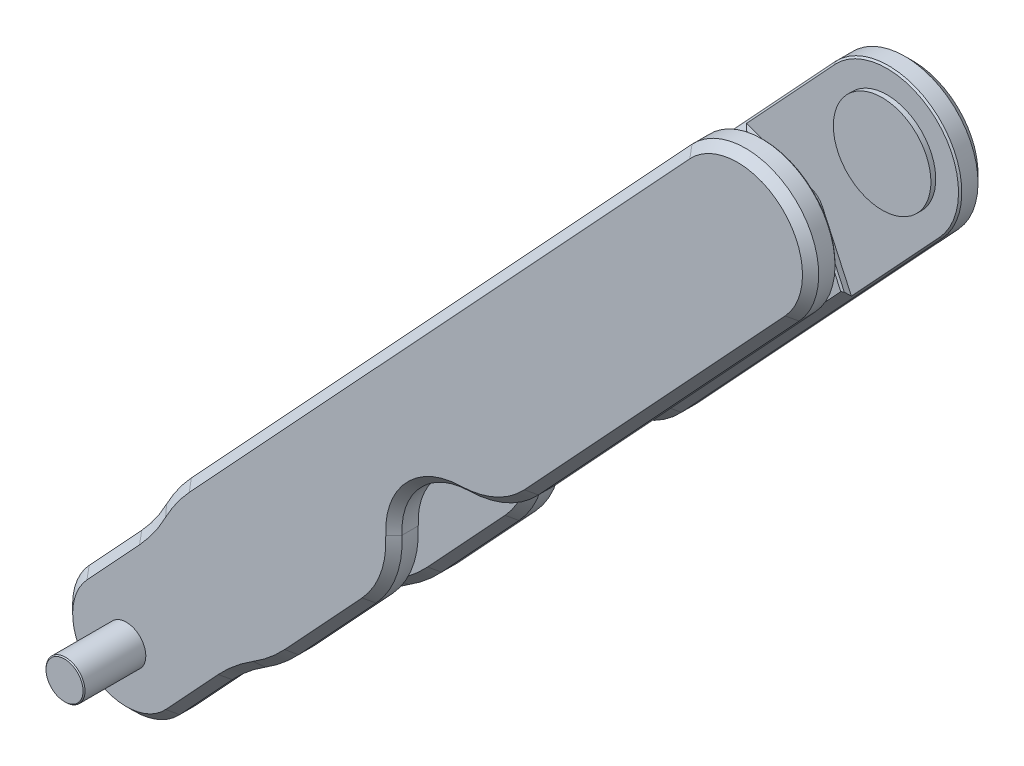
ISO-10303-21;
HEADER;
FILE_DESCRIPTION(('STEP AP214'),'2;1');
FILE_NAME('part.step','',(''),(''),'','','');
FILE_SCHEMA(('AUTOMOTIVE_DESIGN { 1 0 10303 214 1 1 1 1 }'));
ENDSEC;
DATA;
#1=APPLICATION_CONTEXT('core data for automotive mechanical design processes');
#2=APPLICATION_PROTOCOL_DEFINITION('international standard','automotive_design',2000,#1);
#3=PRODUCT_CONTEXT('',#1,'mechanical');
#4=PRODUCT('Part','Part','',(#3));
#5=PRODUCT_RELATED_PRODUCT_CATEGORY('part','',(#4));
#6=PRODUCT_DEFINITION_FORMATION('','',#4);
#7=PRODUCT_DEFINITION_CONTEXT('part definition',#1,'design');
#8=PRODUCT_DEFINITION('design','',#6,#7);
#9=PRODUCT_DEFINITION_SHAPE('','',#8);
#10=(LENGTH_UNIT() NAMED_UNIT(*) SI_UNIT(.MILLI.,.METRE.));
#11=(NAMED_UNIT(*) PLANE_ANGLE_UNIT() SI_UNIT($,.RADIAN.));
#12=(NAMED_UNIT(*) SI_UNIT($,.STERADIAN.) SOLID_ANGLE_UNIT());
#13=UNCERTAINTY_MEASURE_WITH_UNIT(LENGTH_MEASURE(1.E-05),#10,'distance_accuracy_value','');
#14=(GEOMETRIC_REPRESENTATION_CONTEXT(3) GLOBAL_UNCERTAINTY_ASSIGNED_CONTEXT((#13)) GLOBAL_UNIT_ASSIGNED_CONTEXT((#10,
#11,#12)) REPRESENTATION_CONTEXT('',''));
#15=CARTESIAN_POINT('',(0.,0.,0.));
#16=DIRECTION('',(0.,0.,1.));
#17=DIRECTION('',(1.,0.,0.));
#18=AXIS2_PLACEMENT_3D('',#15,#16,#17);
#19=CARTESIAN_POINT('',(247.768962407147,-189.949714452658,19.0000000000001));
#20=DIRECTION('',(0.,0.,-1.));
#21=DIRECTION('',(0.680359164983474,0.732878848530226,0.));
#22=AXIS2_PLACEMENT_3D('',#19,#20,#21);
#23=PLANE('',#22);
#24=DIRECTION('',(0.680359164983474,0.732878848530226,0.));
#25=VECTOR('',#24,1.);
#26=CARTESIAN_POINT('',(231.645627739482,-174.981812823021,19.0000000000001));
#27=LINE('',#26,#25);
#28=CARTESIAN_POINT('',(204.571739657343,-204.145644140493,19.0000000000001));
#29=VERTEX_POINT('',#28);
#30=CARTESIAN_POINT('',(231.645627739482,-174.981812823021,19.0000000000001));
#31=VERTEX_POINT('',#30);
#32=EDGE_CURVE('P0_E635',#29,#31,#27,.T.);
#33=ORIENTED_EDGE('',*,*,#32,.T.);
#34=CARTESIAN_POINT('',(247.768962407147,-189.949714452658,19.0000000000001));
#35=DIRECTION('',(0.,0.,-1.));
#36=DIRECTION('',(0.680359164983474,0.732878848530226,0.));
#37=AXIS2_PLACEMENT_3D('',#34,#35,#36);
#38=CIRCLE('',#37,22.);
#39=CARTESIAN_POINT('',(263.892297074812,-204.917616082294,19.0000000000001));
#40=VERTEX_POINT('',#39);
#41=EDGE_CURVE('P0_E77',#31,#40,#38,.T.);
#42=ORIENTED_EDGE('',*,*,#41,.T.);
#43=DIRECTION('',(-0.680359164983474,-0.732878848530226,0.));
#44=VECTOR('',#43,1.);
#45=CARTESIAN_POINT('',(263.892297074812,-204.917616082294,19.0000000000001));
#46=LINE('',#45,#44);
#47=CARTESIAN_POINT('',(236.818408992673,-234.081447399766,19.0000000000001));
#48=VERTEX_POINT('',#47);
#49=EDGE_CURVE('P0_E632',#40,#48,#46,.T.);
#50=ORIENTED_EDGE('',*,*,#49,.T.);
#51=DIRECTION('',(-0.417707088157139,0.908581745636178,0.));
#52=VECTOR('',#51,1.);
#53=CARTESIAN_POINT('',(221.980131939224,-201.805749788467,19.0000000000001));
#54=LINE('',#53,#52);
#55=CARTESIAN_POINT('',(227.911091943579,-214.706565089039,19.0000000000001));
#56=VERTEX_POINT('',#55);
#57=EDGE_CURVE('P0_E378',#48,#56,#54,.T.);
#58=ORIENTED_EDGE('',*,*,#57,.T.);
#59=CARTESIAN_POINT('',(222.459601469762,-217.212807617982,19.0000000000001));
#60=DIRECTION('',(0.,0.,-1.));
#61=DIRECTION('',(0.680359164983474,0.732878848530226,0.));
#62=AXIS2_PLACEMENT_3D('',#59,#60,#61);
#63=CIRCLE('',#62,6.00000000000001);
#64=CARTESIAN_POINT('',(224.55430602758,-211.590333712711,19.0000000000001));
#65=VERTEX_POINT('',#64);
#66=EDGE_CURVE('P0_E379',#65,#56,#63,.T.);
#67=ORIENTED_EDGE('',*,*,#66,.F.);
#68=DIRECTION('',(0.937078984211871,-0.349117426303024,0.));
#69=VECTOR('',#68,1.);
#70=CARTESIAN_POINT('',(237.859749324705,-216.547399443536,19.0000000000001));
#71=LINE('',#70,#69);
#72=EDGE_CURVE('P0_E366',#29,#65,#71,.T.);
#73=ORIENTED_EDGE('',*,*,#72,.F.);
#74=EDGE_LOOP('',(#33,#42,#50,#58,#67,#73));
#75=FACE_BOUND('',#74,.T.);
#76=ADVANCED_FACE('P0_F67',(#75),#23,.T.);
#77=CARTESIAN_POINT('',(247.768962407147,-189.949714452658,27.0000000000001));
#78=DIRECTION('',(0.,0.,-1.));
#79=DIRECTION('',(0.680359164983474,0.732878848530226,0.));
#80=AXIS2_PLACEMENT_3D('',#77,#78,#79);
#81=CYLINDRICAL_SURFACE('',#80,22.5);
#82=DIRECTION('',(0.,0.,-1.));
#83=VECTOR('',#82,1.);
#84=CARTESIAN_POINT('',(264.258736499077,-205.257795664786,27.0000000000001));
#85=LINE('',#84,#83);
#86=CARTESIAN_POINT('',(264.258736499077,-205.257795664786,24.5000000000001));
#87=VERTEX_POINT('',#86);
#88=CARTESIAN_POINT('',(264.258736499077,-205.257795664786,19.5000000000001));
#89=VERTEX_POINT('',#88);
#90=EDGE_CURVE('P0_E415',#87,#89,#85,.T.);
#91=ORIENTED_EDGE('',*,*,#90,.T.);
#92=CARTESIAN_POINT('',(247.768962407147,-189.949714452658,19.5000000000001));
#93=DIRECTION('',(0.,0.,-1.));
#94=DIRECTION('',(0.680359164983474,0.732878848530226,0.));
#95=AXIS2_PLACEMENT_3D('',#92,#93,#94);
#96=CIRCLE('',#95,22.5);
#97=CARTESIAN_POINT('',(231.279188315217,-174.64163324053,19.5000000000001));
#98=VERTEX_POINT('',#97);
#99=EDGE_CURVE('P0_E13',#89,#98,#96,.F.);
#100=ORIENTED_EDGE('',*,*,#99,.T.);
#101=DIRECTION('',(0.,0.,-1.));
#102=VECTOR('',#101,1.);
#103=CARTESIAN_POINT('',(231.279188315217,-174.64163324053,27.0000000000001));
#104=LINE('',#103,#102);
#105=CARTESIAN_POINT('',(231.279188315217,-174.64163324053,24.5000000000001));
#106=VERTEX_POINT('',#105);
#107=EDGE_CURVE('P0_E412',#106,#98,#104,.T.);
#108=ORIENTED_EDGE('',*,*,#107,.F.);
#109=CARTESIAN_POINT('',(247.768962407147,-189.949714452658,24.5000000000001));
#110=DIRECTION('',(0.,0.,-1.));
#111=DIRECTION('',(0.680359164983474,0.732878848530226,0.));
#112=AXIS2_PLACEMENT_3D('',#109,#110,#111);
#113=CIRCLE('',#112,22.5);
#114=EDGE_CURVE('P0_E580',#106,#87,#113,.T.);
#115=ORIENTED_EDGE('',*,*,#114,.T.);
#116=EDGE_LOOP('',(#91,#100,#108,#115));
#117=FACE_BOUND('',#116,.T.);
#118=ADVANCED_FACE('P0_F882',(#117),#81,.T.);
#119=CARTESIAN_POINT('',(231.279188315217,-174.64163324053,27.0000000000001));
#120=DIRECTION('',(0.732878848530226,-0.680359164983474,0.));
#121=DIRECTION('',(0.,0.,1.));
#122=AXIS2_PLACEMENT_3D('',#119,#120,#121);
#123=PLANE('',#122);
#124=DIRECTION('',(0.,0.,-1.));
#125=VECTOR('',#124,1.);
#126=CARTESIAN_POINT('',(77.2839527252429,-340.52438568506,27.0000000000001));
#127=LINE('',#126,#125);
#128=CARTESIAN_POINT('',(77.2839527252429,-340.52438568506,24.5000000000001));
#129=VERTEX_POINT('',#128);
#130=CARTESIAN_POINT('',(77.2839527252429,-340.52438568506,19.5000000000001));
#131=VERTEX_POINT('',#130);
#132=EDGE_CURVE('P0_E407',#129,#131,#127,.T.);
#133=ORIENTED_EDGE('',*,*,#132,.F.);
#134=DIRECTION('',(0.680359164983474,0.732878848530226,0.));
#135=VECTOR('',#134,1.);
#136=CARTESIAN_POINT('',(231.279188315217,-174.64163324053,24.5000000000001));
#137=LINE('',#136,#135);
#138=EDGE_CURVE('P0_E571',#129,#106,#137,.T.);
#139=ORIENTED_EDGE('',*,*,#138,.T.);
#140=ORIENTED_EDGE('',*,*,#107,.T.);
#141=DIRECTION('',(-0.680359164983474,-0.732878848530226,0.));
#142=VECTOR('',#141,1.);
#143=CARTESIAN_POINT('',(77.2839527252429,-340.52438568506,19.5000000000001));
#144=LINE('',#143,#142);
#145=EDGE_CURVE('P0_E567',#98,#131,#144,.T.);
#146=ORIENTED_EDGE('',*,*,#145,.T.);
#147=EDGE_LOOP('',(#133,#139,#140,#146));
#148=FACE_BOUND('',#147,.T.);
#149=ADVANCED_FACE('P0_F855',(#148),#123,.F.);
#150=CARTESIAN_POINT('',(264.258736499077,-205.257795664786,27.0000000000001));
#151=DIRECTION('',(-0.732878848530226,0.680359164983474,0.));
#152=DIRECTION('',(-0.680359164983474,-0.732878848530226,0.));
#153=AXIS2_PLACEMENT_3D('',#150,#151,#152);
#154=PLANE('',#153);
#155=DIRECTION('',(0.,0.,1.));
#156=VECTOR('',#155,1.);
#157=CARTESIAN_POINT('',(134.100571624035,-345.463397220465,27.0000000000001));
#158=LINE('',#157,#156);
#159=CARTESIAN_POINT('',(134.100571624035,-345.463397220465,19.5000000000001));
#160=VERTEX_POINT('',#159);
#161=CARTESIAN_POINT('',(134.100571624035,-345.463397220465,24.5000000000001));
#162=VERTEX_POINT('',#161);
#163=EDGE_CURVE('P0_E447',#160,#162,#158,.T.);
#164=ORIENTED_EDGE('',*,*,#163,.T.);
#165=DIRECTION('',(-0.680359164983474,-0.732878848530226,0.));
#166=VECTOR('',#165,1.);
#167=CARTESIAN_POINT('',(264.258736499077,-205.257795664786,24.5000000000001));
#168=LINE('',#167,#166);
#169=CARTESIAN_POINT('',(110.263500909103,-371.140548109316,24.5000000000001));
#170=VERTEX_POINT('',#169);
#171=EDGE_CURVE('P0_E540',#162,#170,#168,.T.);
#172=ORIENTED_EDGE('',*,*,#171,.T.);
#173=DIRECTION('',(0.,0.,-1.));
#174=VECTOR('',#173,1.);
#175=CARTESIAN_POINT('',(110.263500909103,-371.140548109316,27.0000000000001));
#176=LINE('',#175,#174);
#177=CARTESIAN_POINT('',(110.263500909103,-371.140548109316,19.5000000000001));
#178=VERTEX_POINT('',#177);
#179=EDGE_CURVE('P0_E419',#170,#178,#176,.T.);
#180=ORIENTED_EDGE('',*,*,#179,.T.);
#181=DIRECTION('',(0.680359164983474,0.732878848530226,0.));
#182=VECTOR('',#181,1.);
#183=CARTESIAN_POINT('',(134.100571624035,-345.463397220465,19.5000000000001));
#184=LINE('',#183,#182);
#185=EDGE_CURVE('P0_E537',#178,#160,#184,.T.);
#186=ORIENTED_EDGE('',*,*,#185,.T.);
#187=EDGE_LOOP('',(#164,#172,#180,#186));
#188=FACE_BOUND('',#187,.T.);
#189=ADVANCED_FACE('P0_F921',(#188),#154,.F.);
#190=CARTESIAN_POINT('',(113.927895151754,-374.542343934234,27.0000000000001));
#191=DIRECTION('',(0.,0.,-1.));
#192=DIRECTION('',(0.680359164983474,0.732878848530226,0.));
#193=AXIS2_PLACEMENT_3D('',#190,#191,#192);
#194=CYLINDRICAL_SURFACE('',#193,50.);
#195=DIRECTION('',(0.,0.,-1.));
#196=VECTOR('',#195,1.);
#197=CARTESIAN_POINT('',(69.6452852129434,-351.3248837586,27.0000000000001));
#198=LINE('',#197,#196);
#199=CARTESIAN_POINT('',(69.6452852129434,-351.3248837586,24.5000000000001));
#200=VERTEX_POINT('',#199);
#201=CARTESIAN_POINT('',(69.6452852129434,-351.3248837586,19.5000000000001));
#202=VERTEX_POINT('',#201);
#203=EDGE_CURVE('P0_E443',#200,#202,#198,.T.);
#204=ORIENTED_EDGE('',*,*,#203,.F.);
#205=CARTESIAN_POINT('',(113.927895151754,-374.542343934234,24.5000000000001));
#206=DIRECTION('',(0.,0.,-1.));
#207=DIRECTION('',(0.680359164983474,0.732878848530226,0.));
#208=AXIS2_PLACEMENT_3D('',#205,#206,#207);
#209=CIRCLE('',#208,50.);
#210=EDGE_CURVE('P0_E558',#200,#129,#209,.T.);
#211=ORIENTED_EDGE('',*,*,#210,.T.);
#212=ORIENTED_EDGE('',*,*,#132,.T.);
#213=CARTESIAN_POINT('',(113.927895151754,-374.542343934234,19.5000000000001));
#214=DIRECTION('',(0.,0.,-1.));
#215=DIRECTION('',(0.680359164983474,0.732878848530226,0.));
#216=AXIS2_PLACEMENT_3D('',#213,#214,#215);
#217=CIRCLE('',#216,50.);
#218=EDGE_CURVE('P0_E555',#131,#202,#217,.F.);
#219=ORIENTED_EDGE('',*,*,#218,.T.);
#220=EDGE_LOOP('',(#204,#211,#212,#219));
#221=FACE_BOUND('',#220,.T.);
#222=ADVANCED_FACE('P0_F859',(#221),#194,.T.);
#223=CARTESIAN_POINT('',(25.3626752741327,-328.107423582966,27.));
#224=DIRECTION('',(0.,0.,-1.));
#225=DIRECTION('',(0.680359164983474,0.732878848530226,0.));
#226=AXIS2_PLACEMENT_3D('',#223,#224,#225);
#227=CYLINDRICAL_SURFACE('',#226,50.);
#228=DIRECTION('',(0.,0.,-1.));
#229=VECTOR('',#228,1.);
#230=CARTESIAN_POINT('',(62.006617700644,-362.12538183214,27.0000000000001));
#231=LINE('',#230,#229);
#232=CARTESIAN_POINT('',(62.006617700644,-362.12538183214,24.5000000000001));
#233=VERTEX_POINT('',#232);
#234=CARTESIAN_POINT('',(62.006617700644,-362.12538183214,19.5000000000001));
#235=VERTEX_POINT('',#234);
#236=EDGE_CURVE('P0_E439',#233,#235,#231,.T.);
#237=ORIENTED_EDGE('',*,*,#236,.F.);
#238=CARTESIAN_POINT('',(25.3626752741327,-328.107423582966,24.5));
#239=DIRECTION('',(0.,0.,-1.));
#240=DIRECTION('',(0.680359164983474,0.732878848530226,0.));
#241=AXIS2_PLACEMENT_3D('',#238,#239,#240);
#242=CIRCLE('',#241,50.);
#243=EDGE_CURVE('P0_E546',#233,#200,#242,.F.);
#244=ORIENTED_EDGE('',*,*,#243,.T.);
#245=ORIENTED_EDGE('',*,*,#203,.T.);
#246=CARTESIAN_POINT('',(25.3626752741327,-328.107423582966,19.5));
#247=DIRECTION('',(0.,0.,-1.));
#248=DIRECTION('',(0.680359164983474,0.732878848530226,0.));
#249=AXIS2_PLACEMENT_3D('',#246,#247,#248);
#250=CIRCLE('',#249,50.);
#251=EDGE_CURVE('P0_E543',#202,#235,#250,.T.);
#252=ORIENTED_EDGE('',*,*,#251,.T.);
#253=EDGE_LOOP('',(#237,#244,#245,#252));
#254=FACE_BOUND('',#253,.T.);
#255=ADVANCED_FACE('P0_F1007',(#254),#227,.F.);
#256=CARTESIAN_POINT('',(45.831070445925,-379.549585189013,27.0000000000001));
#257=DIRECTION('',(0.732878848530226,-0.680359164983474,0.));
#258=DIRECTION('',(0.680359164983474,0.732878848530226,0.));
#259=AXIS2_PLACEMENT_3D('',#256,#257,#258);
#260=PLANE('',#259);
#261=DIRECTION('',(0.,0.,-1.));
#262=VECTOR('',#261,1.);
#263=CARTESIAN_POINT('',(45.831070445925,-379.549585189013,27.0000000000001));
#264=LINE('',#263,#262);
#265=CARTESIAN_POINT('',(45.831070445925,-379.549585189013,24.5));
#266=VERTEX_POINT('',#265);
#267=CARTESIAN_POINT('',(45.831070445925,-379.549585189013,19.5000000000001));
#268=VERTEX_POINT('',#267);
#269=EDGE_CURVE('P0_E435',#266,#268,#264,.T.);
#270=ORIENTED_EDGE('',*,*,#269,.F.);
#271=DIRECTION('',(0.680359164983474,0.732878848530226,0.));
#272=VECTOR('',#271,1.);
#273=CARTESIAN_POINT('',(45.831070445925,-379.549585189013,24.5));
#274=LINE('',#273,#272);
#275=EDGE_CURVE('P0_E534',#266,#233,#274,.T.);
#276=ORIENTED_EDGE('',*,*,#275,.T.);
#277=ORIENTED_EDGE('',*,*,#236,.T.);
#278=DIRECTION('',(-0.680359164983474,-0.732878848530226,0.));
#279=VECTOR('',#278,1.);
#280=CARTESIAN_POINT('',(45.831070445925,-379.549585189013,19.5000000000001));
#281=LINE('',#280,#279);
#282=EDGE_CURVE('P0_E531',#235,#268,#281,.T.);
#283=ORIENTED_EDGE('',*,*,#282,.T.);
#284=EDGE_LOOP('',(#270,#276,#277,#283));
#285=FACE_BOUND('',#284,.T.);
#286=ADVANCED_FACE('P0_F960',(#285),#260,.F.);
#287=CARTESIAN_POINT('',(59.7557685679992,-392.476409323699,27.0000000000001));
#288=DIRECTION('',(0.,0.,-1.));
#289=DIRECTION('',(0.680359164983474,0.732878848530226,0.));
#290=AXIS2_PLACEMENT_3D('',#287,#288,#289);
#291=CYLINDRICAL_SURFACE('',#290,19.);
#292=DIRECTION('',(0.,0.,-1.));
#293=VECTOR('',#292,1.);
#294=CARTESIAN_POINT('',(73.6804666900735,-405.403233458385,27.0000000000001));
#295=LINE('',#294,#293);
#296=CARTESIAN_POINT('',(73.6804666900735,-405.403233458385,24.5000000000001));
#297=VERTEX_POINT('',#296);
#298=CARTESIAN_POINT('',(73.6804666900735,-405.403233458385,19.5000000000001));
#299=VERTEX_POINT('',#298);
#300=EDGE_CURVE('P0_E431',#297,#299,#295,.T.);
#301=ORIENTED_EDGE('',*,*,#300,.F.);
#302=CARTESIAN_POINT('',(59.7557685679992,-392.476409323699,24.5000000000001));
#303=DIRECTION('',(0.,0.,-1.));
#304=DIRECTION('',(0.680359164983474,0.732878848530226,0.));
#305=AXIS2_PLACEMENT_3D('',#302,#303,#304);
#306=CIRCLE('',#305,19.);
#307=EDGE_CURVE('P0_E522',#297,#266,#306,.T.);
#308=ORIENTED_EDGE('',*,*,#307,.T.);
#309=ORIENTED_EDGE('',*,*,#269,.T.);
#310=CARTESIAN_POINT('',(59.7557685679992,-392.476409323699,19.5000000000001));
#311=DIRECTION('',(0.,0.,-1.));
#312=DIRECTION('',(0.680359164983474,0.732878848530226,0.));
#313=AXIS2_PLACEMENT_3D('',#310,#311,#312);
#314=CIRCLE('',#313,19.);
#315=EDGE_CURVE('P0_E519',#268,#299,#314,.F.);
#316=ORIENTED_EDGE('',*,*,#315,.T.);
#317=EDGE_LOOP('',(#301,#308,#309,#316));
#318=FACE_BOUND('',#317,.T.);
#319=ADVANCED_FACE('P0_F957',(#318),#291,.T.);
#320=CARTESIAN_POINT('',(73.6804666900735,-405.403233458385,27.0000000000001));
#321=DIRECTION('',(-0.732878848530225,0.680359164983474,0.));
#322=DIRECTION('',(-0.680359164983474,-0.732878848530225,0.));
#323=AXIS2_PLACEMENT_3D('',#320,#321,#322);
#324=PLANE('',#323);
#325=DIRECTION('',(0.,0.,-1.));
#326=VECTOR('',#325,1.);
#327=CARTESIAN_POINT('',(89.8560139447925,-387.979030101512,27.0000000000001));
#328=LINE('',#327,#326);
#329=CARTESIAN_POINT('',(89.8560139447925,-387.979030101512,24.5000000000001));
#330=VERTEX_POINT('',#329);
#331=CARTESIAN_POINT('',(89.8560139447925,-387.979030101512,19.5000000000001));
#332=VERTEX_POINT('',#331);
#333=EDGE_CURVE('P0_E427',#330,#332,#328,.T.);
#334=ORIENTED_EDGE('',*,*,#333,.F.);
#335=DIRECTION('',(-0.680359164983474,-0.732878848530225,0.));
#336=VECTOR('',#335,1.);
#337=CARTESIAN_POINT('',(73.6804666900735,-405.403233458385,24.5000000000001));
#338=LINE('',#337,#336);
#339=EDGE_CURVE('P0_E509',#330,#297,#338,.T.);
#340=ORIENTED_EDGE('',*,*,#339,.T.);
#341=ORIENTED_EDGE('',*,*,#300,.T.);
#342=DIRECTION('',(0.680359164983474,0.732878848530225,0.));
#343=VECTOR('',#342,1.);
#344=CARTESIAN_POINT('',(89.8560139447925,-387.979030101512,19.5000000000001));
#345=LINE('',#344,#343);
#346=EDGE_CURVE('P0_E506',#299,#332,#345,.T.);
#347=ORIENTED_EDGE('',*,*,#346,.T.);
#348=EDGE_LOOP('',(#334,#340,#341,#347));
#349=FACE_BOUND('',#348,.T.);
#350=ADVANCED_FACE('P0_F945',(#349),#324,.F.);
#351=CARTESIAN_POINT('',(126.499956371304,-421.996988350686,27.0000000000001));
#352=DIRECTION('',(0.,0.,-1.));
#353=DIRECTION('',(0.680359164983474,0.732878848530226,0.));
#354=AXIS2_PLACEMENT_3D('',#351,#352,#353);
#355=CYLINDRICAL_SURFACE('',#354,50.);
#356=DIRECTION('',(0.,0.,-1.));
#357=VECTOR('',#356,1.);
#358=CARTESIAN_POINT('',(100.059757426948,-379.559789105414,27.0000000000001));
#359=LINE('',#358,#357);
#360=CARTESIAN_POINT('',(100.059757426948,-379.559789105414,24.5000000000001));
#361=VERTEX_POINT('',#360);
#362=CARTESIAN_POINT('',(100.059757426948,-379.559789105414,19.5000000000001));
#363=VERTEX_POINT('',#362);
#364=EDGE_CURVE('P0_E423',#361,#363,#359,.T.);
#365=ORIENTED_EDGE('',*,*,#364,.F.);
#366=CARTESIAN_POINT('',(126.499956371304,-421.996988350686,24.5000000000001));
#367=DIRECTION('',(0.,0.,-1.));
#368=DIRECTION('',(0.680359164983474,0.732878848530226,0.));
#369=AXIS2_PLACEMENT_3D('',#366,#367,#368);
#370=CIRCLE('',#369,50.);
#371=EDGE_CURVE('P0_E516',#361,#330,#370,.F.);
#372=ORIENTED_EDGE('',*,*,#371,.T.);
#373=ORIENTED_EDGE('',*,*,#333,.T.);
#374=CARTESIAN_POINT('',(126.499956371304,-421.996988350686,19.5000000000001));
#375=DIRECTION('',(0.,0.,-1.));
#376=DIRECTION('',(0.680359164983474,0.732878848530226,0.));
#377=AXIS2_PLACEMENT_3D('',#374,#375,#376);
#378=CIRCLE('',#377,50.);
#379=EDGE_CURVE('P0_E513',#332,#363,#378,.T.);
#380=ORIENTED_EDGE('',*,*,#379,.T.);
#381=EDGE_LOOP('',(#365,#372,#373,#380));
#382=FACE_BOUND('',#381,.T.);
#383=ADVANCED_FACE('P0_F942',(#382),#355,.F.);
#384=CARTESIAN_POINT('',(73.6195584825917,-337.122589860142,27.0000000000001));
#385=DIRECTION('',(0.,0.,-1.));
#386=DIRECTION('',(0.680359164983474,0.732878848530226,0.));
#387=AXIS2_PLACEMENT_3D('',#384,#385,#386);
#388=CYLINDRICAL_SURFACE('',#387,50.);
#389=ORIENTED_EDGE('',*,*,#179,.F.);
#390=CARTESIAN_POINT('',(73.6195584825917,-337.122589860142,24.5000000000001));
#391=DIRECTION('',(0.,0.,-1.));
#392=DIRECTION('',(0.680359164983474,0.732878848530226,0.));
#393=AXIS2_PLACEMENT_3D('',#390,#391,#392);
#394=CIRCLE('',#393,50.);
#395=EDGE_CURVE('P0_E528',#170,#361,#394,.T.);
#396=ORIENTED_EDGE('',*,*,#395,.T.);
#397=ORIENTED_EDGE('',*,*,#364,.T.);
#398=CARTESIAN_POINT('',(73.6195584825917,-337.122589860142,19.5000000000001));
#399=DIRECTION('',(0.,0.,-1.));
#400=DIRECTION('',(0.680359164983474,0.732878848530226,0.));
#401=AXIS2_PLACEMENT_3D('',#398,#399,#400);
#402=CIRCLE('',#401,50.);
#403=EDGE_CURVE('P0_E525',#363,#178,#402,.F.);
#404=ORIENTED_EDGE('',*,*,#403,.T.);
#405=EDGE_LOOP('',(#389,#396,#397,#404));
#406=FACE_BOUND('',#405,.T.);
#407=ADVANCED_FACE('P0_F925',(#406),#388,.T.);
#408=ORIENTED_EDGE('',*,*,#90,.F.);
#409=DIRECTION('',(-0.680359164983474,-0.732878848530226,0.));
#410=VECTOR('',#409,1.);
#411=CARTESIAN_POINT('',(264.258736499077,-205.257795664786,24.5000000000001));
#412=LINE('',#411,#410);
#413=CARTESIAN_POINT('',(184.0171488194,-291.693556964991,24.5000000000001));
#414=VERTEX_POINT('',#413);
#415=EDGE_CURVE('P0_E587',#87,#414,#412,.T.);
#416=ORIENTED_EDGE('',*,*,#415,.T.);
#417=DIRECTION('',(0.,0.,1.));
#418=VECTOR('',#417,1.);
#419=CARTESIAN_POINT('',(184.0171488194,-291.693556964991,27.0000000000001));
#420=LINE('',#419,#418);
#421=CARTESIAN_POINT('',(184.0171488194,-291.693556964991,19.5000000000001));
#422=VERTEX_POINT('',#421);
#423=EDGE_CURVE('P0_E459',#414,#422,#420,.F.);
#424=ORIENTED_EDGE('',*,*,#423,.T.);
#425=DIRECTION('',(0.680359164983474,0.732878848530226,0.));
#426=VECTOR('',#425,1.);
#427=CARTESIAN_POINT('',(237.044369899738,-234.572949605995,19.5000000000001));
#428=LINE('',#427,#426);
#429=EDGE_CURVE('P0_E583',#422,#89,#428,.T.);
#430=ORIENTED_EDGE('',*,*,#429,.T.);
#431=EDGE_LOOP('',(#408,#416,#424,#430));
#432=FACE_BOUND('',#431,.T.);
#433=ADVANCED_FACE('P0_F895',(#432),#154,.F.);
#434=CARTESIAN_POINT('',(113.927895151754,-374.542343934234,27.0000000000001));
#435=DIRECTION('',(0.,0.,-1.));
#436=DIRECTION('',(0.680359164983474,0.732878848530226,0.));
#437=AXIS2_PLACEMENT_3D('',#434,#435,#436);
#438=PLANE('',#437);
#439=CARTESIAN_POINT('',(59.7557685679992,-392.476409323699,27.0000000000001));
#440=DIRECTION('',(0.,0.,-1.));
#441=DIRECTION('',(0.680359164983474,0.732878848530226,0.));
#442=AXIS2_PLACEMENT_3D('',#439,#440,#441);
#443=CIRCLE('',#442,16.5);
#444=CARTESIAN_POINT('',(47.6632675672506,-381.250483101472,27.0000000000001));
#445=VERTEX_POINT('',#444);
#446=CARTESIAN_POINT('',(71.848269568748,-403.702335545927,27.0000000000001));
#447=VERTEX_POINT('',#446);
#448=EDGE_CURVE('P0_E496',#445,#447,#443,.F.);
#449=ORIENTED_EDGE('',*,*,#448,.T.);
#450=DIRECTION('',(0.680359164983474,0.732878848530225,0.));
#451=VECTOR('',#450,1.);
#452=CARTESIAN_POINT('',(105.866227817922,-367.058393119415,27.0000000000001));
#453=LINE('',#452,#451);
#454=CARTESIAN_POINT('',(88.0238168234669,-386.278132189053,27.0000000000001));
#455=VERTEX_POINT('',#454);
#456=EDGE_CURVE('P0_E502',#447,#455,#453,.T.);
#457=ORIENTED_EDGE('',*,*,#456,.T.);
#458=CARTESIAN_POINT('',(126.499956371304,-421.996988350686,27.0000000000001));
#459=DIRECTION('',(0.,0.,-1.));
#460=DIRECTION('',(0.680359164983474,0.732878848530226,0.));
#461=AXIS2_PLACEMENT_3D('',#458,#459,#460);
#462=CIRCLE('',#461,52.5);
#463=CARTESIAN_POINT('',(98.73774747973,-377.43792914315,27.0000000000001));
#464=VERTEX_POINT('',#463);
#465=EDGE_CURVE('P0_E499',#455,#464,#462,.T.);
#466=ORIENTED_EDGE('',*,*,#465,.T.);
#467=CARTESIAN_POINT('',(73.6195584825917,-337.122589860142,27.0000000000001));
#468=DIRECTION('',(0.,0.,-1.));
#469=DIRECTION('',(0.680359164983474,0.732878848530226,0.));
#470=AXIS2_PLACEMENT_3D('',#467,#468,#469);
#471=CIRCLE('',#470,47.5);
#472=CARTESIAN_POINT('',(108.431303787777,-369.439650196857,27.0000000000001));
#473=VERTEX_POINT('',#472);
#474=EDGE_CURVE('P0_E493',#464,#473,#471,.F.);
#475=ORIENTED_EDGE('',*,*,#474,.T.);
#476=DIRECTION('',(0.680359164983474,0.732878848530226,0.));
#477=VECTOR('',#476,1.);
#478=CARTESIAN_POINT('',(108.431303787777,-369.439650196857,27.0000000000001));
#479=LINE('',#478,#477);
#480=CARTESIAN_POINT('',(132.26837450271,-343.762499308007,27.0000000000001));
#481=VERTEX_POINT('',#480);
#482=EDGE_CURVE('P0_E487',#473,#481,#479,.T.);
#483=ORIENTED_EDGE('',*,*,#482,.T.);
#484=CARTESIAN_POINT('',(112.114206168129,-325.052622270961,27.0000000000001));
#485=DIRECTION('',(0.,0.,-1.));
#486=DIRECTION('',(0.680359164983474,0.732878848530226,0.));
#487=AXIS2_PLACEMENT_3D('',#484,#485,#486);
#488=CIRCLE('',#487,27.5);
#489=CARTESIAN_POINT('',(139.57332617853,-323.553713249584,27.0000000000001));
#490=VERTEX_POINT('',#489);
#491=EDGE_CURVE('P0_E481',#481,#490,#488,.F.);
#492=ORIENTED_EDGE('',*,*,#491,.T.);
#493=CARTESIAN_POINT('',(163.038392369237,-322.272827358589,27.0000000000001));
#494=DIRECTION('',(0.,0.,-1.));
#495=DIRECTION('',(0.680359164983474,0.732878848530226,0.));
#496=AXIS2_PLACEMENT_3D('',#493,#494,#495);
#497=CIRCLE('',#496,23.5);
#498=CARTESIAN_POINT('',(162.574101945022,-298.777414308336,27.0000000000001));
#499=VERTEX_POINT('',#498);
#500=EDGE_CURVE('P0_E475',#490,#499,#497,.T.);
#501=ORIENTED_EDGE('',*,*,#500,.T.);
#502=CARTESIAN_POINT('',(162.030783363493,-271.282782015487,27.0000000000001));
#503=DIRECTION('',(0.,0.,-1.));
#504=DIRECTION('',(0.680359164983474,0.732878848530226,0.));
#505=AXIS2_PLACEMENT_3D('',#502,#503,#504);
#506=CIRCLE('',#505,27.5);
#507=CARTESIAN_POINT('',(182.184951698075,-289.992659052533,27.0000000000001));
#508=VERTEX_POINT('',#507);
#509=EDGE_CURVE('P0_E469',#499,#508,#506,.F.);
#510=ORIENTED_EDGE('',*,*,#509,.T.);
#511=DIRECTION('',(0.680359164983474,0.732878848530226,0.));
#512=VECTOR('',#511,1.);
#513=CARTESIAN_POINT('',(108.431303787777,-369.439650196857,27.0000000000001));
#514=LINE('',#513,#512);
#515=CARTESIAN_POINT('',(262.426539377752,-203.556897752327,27.0000000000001));
#516=VERTEX_POINT('',#515);
#517=EDGE_CURVE('P0_E463',#508,#516,#514,.T.);
#518=ORIENTED_EDGE('',*,*,#517,.T.);
#519=CARTESIAN_POINT('',(247.768962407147,-189.949714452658,27.0000000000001));
#520=DIRECTION('',(0.,0.,-1.));
#521=DIRECTION('',(0.680359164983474,0.732878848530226,0.));
#522=AXIS2_PLACEMENT_3D('',#519,#520,#521);
#523=CIRCLE('',#522,20.);
#524=CARTESIAN_POINT('',(233.111385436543,-176.342531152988,27.0000000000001));
#525=VERTEX_POINT('',#524);
#526=EDGE_CURVE('P0_E466',#516,#525,#523,.F.);
#527=ORIENTED_EDGE('',*,*,#526,.T.);
#528=DIRECTION('',(-0.680359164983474,-0.732878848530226,0.));
#529=VECTOR('',#528,1.);
#530=CARTESIAN_POINT('',(79.1161498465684,-342.225283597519,27.0000000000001));
#531=LINE('',#530,#529);
#532=CARTESIAN_POINT('',(79.1161498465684,-342.225283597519,27.0000000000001));
#533=VERTEX_POINT('',#532);
#534=EDGE_CURVE('P0_E472',#525,#533,#531,.T.);
#535=ORIENTED_EDGE('',*,*,#534,.T.);
#536=CARTESIAN_POINT('',(113.927895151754,-374.542343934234,27.0000000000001));
#537=DIRECTION('',(0.,0.,-1.));
#538=DIRECTION('',(0.680359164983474,0.732878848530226,0.));
#539=AXIS2_PLACEMENT_3D('',#536,#537,#538);
#540=CIRCLE('',#539,47.5);
#541=CARTESIAN_POINT('',(71.859415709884,-352.485756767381,27.0000000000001));
#542=VERTEX_POINT('',#541);
#543=EDGE_CURVE('P0_E478',#533,#542,#540,.F.);
#544=ORIENTED_EDGE('',*,*,#543,.T.);
#545=CARTESIAN_POINT('',(25.3626752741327,-328.107423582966,27.));
#546=DIRECTION('',(0.,0.,-1.));
#547=DIRECTION('',(0.680359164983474,0.732878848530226,0.));
#548=AXIS2_PLACEMENT_3D('',#545,#546,#547);
#549=CIRCLE('',#548,52.5);
#550=CARTESIAN_POINT('',(63.8388148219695,-363.826279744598,27.0000000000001));
#551=VERTEX_POINT('',#550);
#552=EDGE_CURVE('P0_E484',#542,#551,#549,.T.);
#553=ORIENTED_EDGE('',*,*,#552,.T.);
#554=DIRECTION('',(-0.680359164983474,-0.732878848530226,0.));
#555=VECTOR('',#554,1.);
#556=CARTESIAN_POINT('',(81.6812258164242,-344.606540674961,27.0000000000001));
#557=LINE('',#556,#555);
#558=EDGE_CURVE('P0_E490',#551,#445,#557,.T.);
#559=ORIENTED_EDGE('',*,*,#558,.T.);
#560=EDGE_LOOP('',(#449,#457,#466,#475,#483,#492,#501,#510,#518,#527,#535,#544,#553,#559));
#561=FACE_BOUND('',#560,.T.);
#562=ADVANCED_FACE('P0_F873',(#561),#438,.F.);
#563=CARTESIAN_POINT('',(113.927895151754,-374.542343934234,17.0000000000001));
#564=DIRECTION('',(0.,0.,-1.));
#565=DIRECTION('',(0.680359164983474,0.732878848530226,0.));
#566=AXIS2_PLACEMENT_3D('',#563,#564,#565);
#567=PLANE('',#566);
#568=DIRECTION('',(0.680359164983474,0.732878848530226,0.));
#569=VECTOR('',#568,1.);
#570=CARTESIAN_POINT('',(205.897018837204,-205.657685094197,17.0000000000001));
#571=LINE('',#570,#569);
#572=CARTESIAN_POINT('',(79.1161498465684,-342.225283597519,17.0000000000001));
#573=VERTEX_POINT('',#572);
#574=CARTESIAN_POINT('',(206.231367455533,-205.297526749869,17.0000000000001));
#575=VERTEX_POINT('',#574);
#576=EDGE_CURVE('P0_E626',#573,#575,#571,.T.);
#577=ORIENTED_EDGE('',*,*,#576,.T.);
#578=DIRECTION('',(0.937078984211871,-0.349117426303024,0.));
#579=VECTOR('',#578,1.);
#580=CARTESIAN_POINT('',(180.546661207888,-195.728452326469,17.0000000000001));
#581=LINE('',#580,#579);
#582=CARTESIAN_POINT('',(224.379747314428,-212.058873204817,17.0000000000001));
#583=VERTEX_POINT('',#582);
#584=EDGE_CURVE('P0_E743',#575,#583,#581,.T.);
#585=ORIENTED_EDGE('',*,*,#584,.T.);
#586=CARTESIAN_POINT('',(222.459601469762,-217.212807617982,17.0000000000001));
#587=DIRECTION('',(0.,0.,-1.));
#588=DIRECTION('',(0.680359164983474,0.732878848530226,0.));
#589=AXIS2_PLACEMENT_3D('',#586,#587,#588);
#590=CIRCLE('',#589,5.50000000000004);
#591=CARTESIAN_POINT('',(227.456801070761,-214.915418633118,17.0000000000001));
#592=VERTEX_POINT('',#591);
#593=EDGE_CURVE('P0_E740',#583,#592,#590,.T.);
#594=ORIENTED_EDGE('',*,*,#593,.T.);
#595=DIRECTION('',(0.417707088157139,-0.908581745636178,0.));
#596=VECTOR('',#595,1.);
#597=CARTESIAN_POINT('',(235.460274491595,-232.324292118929,17.0000000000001));
#598=LINE('',#597,#596);
#599=CARTESIAN_POINT('',(235.546521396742,-232.511893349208,17.0000000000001));
#600=VERTEX_POINT('',#599);
#601=EDGE_CURVE('P0_E641',#592,#600,#598,.T.);
#602=ORIENTED_EDGE('',*,*,#601,.T.);
#603=DIRECTION('',(-0.680359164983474,-0.732878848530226,0.));
#604=VECTOR('',#603,1.);
#605=CARTESIAN_POINT('',(182.184951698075,-289.992659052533,17.0000000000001));
#606=LINE('',#605,#604);
#607=CARTESIAN_POINT('',(182.184951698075,-289.992659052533,17.0000000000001));
#608=VERTEX_POINT('',#607);
#609=EDGE_CURVE('P0_E590',#600,#608,#606,.T.);
#610=ORIENTED_EDGE('',*,*,#609,.T.);
#611=CARTESIAN_POINT('',(162.030783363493,-271.282782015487,17.0000000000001));
#612=DIRECTION('',(0.,0.,-1.));
#613=DIRECTION('',(0.680359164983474,0.732878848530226,0.));
#614=AXIS2_PLACEMENT_3D('',#611,#612,#613);
#615=CIRCLE('',#614,27.5);
#616=CARTESIAN_POINT('',(162.574101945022,-298.777414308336,17.0000000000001));
#617=VERTEX_POINT('',#616);
#618=EDGE_CURVE('P0_E593',#608,#617,#615,.T.);
#619=ORIENTED_EDGE('',*,*,#618,.T.);
#620=CARTESIAN_POINT('',(163.038392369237,-322.272827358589,17.0000000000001));
#621=DIRECTION('',(0.,0.,-1.));
#622=DIRECTION('',(0.680359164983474,0.732878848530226,0.));
#623=AXIS2_PLACEMENT_3D('',#620,#621,#622);
#624=CIRCLE('',#623,23.5);
#625=CARTESIAN_POINT('',(139.57332617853,-323.553713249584,17.0000000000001));
#626=VERTEX_POINT('',#625);
#627=EDGE_CURVE('P0_E596',#617,#626,#624,.F.);
#628=ORIENTED_EDGE('',*,*,#627,.T.);
#629=CARTESIAN_POINT('',(112.114206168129,-325.052622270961,17.0000000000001));
#630=DIRECTION('',(0.,0.,-1.));
#631=DIRECTION('',(0.680359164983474,0.732878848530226,0.));
#632=AXIS2_PLACEMENT_3D('',#629,#630,#631);
#633=CIRCLE('',#632,27.5);
#634=CARTESIAN_POINT('',(132.26837450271,-343.762499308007,17.0000000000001));
#635=VERTEX_POINT('',#634);
#636=EDGE_CURVE('P0_E599',#626,#635,#633,.T.);
#637=ORIENTED_EDGE('',*,*,#636,.T.);
#638=DIRECTION('',(-0.680359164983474,-0.732878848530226,0.));
#639=VECTOR('',#638,1.);
#640=CARTESIAN_POINT('',(108.431303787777,-369.439650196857,17.0000000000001));
#641=LINE('',#640,#639);
#642=CARTESIAN_POINT('',(108.431303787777,-369.439650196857,17.0000000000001));
#643=VERTEX_POINT('',#642);
#644=EDGE_CURVE('P0_E602',#635,#643,#641,.T.);
#645=ORIENTED_EDGE('',*,*,#644,.T.);
#646=CARTESIAN_POINT('',(73.6195584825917,-337.122589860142,17.0000000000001));
#647=DIRECTION('',(0.,0.,-1.));
#648=DIRECTION('',(0.680359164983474,0.732878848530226,0.));
#649=AXIS2_PLACEMENT_3D('',#646,#647,#648);
#650=CIRCLE('',#649,47.5);
#651=CARTESIAN_POINT('',(98.73774747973,-377.43792914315,17.0000000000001));
#652=VERTEX_POINT('',#651);
#653=EDGE_CURVE('P0_E605',#643,#652,#650,.T.);
#654=ORIENTED_EDGE('',*,*,#653,.T.);
#655=CARTESIAN_POINT('',(126.499956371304,-421.996988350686,17.0000000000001));
#656=DIRECTION('',(0.,0.,-1.));
#657=DIRECTION('',(0.680359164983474,0.732878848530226,0.));
#658=AXIS2_PLACEMENT_3D('',#655,#656,#657);
#659=CIRCLE('',#658,52.5);
#660=CARTESIAN_POINT('',(88.0238168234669,-386.278132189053,17.0000000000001));
#661=VERTEX_POINT('',#660);
#662=EDGE_CURVE('P0_E608',#652,#661,#659,.F.);
#663=ORIENTED_EDGE('',*,*,#662,.T.);
#664=DIRECTION('',(-0.680359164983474,-0.732878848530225,0.));
#665=VECTOR('',#664,1.);
#666=CARTESIAN_POINT('',(71.848269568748,-403.702335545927,17.0000000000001));
#667=LINE('',#666,#665);
#668=CARTESIAN_POINT('',(71.848269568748,-403.702335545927,17.0000000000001));
#669=VERTEX_POINT('',#668);
#670=EDGE_CURVE('P0_E611',#661,#669,#667,.T.);
#671=ORIENTED_EDGE('',*,*,#670,.T.);
#672=CARTESIAN_POINT('',(59.7557685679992,-392.476409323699,17.0000000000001));
#673=DIRECTION('',(0.,0.,-1.));
#674=DIRECTION('',(0.680359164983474,0.732878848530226,0.));
#675=AXIS2_PLACEMENT_3D('',#672,#673,#674);
#676=CIRCLE('',#675,16.5);
#677=CARTESIAN_POINT('',(47.6632675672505,-381.250483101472,17.0000000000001));
#678=VERTEX_POINT('',#677);
#679=EDGE_CURVE('P0_E614',#669,#678,#676,.T.);
#680=ORIENTED_EDGE('',*,*,#679,.T.);
#681=DIRECTION('',(0.680359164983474,0.732878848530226,0.));
#682=VECTOR('',#681,1.);
#683=CARTESIAN_POINT('',(63.8388148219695,-363.826279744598,17.0000000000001));
#684=LINE('',#683,#682);
#685=CARTESIAN_POINT('',(63.8388148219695,-363.826279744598,17.0000000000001));
#686=VERTEX_POINT('',#685);
#687=EDGE_CURVE('P0_E617',#678,#686,#684,.T.);
#688=ORIENTED_EDGE('',*,*,#687,.T.);
#689=CARTESIAN_POINT('',(25.3626752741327,-328.107423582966,17.));
#690=DIRECTION('',(0.,0.,-1.));
#691=DIRECTION('',(0.680359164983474,0.732878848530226,0.));
#692=AXIS2_PLACEMENT_3D('',#689,#690,#691);
#693=CIRCLE('',#692,52.5);
#694=CARTESIAN_POINT('',(71.859415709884,-352.485756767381,17.0000000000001));
#695=VERTEX_POINT('',#694);
#696=EDGE_CURVE('P0_E620',#686,#695,#693,.F.);
#697=ORIENTED_EDGE('',*,*,#696,.T.);
#698=CARTESIAN_POINT('',(113.927895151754,-374.542343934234,17.0000000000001));
#699=DIRECTION('',(0.,0.,-1.));
#700=DIRECTION('',(0.680359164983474,0.732878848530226,0.));
#701=AXIS2_PLACEMENT_3D('',#698,#699,#700);
#702=CIRCLE('',#701,47.5);
#703=EDGE_CURVE('P0_E623',#695,#573,#702,.T.);
#704=ORIENTED_EDGE('',*,*,#703,.T.);
#705=EDGE_LOOP('',(#577,#585,#594,#602,#610,#619,#628,#637,#645,#654,#663,#671,#680,#688,#697,#704));
#706=FACE_BOUND('',#705,.T.);
#707=ADVANCED_FACE('P0_F787',(#706),#567,.T.);
#708=CARTESIAN_POINT('',(163.038392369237,-322.272827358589,17.0000000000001));
#709=DIRECTION('',(0.,0.,1.));
#710=DIRECTION('',(-0.680359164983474,-0.732878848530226,0.));
#711=AXIS2_PLACEMENT_3D('',#708,#709,#710);
#712=CYLINDRICAL_SURFACE('',#711,21.);
#713=DIRECTION('',(0.,0.,1.));
#714=VECTOR('',#713,1.);
#715=CARTESIAN_POINT('',(162.623494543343,-301.276926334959,17.0000000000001));
#716=LINE('',#715,#714);
#717=CARTESIAN_POINT('',(162.623494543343,-301.276926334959,19.5000000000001));
#718=VERTEX_POINT('',#717);
#719=CARTESIAN_POINT('',(162.623494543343,-301.276926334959,24.5000000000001));
#720=VERTEX_POINT('',#719);
#721=EDGE_CURVE('P0_E451',#718,#720,#716,.T.);
#722=ORIENTED_EDGE('',*,*,#721,.T.);
#723=CARTESIAN_POINT('',(163.038392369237,-322.272827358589,24.5000000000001));
#724=DIRECTION('',(0.,0.,-1.));
#725=DIRECTION('',(0.680359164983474,0.732878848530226,0.));
#726=AXIS2_PLACEMENT_3D('',#723,#724,#725);
#727=CIRCLE('',#726,21.);
#728=CARTESIAN_POINT('',(142.069609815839,-323.417448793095,24.5000000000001));
#729=VERTEX_POINT('',#728);
#730=EDGE_CURVE('P0_E564',#720,#729,#727,.F.);
#731=ORIENTED_EDGE('',*,*,#730,.T.);
#732=DIRECTION('',(0.,0.,1.));
#733=VECTOR('',#732,1.);
#734=CARTESIAN_POINT('',(142.069609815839,-323.417448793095,17.0000000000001));
#735=LINE('',#734,#733);
#736=CARTESIAN_POINT('',(142.069609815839,-323.417448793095,19.5000000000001));
#737=VERTEX_POINT('',#736);
#738=EDGE_CURVE('P0_E455',#729,#737,#735,.F.);
#739=ORIENTED_EDGE('',*,*,#738,.T.);
#740=CARTESIAN_POINT('',(163.038392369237,-322.272827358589,19.5000000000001));
#741=DIRECTION('',(0.,0.,-1.));
#742=DIRECTION('',(0.680359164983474,0.732878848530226,0.));
#743=AXIS2_PLACEMENT_3D('',#740,#741,#742);
#744=CIRCLE('',#743,21.);
#745=EDGE_CURVE('P0_E561',#737,#718,#744,.T.);
#746=ORIENTED_EDGE('',*,*,#745,.T.);
#747=EDGE_LOOP('',(#722,#731,#739,#746));
#748=FACE_BOUND('',#747,.T.);
#749=ADVANCED_FACE('P0_F901',(#748),#712,.F.);
#750=CARTESIAN_POINT('',(112.114206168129,-325.052622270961,17.0000000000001));
#751=DIRECTION('',(0.,0.,1.));
#752=DIRECTION('',(-0.680359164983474,-0.732878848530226,0.));
#753=AXIS2_PLACEMENT_3D('',#750,#751,#752);
#754=CYLINDRICAL_SURFACE('',#753,30.);
#755=ORIENTED_EDGE('',*,*,#738,.F.);
#756=CARTESIAN_POINT('',(112.114206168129,-325.052622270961,24.5000000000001));
#757=DIRECTION('',(0.,0.,-1.));
#758=DIRECTION('',(0.680359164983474,0.732878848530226,0.));
#759=AXIS2_PLACEMENT_3D('',#756,#757,#758);
#760=CIRCLE('',#759,30.);
#761=EDGE_CURVE('P0_E552',#729,#162,#760,.T.);
#762=ORIENTED_EDGE('',*,*,#761,.T.);
#763=ORIENTED_EDGE('',*,*,#163,.F.);
#764=CARTESIAN_POINT('',(112.114206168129,-325.052622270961,19.5000000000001));
#765=DIRECTION('',(0.,0.,-1.));
#766=DIRECTION('',(0.680359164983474,0.732878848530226,0.));
#767=AXIS2_PLACEMENT_3D('',#764,#765,#766);
#768=CIRCLE('',#767,30.);
#769=EDGE_CURVE('P0_E549',#160,#737,#768,.F.);
#770=ORIENTED_EDGE('',*,*,#769,.T.);
#771=EDGE_LOOP('',(#755,#762,#763,#770));
#772=FACE_BOUND('',#771,.T.);
#773=ADVANCED_FACE('P0_F919',(#772),#754,.T.);
#774=CARTESIAN_POINT('',(162.030783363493,-271.282782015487,17.0000000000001));
#775=DIRECTION('',(0.,0.,1.));
#776=DIRECTION('',(-0.680359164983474,-0.732878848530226,0.));
#777=AXIS2_PLACEMENT_3D('',#774,#775,#776);
#778=CYLINDRICAL_SURFACE('',#777,30.);
#779=ORIENTED_EDGE('',*,*,#423,.F.);
#780=CARTESIAN_POINT('',(162.030783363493,-271.282782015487,24.5000000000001));
#781=DIRECTION('',(0.,0.,-1.));
#782=DIRECTION('',(0.680359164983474,0.732878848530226,0.));
#783=AXIS2_PLACEMENT_3D('',#780,#781,#782);
#784=CIRCLE('',#783,30.);
#785=EDGE_CURVE('P0_E577',#414,#720,#784,.T.);
#786=ORIENTED_EDGE('',*,*,#785,.T.);
#787=ORIENTED_EDGE('',*,*,#721,.F.);
#788=CARTESIAN_POINT('',(162.030783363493,-271.282782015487,19.5000000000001));
#789=DIRECTION('',(0.,0.,-1.));
#790=DIRECTION('',(0.680359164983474,0.732878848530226,0.));
#791=AXIS2_PLACEMENT_3D('',#788,#789,#790);
#792=CIRCLE('',#791,30.);
#793=EDGE_CURVE('P0_E574',#718,#422,#792,.F.);
#794=ORIENTED_EDGE('',*,*,#793,.T.);
#795=EDGE_LOOP('',(#779,#786,#787,#794));
#796=FACE_BOUND('',#795,.T.);
#797=ADVANCED_FACE('P0_F897',(#796),#778,.T.);
#798=CARTESIAN_POINT('',(222.459601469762,-217.212807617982,19.0000000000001));
#799=DIRECTION('',(0.,0.,-1.));
#800=DIRECTION('',(0.680359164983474,0.732878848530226,0.));
#801=AXIS2_PLACEMENT_3D('',#798,#799,#800);
#802=CYLINDRICAL_SURFACE('',#801,6.00000000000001);
#803=DIRECTION('',(0.,0.,-1.));
#804=VECTOR('',#803,1.);
#805=CARTESIAN_POINT('',(227.911091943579,-214.706565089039,19.0000000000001));
#806=LINE('',#805,#804);
#807=CARTESIAN_POINT('',(227.911091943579,-214.706565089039,17.5000000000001));
#808=VERTEX_POINT('',#807);
#809=EDGE_CURVE('P0_E389',#56,#808,#806,.T.);
#810=ORIENTED_EDGE('',*,*,#809,.T.);
#811=CARTESIAN_POINT('',(222.459601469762,-217.212807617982,17.5000000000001));
#812=DIRECTION('',(0.,0.,-1.));
#813=DIRECTION('',(0.680359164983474,0.732878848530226,0.));
#814=AXIS2_PLACEMENT_3D('',#811,#812,#813);
#815=CIRCLE('',#814,6.00000000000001);
#816=CARTESIAN_POINT('',(224.55430602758,-211.590333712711,17.5000000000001));
#817=VERTEX_POINT('',#816);
#818=EDGE_CURVE('P0_E387',#808,#817,#815,.F.);
#819=ORIENTED_EDGE('',*,*,#818,.T.);
#820=DIRECTION('',(0.,0.,-1.));
#821=VECTOR('',#820,1.);
#822=CARTESIAN_POINT('',(224.55430602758,-211.590333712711,19.0000000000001));
#823=LINE('',#822,#821);
#824=EDGE_CURVE('P0_E369',#65,#817,#823,.T.);
#825=ORIENTED_EDGE('',*,*,#824,.F.);
#826=ORIENTED_EDGE('',*,*,#66,.T.);
#827=EDGE_LOOP('',(#810,#819,#825,#826));
#828=FACE_BOUND('',#827,.T.);
#829=ADVANCED_FACE('P0_F384',(#828),#802,.T.);
#830=CARTESIAN_POINT('',(221.980131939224,-201.805749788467,19.0000000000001));
#831=DIRECTION('',(-0.908581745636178,-0.417707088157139,0.));
#832=DIRECTION('',(0.417707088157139,-0.908581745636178,0.));
#833=AXIS2_PLACEMENT_3D('',#830,#831,#832);
#834=PLANE('',#833);
#835=DIRECTION('',(-0.306746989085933,0.667225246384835,-0.678761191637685));
#836=VECTOR('',#835,1.);
#837=CARTESIAN_POINT('',(233.605157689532,-227.09209634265,11.8898070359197));
#838=LINE('',#837,#836);
#839=CARTESIAN_POINT('',(236.140526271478,-232.60694078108,17.5000000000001));
#840=VERTEX_POINT('',#839);
#841=EDGE_CURVE('P0_E638',#48,#840,#838,.T.);
#842=ORIENTED_EDGE('',*,*,#841,.T.);
#843=DIRECTION('',(-0.417707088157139,0.908581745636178,0.));
#844=VECTOR('',#843,1.);
#845=CARTESIAN_POINT('',(227.911091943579,-214.706565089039,17.5000000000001));
#846=LINE('',#845,#844);
#847=EDGE_CURVE('P0_E758',#840,#808,#846,.T.);
#848=ORIENTED_EDGE('',*,*,#847,.T.);
#849=ORIENTED_EDGE('',*,*,#809,.F.);
#850=ORIENTED_EDGE('',*,*,#57,.F.);
#851=EDGE_LOOP('',(#842,#848,#849,#850));
#852=FACE_BOUND('',#851,.T.);
#853=ADVANCED_FACE('P0_F979',(#852),#834,.F.);
#854=CARTESIAN_POINT('',(237.859749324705,-216.547399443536,19.0000000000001));
#855=DIRECTION('',(0.349117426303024,0.937078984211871,0.));
#856=DIRECTION('',(-0.937078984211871,0.349117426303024,0.));
#857=AXIS2_PLACEMENT_3D('',#854,#855,#856);
#858=PLANE('',#857);
#859=ORIENTED_EDGE('',*,*,#824,.T.);
#860=DIRECTION('',(-0.937078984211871,0.349117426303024,0.));
#861=VECTOR('',#860,1.);
#862=CARTESIAN_POINT('',(237.859749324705,-216.547399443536,17.5000000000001));
#863=LINE('',#862,#861);
#864=CARTESIAN_POINT('',(206.092493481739,-204.712215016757,17.5000000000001));
#865=VERTEX_POINT('',#864);
#866=EDGE_CURVE('P0_E747',#817,#865,#863,.T.);
#867=ORIENTED_EDGE('',*,*,#866,.T.);
#868=DIRECTION('',(-0.688152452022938,0.256377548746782,0.678761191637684));
#869=VECTOR('',#868,1.);
#870=CARTESIAN_POINT('',(222.523405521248,-210.833702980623,1.29332166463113));
#871=LINE('',#870,#869);
#872=EDGE_CURVE('P0_E372',#865,#29,#871,.T.);
#873=ORIENTED_EDGE('',*,*,#872,.T.);
#874=ORIENTED_EDGE('',*,*,#72,.T.);
#875=EDGE_LOOP('',(#859,#867,#873,#874));
#876=FACE_BOUND('',#875,.T.);
#877=ADVANCED_FACE('P0_F368',(#876),#858,.T.);
#878=CARTESIAN_POINT('',(108.431303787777,-369.439650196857,27.0000000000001));
#879=DIRECTION('',(-0.518223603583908,0.481086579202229,-0.707106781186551));
#880=DIRECTION('',(0.680359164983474,0.732878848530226,0.));
#881=AXIS2_PLACEMENT_3D('',#878,#879,#880);
#882=PLANE('',#881);
#883=DIRECTION('',(-0.518223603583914,0.481086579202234,0.707106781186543));
#884=VECTOR('',#883,1.);
#885=CARTESIAN_POINT('',(184.0171488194,-291.693556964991,24.5000000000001));
#886=LINE('',#885,#884);
#887=EDGE_CURVE('P0_E401',#414,#508,#886,.T.);
#888=ORIENTED_EDGE('',*,*,#887,.F.);
#889=ORIENTED_EDGE('',*,*,#415,.F.);
#890=DIRECTION('',(0.518223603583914,-0.481086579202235,-0.707106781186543));
#891=VECTOR('',#890,1.);
#892=CARTESIAN_POINT('',(262.426539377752,-203.556897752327,27.0000000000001));
#893=LINE('',#892,#891);
#894=EDGE_CURVE('P0_E393',#516,#87,#893,.T.);
#895=ORIENTED_EDGE('',*,*,#894,.F.);
#896=ORIENTED_EDGE('',*,*,#517,.F.);
#897=EDGE_LOOP('',(#888,#889,#895,#896));
#898=FACE_BOUND('',#897,.T.);
#899=ADVANCED_FACE('P0_F891',(#898),#882,.F.);
#900=CARTESIAN_POINT('',(247.768962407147,-189.949714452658,27.0000000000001));
#901=DIRECTION('',(0.,0.,-1.));
#902=DIRECTION('',(0.680359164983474,0.732878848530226,0.));
#903=AXIS2_PLACEMENT_3D('',#900,#901,#902);
#904=CONICAL_SURFACE('',#903,20.,0.785398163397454);
#905=ORIENTED_EDGE('',*,*,#894,.T.);
#906=ORIENTED_EDGE('',*,*,#114,.F.);
#907=DIRECTION('',(-0.518223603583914,0.481086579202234,-0.707106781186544));
#908=VECTOR('',#907,1.);
#909=CARTESIAN_POINT('',(233.111385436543,-176.342531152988,27.0000000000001));
#910=LINE('',#909,#908);
#911=EDGE_CURVE('P0_E685',#525,#106,#910,.T.);
#912=ORIENTED_EDGE('',*,*,#911,.F.);
#913=ORIENTED_EDGE('',*,*,#526,.F.);
#914=EDGE_LOOP('',(#905,#906,#912,#913));
#915=FACE_BOUND('',#914,.T.);
#916=ADVANCED_FACE('P0_F885',(#915),#904,.T.);
#917=CARTESIAN_POINT('',(162.030783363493,-271.282782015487,27.0000000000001));
#918=DIRECTION('',(0.,0.,-1.));
#919=DIRECTION('',(0.680359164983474,0.732878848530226,0.));
#920=AXIS2_PLACEMENT_3D('',#917,#918,#919);
#921=CONICAL_SURFACE('',#920,27.5,0.785398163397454);
#922=ORIENTED_EDGE('',*,*,#887,.T.);
#923=ORIENTED_EDGE('',*,*,#509,.F.);
#924=DIRECTION('',(-0.0139703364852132,0.706968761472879,0.707106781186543));
#925=VECTOR('',#924,1.);
#926=CARTESIAN_POINT('',(162.623494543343,-301.276926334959,24.5000000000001));
#927=LINE('',#926,#925);
#928=EDGE_CURVE('P0_E681',#720,#499,#927,.T.);
#929=ORIENTED_EDGE('',*,*,#928,.F.);
#930=ORIENTED_EDGE('',*,*,#785,.F.);
#931=EDGE_LOOP('',(#922,#923,#929,#930));
#932=FACE_BOUND('',#931,.T.);
#933=ADVANCED_FACE('P0_F906',(#932),#921,.T.);
#934=CARTESIAN_POINT('',(79.1161498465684,-342.225283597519,27.0000000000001));
#935=DIRECTION('',(0.518223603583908,-0.481086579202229,-0.707106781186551));
#936=DIRECTION('',(-0.680359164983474,-0.732878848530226,0.));
#937=AXIS2_PLACEMENT_3D('',#934,#935,#936);
#938=PLANE('',#937);
#939=ORIENTED_EDGE('',*,*,#911,.T.);
#940=ORIENTED_EDGE('',*,*,#138,.F.);
#941=DIRECTION('',(-0.518223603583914,0.481086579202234,-0.707106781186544));
#942=VECTOR('',#941,1.);
#943=CARTESIAN_POINT('',(79.1161498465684,-342.225283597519,27.0000000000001));
#944=LINE('',#943,#942);
#945=EDGE_CURVE('P0_E677',#533,#129,#944,.T.);
#946=ORIENTED_EDGE('',*,*,#945,.F.);
#947=ORIENTED_EDGE('',*,*,#534,.F.);
#948=EDGE_LOOP('',(#939,#940,#946,#947));
#949=FACE_BOUND('',#948,.T.);
#950=ADVANCED_FACE('P0_F879',(#949),#938,.F.);
#951=CARTESIAN_POINT('',(163.038392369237,-322.272827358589,24.5000000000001));
#952=DIRECTION('',(0.,0.,1.));
#953=DIRECTION('',(-0.680359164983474,-0.732878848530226,0.));
#954=AXIS2_PLACEMENT_3D('',#951,#952,#953);
#955=CONICAL_SURFACE('',#954,21.,0.785398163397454);
#956=ORIENTED_EDGE('',*,*,#928,.T.);
#957=ORIENTED_EDGE('',*,*,#500,.F.);
#958=DIRECTION('',(-0.706055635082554,-0.0385414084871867,0.707106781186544));
#959=VECTOR('',#958,1.);
#960=CARTESIAN_POINT('',(142.069609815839,-323.417448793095,24.5000000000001));
#961=LINE('',#960,#959);
#962=EDGE_CURVE('P0_E673',#729,#490,#961,.T.);
#963=ORIENTED_EDGE('',*,*,#962,.F.);
#964=ORIENTED_EDGE('',*,*,#730,.F.);
#965=EDGE_LOOP('',(#956,#957,#963,#964));
#966=FACE_BOUND('',#965,.T.);
#967=ADVANCED_FACE('P0_F910',(#966),#955,.F.);
#968=CARTESIAN_POINT('',(113.927895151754,-374.542343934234,27.0000000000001));
#969=DIRECTION('',(0.,0.,-1.));
#970=DIRECTION('',(0.680359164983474,0.732878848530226,0.));
#971=AXIS2_PLACEMENT_3D('',#968,#969,#970);
#972=CONICAL_SURFACE('',#971,47.5,0.785398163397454);
#973=ORIENTED_EDGE('',*,*,#945,.T.);
#974=ORIENTED_EDGE('',*,*,#210,.F.);
#975=DIRECTION('',(-0.626250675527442,0.328344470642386,-0.707106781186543));
#976=VECTOR('',#975,1.);
#977=CARTESIAN_POINT('',(71.859415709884,-352.485756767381,27.0000000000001));
#978=LINE('',#977,#976);
#979=EDGE_CURVE('P0_E669',#542,#200,#978,.T.);
#980=ORIENTED_EDGE('',*,*,#979,.F.);
#981=ORIENTED_EDGE('',*,*,#543,.F.);
#982=EDGE_LOOP('',(#973,#974,#980,#981));
#983=FACE_BOUND('',#982,.T.);
#984=ADVANCED_FACE('P0_F863',(#983),#972,.T.);
#985=CARTESIAN_POINT('',(112.114206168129,-325.052622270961,27.0000000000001));
#986=DIRECTION('',(0.,0.,-1.));
#987=DIRECTION('',(0.680359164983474,0.732878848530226,0.));
#988=AXIS2_PLACEMENT_3D('',#985,#986,#987);
#989=CONICAL_SURFACE('',#988,27.5,0.785398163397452);
#990=ORIENTED_EDGE('',*,*,#962,.T.);
#991=ORIENTED_EDGE('',*,*,#491,.F.);
#992=DIRECTION('',(-0.518223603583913,0.481086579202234,0.707106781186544));
#993=VECTOR('',#992,1.);
#994=CARTESIAN_POINT('',(134.100571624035,-345.463397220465,24.5000000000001));
#995=LINE('',#994,#993);
#996=EDGE_CURVE('P0_E665',#162,#481,#995,.T.);
#997=ORIENTED_EDGE('',*,*,#996,.F.);
#998=ORIENTED_EDGE('',*,*,#761,.F.);
#999=EDGE_LOOP('',(#990,#991,#997,#998));
#1000=FACE_BOUND('',#999,.T.);
#1001=ADVANCED_FACE('P0_F915',(#1000),#989,.T.);
#1002=CARTESIAN_POINT('',(25.3626752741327,-328.107423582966,27.));
#1003=DIRECTION('',(0.,0.,1.));
#1004=DIRECTION('',(-0.680359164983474,-0.732878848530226,0.));
#1005=AXIS2_PLACEMENT_3D('',#1002,#1003,#1004);
#1006=CONICAL_SURFACE('',#1005,52.5,0.785398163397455);
#1007=ORIENTED_EDGE('',*,*,#979,.T.);
#1008=ORIENTED_EDGE('',*,*,#243,.F.);
#1009=DIRECTION('',(-0.518223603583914,0.481086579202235,-0.707106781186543));
#1010=VECTOR('',#1009,1.);
#1011=CARTESIAN_POINT('',(63.8388148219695,-363.826279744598,27.0000000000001));
#1012=LINE('',#1011,#1010);
#1013=EDGE_CURVE('P0_E661',#551,#233,#1012,.T.);
#1014=ORIENTED_EDGE('',*,*,#1013,.F.);
#1015=ORIENTED_EDGE('',*,*,#552,.F.);
#1016=EDGE_LOOP('',(#1007,#1008,#1014,#1015));
#1017=FACE_BOUND('',#1016,.T.);
#1018=ADVANCED_FACE('P0_F869',(#1017),#1006,.F.);
#1019=CARTESIAN_POINT('',(108.431303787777,-369.439650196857,27.0000000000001));
#1020=DIRECTION('',(-0.518223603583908,0.481086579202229,-0.707106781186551));
#1021=DIRECTION('',(0.680359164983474,0.732878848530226,0.));
#1022=AXIS2_PLACEMENT_3D('',#1019,#1020,#1021);
#1023=PLANE('',#1022);
#1024=ORIENTED_EDGE('',*,*,#996,.T.);
#1025=ORIENTED_EDGE('',*,*,#482,.F.);
#1026=DIRECTION('',(-0.518223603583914,0.481086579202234,0.707106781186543));
#1027=VECTOR('',#1026,1.);
#1028=CARTESIAN_POINT('',(110.263500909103,-371.140548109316,24.5000000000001));
#1029=LINE('',#1028,#1027);
#1030=EDGE_CURVE('P0_E657',#170,#473,#1029,.T.);
#1031=ORIENTED_EDGE('',*,*,#1030,.F.);
#1032=ORIENTED_EDGE('',*,*,#171,.F.);
#1033=EDGE_LOOP('',(#1024,#1025,#1031,#1032));
#1034=FACE_BOUND('',#1033,.T.);
#1035=ADVANCED_FACE('P0_F930',(#1034),#1023,.F.);
#1036=CARTESIAN_POINT('',(81.6812258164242,-344.606540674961,27.0000000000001));
#1037=DIRECTION('',(0.518223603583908,-0.481086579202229,-0.707106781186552));
#1038=DIRECTION('',(-0.680359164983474,-0.732878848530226,0.));
#1039=AXIS2_PLACEMENT_3D('',#1036,#1037,#1038);
#1040=PLANE('',#1039);
#1041=ORIENTED_EDGE('',*,*,#1013,.T.);
#1042=ORIENTED_EDGE('',*,*,#275,.F.);
#1043=DIRECTION('',(-0.518223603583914,0.481086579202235,-0.707106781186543));
#1044=VECTOR('',#1043,1.);
#1045=CARTESIAN_POINT('',(47.6632675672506,-381.250483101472,27.0000000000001));
#1046=LINE('',#1045,#1044);
#1047=EDGE_CURVE('P0_E653',#445,#266,#1046,.T.);
#1048=ORIENTED_EDGE('',*,*,#1047,.F.);
#1049=ORIENTED_EDGE('',*,*,#558,.F.);
#1050=EDGE_LOOP('',(#1041,#1042,#1048,#1049));
#1051=FACE_BOUND('',#1050,.T.);
#1052=ADVANCED_FACE('P0_F963',(#1051),#1040,.F.);
#1053=CARTESIAN_POINT('',(73.6195584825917,-337.122589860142,27.0000000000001));
#1054=DIRECTION('',(0.,0.,-1.));
#1055=DIRECTION('',(0.680359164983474,0.732878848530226,0.));
#1056=AXIS2_PLACEMENT_3D('',#1053,#1054,#1055);
#1057=CONICAL_SURFACE('',#1056,47.5,0.785398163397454);
#1058=ORIENTED_EDGE('',*,*,#1030,.T.);
#1059=ORIENTED_EDGE('',*,*,#474,.F.);
#1060=DIRECTION('',(-0.373920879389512,0.600152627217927,0.707106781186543));
#1061=VECTOR('',#1060,1.);
#1062=CARTESIAN_POINT('',(100.059757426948,-379.559789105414,24.5000000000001));
#1063=LINE('',#1062,#1061);
#1064=EDGE_CURVE('P0_E649',#361,#464,#1063,.T.);
#1065=ORIENTED_EDGE('',*,*,#1064,.F.);
#1066=ORIENTED_EDGE('',*,*,#395,.F.);
#1067=EDGE_LOOP('',(#1058,#1059,#1065,#1066));
#1068=FACE_BOUND('',#1067,.T.);
#1069=ADVANCED_FACE('P0_F934',(#1068),#1057,.T.);
#1070=CARTESIAN_POINT('',(59.7557685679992,-392.476409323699,27.0000000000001));
#1071=DIRECTION('',(0.,0.,-1.));
#1072=DIRECTION('',(0.680359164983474,0.732878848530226,0.));
#1073=AXIS2_PLACEMENT_3D('',#1070,#1071,#1072);
#1074=CONICAL_SURFACE('',#1073,16.5,0.785398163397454);
#1075=ORIENTED_EDGE('',*,*,#1047,.T.);
#1076=ORIENTED_EDGE('',*,*,#307,.F.);
#1077=DIRECTION('',(0.518223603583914,-0.481086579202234,-0.707106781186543));
#1078=VECTOR('',#1077,1.);
#1079=CARTESIAN_POINT('',(71.848269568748,-403.702335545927,27.0000000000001));
#1080=LINE('',#1079,#1078);
#1081=EDGE_CURVE('P0_E645',#447,#297,#1080,.T.);
#1082=ORIENTED_EDGE('',*,*,#1081,.F.);
#1083=ORIENTED_EDGE('',*,*,#448,.F.);
#1084=EDGE_LOOP('',(#1075,#1076,#1082,#1083));
#1085=FACE_BOUND('',#1084,.T.);
#1086=ADVANCED_FACE('P0_F954',(#1085),#1074,.T.);
#1087=CARTESIAN_POINT('',(126.499956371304,-421.996988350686,27.0000000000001));
#1088=DIRECTION('',(0.,0.,1.));
#1089=DIRECTION('',(-0.680359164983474,-0.732878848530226,0.));
#1090=AXIS2_PLACEMENT_3D('',#1087,#1088,#1089);
#1091=CONICAL_SURFACE('',#1090,52.5,0.785398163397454);
#1092=ORIENTED_EDGE('',*,*,#1064,.T.);
#1093=ORIENTED_EDGE('',*,*,#465,.F.);
#1094=DIRECTION('',(-0.518223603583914,0.481086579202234,0.707106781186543));
#1095=VECTOR('',#1094,1.);
#1096=CARTESIAN_POINT('',(89.8560139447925,-387.979030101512,24.5000000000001));
#1097=LINE('',#1096,#1095);
#1098=EDGE_CURVE('P0_E642',#330,#455,#1097,.T.);
#1099=ORIENTED_EDGE('',*,*,#1098,.F.);
#1100=ORIENTED_EDGE('',*,*,#371,.F.);
#1101=EDGE_LOOP('',(#1092,#1093,#1099,#1100));
#1102=FACE_BOUND('',#1101,.T.);
#1103=ADVANCED_FACE('P0_F939',(#1102),#1091,.F.);
#1104=CARTESIAN_POINT('',(105.866227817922,-367.058393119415,27.0000000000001));
#1105=DIRECTION('',(-0.518223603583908,0.481086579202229,-0.707106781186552));
#1106=DIRECTION('',(0.680359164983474,0.732878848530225,0.));
#1107=AXIS2_PLACEMENT_3D('',#1104,#1105,#1106);
#1108=PLANE('',#1107);
#1109=ORIENTED_EDGE('',*,*,#1081,.T.);
#1110=ORIENTED_EDGE('',*,*,#339,.F.);
#1111=ORIENTED_EDGE('',*,*,#1098,.T.);
#1112=ORIENTED_EDGE('',*,*,#456,.F.);
#1113=EDGE_LOOP('',(#1109,#1110,#1111,#1112));
#1114=FACE_BOUND('',#1113,.T.);
#1115=ADVANCED_FACE('P0_F948',(#1114),#1108,.F.);
#1116=CARTESIAN_POINT('',(264.258736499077,-205.257795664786,19.5000000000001));
#1117=DIRECTION('',(0.518223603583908,-0.481086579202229,-0.707106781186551));
#1118=DIRECTION('',(-0.680359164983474,-0.732878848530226,0.));
#1119=AXIS2_PLACEMENT_3D('',#1116,#1117,#1118);
#1120=PLANE('',#1119);
#1121=ORIENTED_EDGE('',*,*,#609,.F.);
#1122=DIRECTION('',(0.759378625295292,-0.121509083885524,0.639202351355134));
#1123=VECTOR('',#1122,1.);
#1124=CARTESIAN_POINT('',(250.80230726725,-234.952989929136,29.8414652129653));
#1125=LINE('',#1124,#1123);
#1126=EDGE_CURVE('P0_E99',#600,#840,#1125,.T.);
#1127=ORIENTED_EDGE('',*,*,#1126,.T.);
#1128=ORIENTED_EDGE('',*,*,#841,.F.);
#1129=ORIENTED_EDGE('',*,*,#49,.F.);
#1130=DIRECTION('',(0.518223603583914,-0.481086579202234,0.707106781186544));
#1131=VECTOR('',#1130,1.);
#1132=CARTESIAN_POINT('',(255.830629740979,-197.433665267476,8.00000000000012));
#1133=LINE('',#1132,#1131);
#1134=EDGE_CURVE('P0_E89',#40,#89,#1133,.T.);
#1135=ORIENTED_EDGE('',*,*,#1134,.T.);
#1136=ORIENTED_EDGE('',*,*,#429,.F.);
#1137=DIRECTION('',(0.518223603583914,-0.481086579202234,0.707106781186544));
#1138=VECTOR('',#1137,1.);
#1139=CARTESIAN_POINT('',(182.184951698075,-289.992659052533,17.0000000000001));
#1140=LINE('',#1139,#1138);
#1141=EDGE_CURVE('P0_E646',#608,#422,#1140,.T.);
#1142=ORIENTED_EDGE('',*,*,#1141,.F.);
#1143=EDGE_LOOP('',(#1121,#1127,#1128,#1129,#1135,#1136,#1142));
#1144=FACE_BOUND('',#1143,.T.);
#1145=ADVANCED_FACE('P0_F789',(#1144),#1120,.T.);
#1146=CARTESIAN_POINT('',(162.030783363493,-271.282782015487,17.0000000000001));
#1147=DIRECTION('',(0.,0.,1.));
#1148=DIRECTION('',(-0.680359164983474,-0.732878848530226,0.));
#1149=AXIS2_PLACEMENT_3D('',#1146,#1147,#1148);
#1150=CONICAL_SURFACE('',#1149,27.5,0.785398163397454);
#1151=ORIENTED_EDGE('',*,*,#1141,.T.);
#1152=ORIENTED_EDGE('',*,*,#793,.F.);
#1153=DIRECTION('',(0.0139703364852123,-0.706968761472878,0.707106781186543));
#1154=VECTOR('',#1153,1.);
#1155=CARTESIAN_POINT('',(162.574101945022,-298.777414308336,17.0000000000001));
#1156=LINE('',#1155,#1154);
#1157=EDGE_CURVE('P0_E731',#617,#718,#1156,.T.);
#1158=ORIENTED_EDGE('',*,*,#1157,.F.);
#1159=ORIENTED_EDGE('',*,*,#618,.F.);
#1160=EDGE_LOOP('',(#1151,#1152,#1158,#1159));
#1161=FACE_BOUND('',#1160,.T.);
#1162=ADVANCED_FACE('P0_F795',(#1161),#1150,.T.);
#1163=CARTESIAN_POINT('',(163.038392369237,-322.272827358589,17.0000000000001));
#1164=DIRECTION('',(0.,0.,-1.));
#1165=DIRECTION('',(0.680359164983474,0.732878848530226,0.));
#1166=AXIS2_PLACEMENT_3D('',#1163,#1164,#1165);
#1167=CONICAL_SURFACE('',#1166,23.5,0.785398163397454);
#1168=ORIENTED_EDGE('',*,*,#1157,.T.);
#1169=ORIENTED_EDGE('',*,*,#745,.F.);
#1170=DIRECTION('',(0.706055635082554,0.0385414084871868,0.707106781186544));
#1171=VECTOR('',#1170,1.);
#1172=CARTESIAN_POINT('',(139.57332617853,-323.553713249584,17.0000000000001));
#1173=LINE('',#1172,#1171);
#1174=EDGE_CURVE('P0_E727',#626,#737,#1173,.T.);
#1175=ORIENTED_EDGE('',*,*,#1174,.F.);
#1176=ORIENTED_EDGE('',*,*,#627,.F.);
#1177=EDGE_LOOP('',(#1168,#1169,#1175,#1176));
#1178=FACE_BOUND('',#1177,.T.);
#1179=ADVANCED_FACE('P0_F802',(#1178),#1167,.F.);
#1180=CARTESIAN_POINT('',(112.114206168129,-325.052622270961,17.0000000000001));
#1181=DIRECTION('',(0.,0.,1.));
#1182=DIRECTION('',(-0.680359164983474,-0.732878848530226,0.));
#1183=AXIS2_PLACEMENT_3D('',#1180,#1181,#1182);
#1184=CONICAL_SURFACE('',#1183,27.5,0.785398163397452);
#1185=ORIENTED_EDGE('',*,*,#1174,.T.);
#1186=ORIENTED_EDGE('',*,*,#769,.F.);
#1187=DIRECTION('',(0.518223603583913,-0.481086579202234,0.707106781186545));
#1188=VECTOR('',#1187,1.);
#1189=CARTESIAN_POINT('',(132.26837450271,-343.762499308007,17.0000000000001));
#1190=LINE('',#1189,#1188);
#1191=EDGE_CURVE('P0_E723',#635,#160,#1190,.T.);
#1192=ORIENTED_EDGE('',*,*,#1191,.F.);
#1193=ORIENTED_EDGE('',*,*,#636,.F.);
#1194=EDGE_LOOP('',(#1185,#1186,#1192,#1193));
#1195=FACE_BOUND('',#1194,.T.);
#1196=ADVANCED_FACE('P0_F805',(#1195),#1184,.T.);
#1197=CARTESIAN_POINT('',(264.258736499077,-205.257795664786,19.5000000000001));
#1198=DIRECTION('',(0.518223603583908,-0.481086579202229,-0.707106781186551));
#1199=DIRECTION('',(-0.680359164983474,-0.732878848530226,0.));
#1200=AXIS2_PLACEMENT_3D('',#1197,#1198,#1199);
#1201=PLANE('',#1200);
#1202=ORIENTED_EDGE('',*,*,#1191,.T.);
#1203=ORIENTED_EDGE('',*,*,#185,.F.);
#1204=DIRECTION('',(0.518223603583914,-0.481086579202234,0.707106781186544));
#1205=VECTOR('',#1204,1.);
#1206=CARTESIAN_POINT('',(108.431303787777,-369.439650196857,17.0000000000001));
#1207=LINE('',#1206,#1205);
#1208=EDGE_CURVE('P0_E719',#643,#178,#1207,.T.);
#1209=ORIENTED_EDGE('',*,*,#1208,.F.);
#1210=ORIENTED_EDGE('',*,*,#644,.F.);
#1211=EDGE_LOOP('',(#1202,#1203,#1209,#1210));
#1212=FACE_BOUND('',#1211,.T.);
#1213=ADVANCED_FACE('P0_F810',(#1212),#1201,.T.);
#1214=CARTESIAN_POINT('',(73.6195584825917,-337.122589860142,19.5000000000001));
#1215=DIRECTION('',(0.,0.,1.));
#1216=DIRECTION('',(-0.680359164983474,-0.732878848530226,0.));
#1217=AXIS2_PLACEMENT_3D('',#1214,#1215,#1216);
#1218=CONICAL_SURFACE('',#1217,50.,0.785398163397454);
#1219=ORIENTED_EDGE('',*,*,#1208,.T.);
#1220=ORIENTED_EDGE('',*,*,#403,.F.);
#1221=DIRECTION('',(0.373920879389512,-0.600152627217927,0.707106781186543));
#1222=VECTOR('',#1221,1.);
#1223=CARTESIAN_POINT('',(98.73774747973,-377.43792914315,17.0000000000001));
#1224=LINE('',#1223,#1222);
#1225=EDGE_CURVE('P0_E715',#652,#363,#1224,.T.);
#1226=ORIENTED_EDGE('',*,*,#1225,.F.);
#1227=ORIENTED_EDGE('',*,*,#653,.F.);
#1228=EDGE_LOOP('',(#1219,#1220,#1226,#1227));
#1229=FACE_BOUND('',#1228,.T.);
#1230=ADVANCED_FACE('P0_F817',(#1229),#1218,.T.);
#1231=CARTESIAN_POINT('',(126.499956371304,-421.996988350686,19.5000000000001));
#1232=DIRECTION('',(0.,0.,-1.));
#1233=DIRECTION('',(0.680359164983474,0.732878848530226,0.));
#1234=AXIS2_PLACEMENT_3D('',#1231,#1232,#1233);
#1235=CONICAL_SURFACE('',#1234,50.,0.785398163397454);
#1236=ORIENTED_EDGE('',*,*,#1225,.T.);
#1237=ORIENTED_EDGE('',*,*,#379,.F.);
#1238=DIRECTION('',(0.518223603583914,-0.481086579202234,0.707106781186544));
#1239=VECTOR('',#1238,1.);
#1240=CARTESIAN_POINT('',(88.0238168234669,-386.278132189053,17.0000000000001));
#1241=LINE('',#1240,#1239);
#1242=EDGE_CURVE('P0_E711',#661,#332,#1241,.T.);
#1243=ORIENTED_EDGE('',*,*,#1242,.F.);
#1244=ORIENTED_EDGE('',*,*,#662,.F.);
#1245=EDGE_LOOP('',(#1236,#1237,#1243,#1244));
#1246=FACE_BOUND('',#1245,.T.);
#1247=ADVANCED_FACE('P0_F820',(#1246),#1235,.F.);
#1248=CARTESIAN_POINT('',(73.6804666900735,-405.403233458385,19.5000000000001));
#1249=DIRECTION('',(0.518223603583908,-0.481086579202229,-0.707106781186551));
#1250=DIRECTION('',(-0.680359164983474,-0.732878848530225,0.));
#1251=AXIS2_PLACEMENT_3D('',#1248,#1249,#1250);
#1252=PLANE('',#1251);
#1253=ORIENTED_EDGE('',*,*,#1242,.T.);
#1254=ORIENTED_EDGE('',*,*,#346,.F.);
#1255=DIRECTION('',(0.518223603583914,-0.481086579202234,0.707106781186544));
#1256=VECTOR('',#1255,1.);
#1257=CARTESIAN_POINT('',(71.848269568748,-403.702335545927,17.0000000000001));
#1258=LINE('',#1257,#1256);
#1259=EDGE_CURVE('P0_E707',#669,#299,#1258,.T.);
#1260=ORIENTED_EDGE('',*,*,#1259,.F.);
#1261=ORIENTED_EDGE('',*,*,#670,.F.);
#1262=EDGE_LOOP('',(#1253,#1254,#1260,#1261));
#1263=FACE_BOUND('',#1262,.T.);
#1264=ADVANCED_FACE('P0_F825',(#1263),#1252,.T.);
#1265=CARTESIAN_POINT('',(59.7557685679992,-392.476409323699,19.5000000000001));
#1266=DIRECTION('',(0.,0.,1.));
#1267=DIRECTION('',(-0.680359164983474,-0.732878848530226,0.));
#1268=AXIS2_PLACEMENT_3D('',#1265,#1266,#1267);
#1269=CONICAL_SURFACE('',#1268,19.,0.785398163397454);
#1270=ORIENTED_EDGE('',*,*,#1259,.T.);
#1271=ORIENTED_EDGE('',*,*,#315,.F.);
#1272=DIRECTION('',(-0.518223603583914,0.481086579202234,0.707106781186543));
#1273=VECTOR('',#1272,1.);
#1274=CARTESIAN_POINT('',(47.6632675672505,-381.250483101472,17.0000000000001));
#1275=LINE('',#1274,#1273);
#1276=EDGE_CURVE('P0_E703',#678,#268,#1275,.T.);
#1277=ORIENTED_EDGE('',*,*,#1276,.F.);
#1278=ORIENTED_EDGE('',*,*,#679,.F.);
#1279=EDGE_LOOP('',(#1270,#1271,#1277,#1278));
#1280=FACE_BOUND('',#1279,.T.);
#1281=ADVANCED_FACE('P0_F832',(#1280),#1269,.T.);
#1282=CARTESIAN_POINT('',(45.831070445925,-379.549585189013,19.5000000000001));
#1283=DIRECTION('',(-0.518223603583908,0.481086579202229,-0.707106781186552));
#1284=DIRECTION('',(0.680359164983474,0.732878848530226,0.));
#1285=AXIS2_PLACEMENT_3D('',#1282,#1283,#1284);
#1286=PLANE('',#1285);
#1287=ORIENTED_EDGE('',*,*,#1276,.T.);
#1288=ORIENTED_EDGE('',*,*,#282,.F.);
#1289=DIRECTION('',(-0.518223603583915,0.481086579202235,0.707106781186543));
#1290=VECTOR('',#1289,1.);
#1291=CARTESIAN_POINT('',(63.8388148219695,-363.826279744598,17.0000000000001));
#1292=LINE('',#1291,#1290);
#1293=EDGE_CURVE('P0_E699',#686,#235,#1292,.T.);
#1294=ORIENTED_EDGE('',*,*,#1293,.F.);
#1295=ORIENTED_EDGE('',*,*,#687,.F.);
#1296=EDGE_LOOP('',(#1287,#1288,#1294,#1295));
#1297=FACE_BOUND('',#1296,.T.);
#1298=ADVANCED_FACE('P0_F835',(#1297),#1286,.T.);
#1299=CARTESIAN_POINT('',(25.3626752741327,-328.107423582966,19.5));
#1300=DIRECTION('',(0.,0.,-1.));
#1301=DIRECTION('',(0.680359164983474,0.732878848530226,0.));
#1302=AXIS2_PLACEMENT_3D('',#1299,#1300,#1301);
#1303=CONICAL_SURFACE('',#1302,50.,0.785398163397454);
#1304=ORIENTED_EDGE('',*,*,#1293,.T.);
#1305=ORIENTED_EDGE('',*,*,#251,.F.);
#1306=DIRECTION('',(-0.626250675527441,0.328344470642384,0.707106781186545));
#1307=VECTOR('',#1306,1.);
#1308=CARTESIAN_POINT('',(71.859415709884,-352.485756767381,17.0000000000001));
#1309=LINE('',#1308,#1307);
#1310=EDGE_CURVE('P0_E695',#695,#202,#1309,.T.);
#1311=ORIENTED_EDGE('',*,*,#1310,.F.);
#1312=ORIENTED_EDGE('',*,*,#696,.F.);
#1313=EDGE_LOOP('',(#1304,#1305,#1311,#1312));
#1314=FACE_BOUND('',#1313,.T.);
#1315=ADVANCED_FACE('P0_F840',(#1314),#1303,.F.);
#1316=CARTESIAN_POINT('',(113.927895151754,-374.542343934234,19.5000000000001));
#1317=DIRECTION('',(0.,0.,1.));
#1318=DIRECTION('',(-0.680359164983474,-0.732878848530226,0.));
#1319=AXIS2_PLACEMENT_3D('',#1316,#1317,#1318);
#1320=CONICAL_SURFACE('',#1319,50.,0.785398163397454);
#1321=ORIENTED_EDGE('',*,*,#1310,.T.);
#1322=ORIENTED_EDGE('',*,*,#218,.F.);
#1323=DIRECTION('',(-0.518223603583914,0.481086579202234,0.707106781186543));
#1324=VECTOR('',#1323,1.);
#1325=CARTESIAN_POINT('',(79.1161498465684,-342.225283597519,17.0000000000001));
#1326=LINE('',#1325,#1324);
#1327=EDGE_CURVE('P0_E692',#573,#131,#1326,.T.);
#1328=ORIENTED_EDGE('',*,*,#1327,.F.);
#1329=ORIENTED_EDGE('',*,*,#703,.F.);
#1330=EDGE_LOOP('',(#1321,#1322,#1328,#1329));
#1331=FACE_BOUND('',#1330,.T.);
#1332=ADVANCED_FACE('P0_F850',(#1331),#1320,.T.);
#1333=CARTESIAN_POINT('',(231.279188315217,-174.64163324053,19.5000000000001));
#1334=DIRECTION('',(-0.518223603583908,0.481086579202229,-0.707106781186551));
#1335=DIRECTION('',(0.680359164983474,0.732878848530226,0.));
#1336=AXIS2_PLACEMENT_3D('',#1333,#1334,#1335);
#1337=PLANE('',#1336);
#1338=ORIENTED_EDGE('',*,*,#872,.F.);
#1339=DIRECTION('',(-0.177537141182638,0.748265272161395,0.639202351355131));
#1340=VECTOR('',#1339,1.);
#1341=CARTESIAN_POINT('',(202.664676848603,-190.265006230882,29.8414652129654));
#1342=LINE('',#1341,#1340);
#1343=EDGE_CURVE('P0_E753',#865,#575,#1342,.F.);
#1344=ORIENTED_EDGE('',*,*,#1343,.T.);
#1345=ORIENTED_EDGE('',*,*,#576,.F.);
#1346=ORIENTED_EDGE('',*,*,#1327,.T.);
#1347=ORIENTED_EDGE('',*,*,#145,.F.);
#1348=DIRECTION('',(-0.518223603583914,0.481086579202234,0.707106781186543));
#1349=VECTOR('',#1348,1.);
#1350=CARTESIAN_POINT('',(239.707295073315,-182.46576363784,8.00000000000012));
#1351=LINE('',#1350,#1349);
#1352=EDGE_CURVE('P0_E750',#98,#31,#1351,.F.);
#1353=ORIENTED_EDGE('',*,*,#1352,.T.);
#1354=ORIENTED_EDGE('',*,*,#32,.F.);
#1355=EDGE_LOOP('',(#1338,#1344,#1345,#1346,#1347,#1353,#1354));
#1356=FACE_BOUND('',#1355,.T.);
#1357=ADVANCED_FACE('P0_F846',(#1356),#1337,.T.);
#1358=CARTESIAN_POINT('',(221.980131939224,-201.805749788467,17.5000000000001));
#1359=DIRECTION('',(0.642464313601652,0.2953635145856,-0.707106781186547));
#1360=DIRECTION('',(0.417707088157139,-0.908581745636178,0.));
#1361=AXIS2_PLACEMENT_3D('',#1358,#1359,#1360);
#1362=PLANE('',#1361);
#1363=ORIENTED_EDGE('',*,*,#1126,.F.);
#1364=ORIENTED_EDGE('',*,*,#601,.F.);
#1365=DIRECTION('',(-0.64246431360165,-0.295363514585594,-0.707106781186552));
#1366=VECTOR('',#1365,1.);
#1367=CARTESIAN_POINT('',(227.911091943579,-214.706565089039,17.5000000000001));
#1368=LINE('',#1367,#1366);
#1369=EDGE_CURVE('P0_E71',#808,#592,#1368,.T.);
#1370=ORIENTED_EDGE('',*,*,#1369,.F.);
#1371=ORIENTED_EDGE('',*,*,#847,.F.);
#1372=EDGE_LOOP('',(#1363,#1364,#1370,#1371));
#1373=FACE_BOUND('',#1372,.T.);
#1374=ADVANCED_FACE('P0_F785',(#1373),#1362,.T.);
#1375=CARTESIAN_POINT('',(222.459601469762,-217.212807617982,17.0000000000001));
#1376=DIRECTION('',(0.,0.,1.));
#1377=DIRECTION('',(-0.680359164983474,-0.732878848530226,0.));
#1378=AXIS2_PLACEMENT_3D('',#1375,#1376,#1377);
#1379=CONICAL_SURFACE('',#1378,5.50000000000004,0.785398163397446);
#1380=ORIENTED_EDGE('',*,*,#1369,.T.);
#1381=ORIENTED_EDGE('',*,*,#593,.F.);
#1382=DIRECTION('',(-0.246863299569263,-0.662614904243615,-0.707106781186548));
#1383=VECTOR('',#1382,1.);
#1384=CARTESIAN_POINT('',(224.55430602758,-211.590333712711,17.5000000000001));
#1385=LINE('',#1384,#1383);
#1386=EDGE_CURVE('P0_E766',#817,#583,#1385,.T.);
#1387=ORIENTED_EDGE('',*,*,#1386,.F.);
#1388=ORIENTED_EDGE('',*,*,#818,.F.);
#1389=EDGE_LOOP('',(#1380,#1381,#1387,#1388));
#1390=FACE_BOUND('',#1389,.T.);
#1391=ADVANCED_FACE('P0_F781',(#1390),#1379,.T.);
#1392=CARTESIAN_POINT('',(180.546661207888,-195.728452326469,17.0000000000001));
#1393=DIRECTION('',(-0.246863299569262,-0.662614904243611,0.707106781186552));
#1394=DIRECTION('',(0.937078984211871,-0.349117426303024,0.));
#1395=AXIS2_PLACEMENT_3D('',#1392,#1393,#1394);
#1396=PLANE('',#1395);
#1397=ORIENTED_EDGE('',*,*,#1343,.F.);
#1398=ORIENTED_EDGE('',*,*,#866,.F.);
#1399=ORIENTED_EDGE('',*,*,#1386,.T.);
#1400=ORIENTED_EDGE('',*,*,#584,.F.);
#1401=EDGE_LOOP('',(#1397,#1398,#1399,#1400));
#1402=FACE_BOUND('',#1401,.T.);
#1403=ADVANCED_FACE('P0_F1150',(#1402),#1396,.F.);
#1404=CARTESIAN_POINT('',(247.768962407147,-189.949714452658,19.0000000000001));
#1405=DIRECTION('',(0.,0.,1.));
#1406=DIRECTION('',(-0.680359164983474,-0.732878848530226,0.));
#1407=AXIS2_PLACEMENT_3D('',#1404,#1405,#1406);
#1408=CONICAL_SURFACE('',#1407,22.,0.785398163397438);
#1409=ORIENTED_EDGE('',*,*,#1352,.F.);
#1410=ORIENTED_EDGE('',*,*,#99,.F.);
#1411=ORIENTED_EDGE('',*,*,#1134,.F.);
#1412=ORIENTED_EDGE('',*,*,#41,.F.);
#1413=EDGE_LOOP('',(#1409,#1410,#1411,#1412));
#1414=FACE_BOUND('',#1413,.T.);
#1415=ADVANCED_FACE('P0_F69',(#1414),#1408,.T.);
#1416=CLOSED_SHELL('',(#76,#118,#149,#189,#222,#255,#286,#319,#350,#383,#407,#433,#562,#707,
#749,#773,#797,#829,#853,#877,#899,#916,#933,#950,#967,#984,#1001,#1018,#1035,#1052,#1069,#1086,
#1103,#1115,#1145,#1162,#1179,#1196,#1213,#1230,#1247,#1264,#1281,#1298,#1315,#1332,#1357,#1374,
#1391,#1403,#1415));
#1417=MANIFOLD_SOLID_BREP('P0_B2',#1416);
#1418=CARTESIAN_POINT('',(247.768962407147,-189.949714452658,-19.));
#1419=DIRECTION('',(0.,0.,1.));
#1420=DIRECTION('',(0.680359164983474,0.732878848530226,0.));
#1421=AXIS2_PLACEMENT_3D('',#1418,#1419,#1420);
#1422=PLANE('',#1421);
#1423=DIRECTION('',(0.680359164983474,0.732878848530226,0.));
#1424=VECTOR('',#1423,1.);
#1425=CARTESIAN_POINT('',(231.645627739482,-174.981812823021,-19.));
#1426=LINE('',#1425,#1424);
#1427=CARTESIAN_POINT('',(204.571739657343,-204.145644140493,-19.));
#1428=VERTEX_POINT('',#1427);
#1429=CARTESIAN_POINT('',(231.645627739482,-174.981812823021,-19.));
#1430=VERTEX_POINT('',#1429);
#1431=EDGE_CURVE('P0_E2536',#1428,#1430,#1426,.T.);
#1432=ORIENTED_EDGE('',*,*,#1431,.F.);
#1433=DIRECTION('',(0.937078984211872,-0.349117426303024,0.));
#1434=VECTOR('',#1433,1.);
#1435=CARTESIAN_POINT('',(237.859749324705,-216.547399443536,-19.));
#1436=LINE('',#1435,#1434);
#1437=CARTESIAN_POINT('',(224.55430602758,-211.590333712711,-19.));
#1438=VERTEX_POINT('',#1437);
#1439=EDGE_CURVE('P0_E2513',#1428,#1438,#1436,.T.);
#1440=ORIENTED_EDGE('',*,*,#1439,.T.);
#1441=CARTESIAN_POINT('',(222.459601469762,-217.212807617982,-19.));
#1442=DIRECTION('',(0.,0.,-1.));
#1443=DIRECTION('',(0.680359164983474,0.732878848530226,0.));
#1444=AXIS2_PLACEMENT_3D('',#1441,#1442,#1443);
#1445=CIRCLE('',#1444,6.00000000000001);
#1446=CARTESIAN_POINT('',(227.911091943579,-214.706565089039,-19.));
#1447=VERTEX_POINT('',#1446);
#1448=EDGE_CURVE('P0_E2525',#1438,#1447,#1445,.T.);
#1449=ORIENTED_EDGE('',*,*,#1448,.T.);
#1450=DIRECTION('',(-0.41770708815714,0.908581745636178,0.));
#1451=VECTOR('',#1450,1.);
#1452=CARTESIAN_POINT('',(221.980131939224,-201.805749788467,-19.));
#1453=LINE('',#1452,#1451);
#1454=CARTESIAN_POINT('',(236.818408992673,-234.081447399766,-19.));
#1455=VERTEX_POINT('',#1454);
#1456=EDGE_CURVE('P0_E2522',#1455,#1447,#1453,.T.);
#1457=ORIENTED_EDGE('',*,*,#1456,.F.);
#1458=DIRECTION('',(-0.680359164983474,-0.732878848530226,0.));
#1459=VECTOR('',#1458,1.);
#1460=CARTESIAN_POINT('',(263.892297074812,-204.917616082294,-19.));
#1461=LINE('',#1460,#1459);
#1462=CARTESIAN_POINT('',(263.892297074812,-204.917616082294,-19.));
#1463=VERTEX_POINT('',#1462);
#1464=EDGE_CURVE('P0_E2822',#1463,#1455,#1461,.T.);
#1465=ORIENTED_EDGE('',*,*,#1464,.F.);
#1466=CARTESIAN_POINT('',(247.768962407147,-189.949714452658,-19.));
#1467=DIRECTION('',(0.,0.,-1.));
#1468=DIRECTION('',(0.680359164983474,0.732878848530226,0.));
#1469=AXIS2_PLACEMENT_3D('',#1466,#1467,#1468);
#1470=CIRCLE('',#1469,22.);
#1471=EDGE_CURVE('P0_E2218',#1430,#1463,#1470,.T.);
#1472=ORIENTED_EDGE('',*,*,#1471,.F.);
#1473=EDGE_LOOP('',(#1432,#1440,#1449,#1457,#1465,#1472));
#1474=FACE_BOUND('',#1473,.T.);
#1475=ADVANCED_FACE('P0_F2208',(#1474),#1422,.T.);
#1476=CARTESIAN_POINT('',(247.768962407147,-189.949714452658,-27.));
#1477=DIRECTION('',(0.,0.,1.));
#1478=DIRECTION('',(0.680359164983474,0.732878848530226,0.));
#1479=AXIS2_PLACEMENT_3D('',#1476,#1477,#1478);
#1480=CYLINDRICAL_SURFACE('',#1479,22.5);
#1481=DIRECTION('',(0.,0.,1.));
#1482=VECTOR('',#1481,1.);
#1483=CARTESIAN_POINT('',(264.258736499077,-205.257795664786,-27.));
#1484=LINE('',#1483,#1482);
#1485=CARTESIAN_POINT('',(264.258736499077,-205.257795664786,-24.5));
#1486=VERTEX_POINT('',#1485);
#1487=CARTESIAN_POINT('',(264.258736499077,-205.257795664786,-19.5));
#1488=VERTEX_POINT('',#1487);
#1489=EDGE_CURVE('P0_E2556',#1486,#1488,#1484,.T.);
#1490=ORIENTED_EDGE('',*,*,#1489,.F.);
#1491=CARTESIAN_POINT('',(247.768962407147,-189.949714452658,-24.5));
#1492=DIRECTION('',(0.,0.,-1.));
#1493=DIRECTION('',(0.680359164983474,0.732878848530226,0.));
#1494=AXIS2_PLACEMENT_3D('',#1491,#1492,#1493);
#1495=CIRCLE('',#1494,22.5);
#1496=CARTESIAN_POINT('',(231.279188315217,-174.64163324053,-24.5));
#1497=VERTEX_POINT('',#1496);
#1498=EDGE_CURVE('P0_E2756',#1497,#1486,#1495,.T.);
#1499=ORIENTED_EDGE('',*,*,#1498,.F.);
#1500=DIRECTION('',(0.,0.,1.));
#1501=VECTOR('',#1500,1.);
#1502=CARTESIAN_POINT('',(231.279188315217,-174.64163324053,-27.));
#1503=LINE('',#1502,#1501);
#1504=CARTESIAN_POINT('',(231.279188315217,-174.64163324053,-19.5));
#1505=VERTEX_POINT('',#1504);
#1506=EDGE_CURVE('P0_E2552',#1497,#1505,#1503,.T.);
#1507=ORIENTED_EDGE('',*,*,#1506,.T.);
#1508=CARTESIAN_POINT('',(247.768962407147,-189.949714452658,-19.4999999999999));
#1509=DIRECTION('',(0.,0.,-1.));
#1510=DIRECTION('',(0.680359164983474,0.732878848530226,0.));
#1511=AXIS2_PLACEMENT_3D('',#1508,#1509,#1510);
#1512=CIRCLE('',#1511,22.5);
#1513=EDGE_CURVE('P0_E65',#1488,#1505,#1512,.F.);
#1514=ORIENTED_EDGE('',*,*,#1513,.F.);
#1515=EDGE_LOOP('',(#1490,#1499,#1507,#1514));
#1516=FACE_BOUND('',#1515,.T.);
#1517=ADVANCED_FACE('P0_F3022',(#1516),#1480,.T.);
#1518=CARTESIAN_POINT('',(231.279188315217,-174.64163324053,-27.));
#1519=DIRECTION('',(0.732878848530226,-0.680359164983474,0.));
#1520=DIRECTION('',(0.,0.,-1.));
#1521=AXIS2_PLACEMENT_3D('',#1518,#1519,#1520);
#1522=PLANE('',#1521);
#1523=DIRECTION('',(0.,0.,1.));
#1524=VECTOR('',#1523,1.);
#1525=CARTESIAN_POINT('',(77.2839527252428,-340.52438568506,-27.));
#1526=LINE('',#1525,#1524);
#1527=CARTESIAN_POINT('',(77.2839527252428,-340.52438568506,-24.5));
#1528=VERTEX_POINT('',#1527);
#1529=CARTESIAN_POINT('',(77.2839527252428,-340.52438568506,-19.5));
#1530=VERTEX_POINT('',#1529);
#1531=EDGE_CURVE('P0_E2547',#1528,#1530,#1526,.T.);
#1532=ORIENTED_EDGE('',*,*,#1531,.T.);
#1533=DIRECTION('',(-0.680359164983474,-0.732878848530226,0.));
#1534=VECTOR('',#1533,1.);
#1535=CARTESIAN_POINT('',(77.2839527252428,-340.52438568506,-19.5));
#1536=LINE('',#1535,#1534);
#1537=EDGE_CURVE('P0_E2740',#1505,#1530,#1536,.T.);
#1538=ORIENTED_EDGE('',*,*,#1537,.F.);
#1539=ORIENTED_EDGE('',*,*,#1506,.F.);
#1540=DIRECTION('',(0.680359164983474,0.732878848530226,0.));
#1541=VECTOR('',#1540,1.);
#1542=CARTESIAN_POINT('',(231.279188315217,-174.64163324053,-24.5));
#1543=LINE('',#1542,#1541);
#1544=EDGE_CURVE('P0_E2744',#1528,#1497,#1543,.T.);
#1545=ORIENTED_EDGE('',*,*,#1544,.F.);
#1546=EDGE_LOOP('',(#1532,#1538,#1539,#1545));
#1547=FACE_BOUND('',#1546,.T.);
#1548=ADVANCED_FACE('P0_F3035',(#1547),#1522,.F.);
#1549=CARTESIAN_POINT('',(264.258736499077,-205.257795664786,-27.));
#1550=DIRECTION('',(-0.732878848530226,0.680359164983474,0.));
#1551=DIRECTION('',(-0.680359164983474,-0.732878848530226,0.));
#1552=AXIS2_PLACEMENT_3D('',#1549,#1550,#1551);
#1553=PLANE('',#1552);
#1554=DIRECTION('',(0.,0.,-1.));
#1555=VECTOR('',#1554,1.);
#1556=CARTESIAN_POINT('',(134.100571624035,-345.463397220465,-27.));
#1557=LINE('',#1556,#1555);
#1558=CARTESIAN_POINT('',(134.100571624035,-345.463397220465,-19.5));
#1559=VERTEX_POINT('',#1558);
#1560=CARTESIAN_POINT('',(134.100571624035,-345.463397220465,-24.5));
#1561=VERTEX_POINT('',#1560);
#1562=EDGE_CURVE('P0_E2588',#1559,#1561,#1557,.T.);
#1563=ORIENTED_EDGE('',*,*,#1562,.F.);
#1564=DIRECTION('',(0.680359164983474,0.732878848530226,0.));
#1565=VECTOR('',#1564,1.);
#1566=CARTESIAN_POINT('',(134.100571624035,-345.463397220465,-19.5));
#1567=LINE('',#1566,#1565);
#1568=CARTESIAN_POINT('',(110.263500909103,-371.140548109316,-19.5));
#1569=VERTEX_POINT('',#1568);
#1570=EDGE_CURVE('P0_E2700',#1569,#1559,#1567,.T.);
#1571=ORIENTED_EDGE('',*,*,#1570,.F.);
#1572=DIRECTION('',(0.,0.,1.));
#1573=VECTOR('',#1572,1.);
#1574=CARTESIAN_POINT('',(110.263500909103,-371.140548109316,-27.));
#1575=LINE('',#1574,#1573);
#1576=CARTESIAN_POINT('',(110.263500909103,-371.140548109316,-24.5));
#1577=VERTEX_POINT('',#1576);
#1578=EDGE_CURVE('P0_E2560',#1577,#1569,#1575,.T.);
#1579=ORIENTED_EDGE('',*,*,#1578,.F.);
#1580=DIRECTION('',(-0.680359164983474,-0.732878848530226,0.));
#1581=VECTOR('',#1580,1.);
#1582=CARTESIAN_POINT('',(264.258736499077,-205.257795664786,-24.5));
#1583=LINE('',#1582,#1581);
#1584=EDGE_CURVE('P0_E2704',#1561,#1577,#1583,.T.);
#1585=ORIENTED_EDGE('',*,*,#1584,.F.);
#1586=EDGE_LOOP('',(#1563,#1571,#1579,#1585));
#1587=FACE_BOUND('',#1586,.T.);
#1588=ADVANCED_FACE('P0_F3057',(#1587),#1553,.F.);
#1589=CARTESIAN_POINT('',(113.927895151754,-374.542343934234,-27.));
#1590=DIRECTION('',(0.,0.,1.));
#1591=DIRECTION('',(0.680359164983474,0.732878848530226,0.));
#1592=AXIS2_PLACEMENT_3D('',#1589,#1590,#1591);
#1593=CYLINDRICAL_SURFACE('',#1592,50.);
#1594=DIRECTION('',(0.,0.,1.));
#1595=VECTOR('',#1594,1.);
#1596=CARTESIAN_POINT('',(69.6452852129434,-351.3248837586,-27.));
#1597=LINE('',#1596,#1595);
#1598=CARTESIAN_POINT('',(69.6452852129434,-351.3248837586,-24.5));
#1599=VERTEX_POINT('',#1598);
#1600=CARTESIAN_POINT('',(69.6452852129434,-351.3248837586,-19.5));
#1601=VERTEX_POINT('',#1600);
#1602=EDGE_CURVE('P0_E2584',#1599,#1601,#1597,.T.);
#1603=ORIENTED_EDGE('',*,*,#1602,.T.);
#1604=CARTESIAN_POINT('',(113.927895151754,-374.542343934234,-19.5));
#1605=DIRECTION('',(0.,0.,-1.));
#1606=DIRECTION('',(0.680359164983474,0.732878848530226,0.));
#1607=AXIS2_PLACEMENT_3D('',#1604,#1605,#1606);
#1608=CIRCLE('',#1607,50.);
#1609=EDGE_CURVE('P0_E2724',#1530,#1601,#1608,.F.);
#1610=ORIENTED_EDGE('',*,*,#1609,.F.);
#1611=ORIENTED_EDGE('',*,*,#1531,.F.);
#1612=CARTESIAN_POINT('',(113.927895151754,-374.542343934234,-24.5));
#1613=DIRECTION('',(0.,0.,-1.));
#1614=DIRECTION('',(0.680359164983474,0.732878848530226,0.));
#1615=AXIS2_PLACEMENT_3D('',#1612,#1613,#1614);
#1616=CIRCLE('',#1615,50.);
#1617=EDGE_CURVE('P0_E2728',#1599,#1528,#1616,.T.);
#1618=ORIENTED_EDGE('',*,*,#1617,.F.);
#1619=EDGE_LOOP('',(#1603,#1610,#1611,#1618));
#1620=FACE_BOUND('',#1619,.T.);
#1621=ADVANCED_FACE('P0_F3085',(#1620),#1593,.T.);
#1622=CARTESIAN_POINT('',(25.3626752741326,-328.107423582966,-27.));
#1623=DIRECTION('',(0.,0.,1.));
#1624=DIRECTION('',(0.680359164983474,0.732878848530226,0.));
#1625=AXIS2_PLACEMENT_3D('',#1622,#1623,#1624);
#1626=CYLINDRICAL_SURFACE('',#1625,50.);
#1627=DIRECTION('',(0.,0.,1.));
#1628=VECTOR('',#1627,1.);
#1629=CARTESIAN_POINT('',(62.0066177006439,-362.12538183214,-27.));
#1630=LINE('',#1629,#1628);
#1631=CARTESIAN_POINT('',(62.0066177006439,-362.12538183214,-24.5));
#1632=VERTEX_POINT('',#1631);
#1633=CARTESIAN_POINT('',(62.0066177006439,-362.12538183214,-19.5));
#1634=VERTEX_POINT('',#1633);
#1635=EDGE_CURVE('P0_E2580',#1632,#1634,#1630,.T.);
#1636=ORIENTED_EDGE('',*,*,#1635,.T.);
#1637=CARTESIAN_POINT('',(25.3626752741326,-328.107423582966,-19.5));
#1638=DIRECTION('',(0.,0.,-1.));
#1639=DIRECTION('',(0.680359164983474,0.732878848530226,0.));
#1640=AXIS2_PLACEMENT_3D('',#1637,#1638,#1639);
#1641=CIRCLE('',#1640,50.);
#1642=EDGE_CURVE('P0_E2708',#1601,#1634,#1641,.T.);
#1643=ORIENTED_EDGE('',*,*,#1642,.F.);
#1644=ORIENTED_EDGE('',*,*,#1602,.F.);
#1645=CARTESIAN_POINT('',(25.3626752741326,-328.107423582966,-24.5));
#1646=DIRECTION('',(0.,0.,-1.));
#1647=DIRECTION('',(0.680359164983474,0.732878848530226,0.));
#1648=AXIS2_PLACEMENT_3D('',#1645,#1646,#1647);
#1649=CIRCLE('',#1648,50.);
#1650=EDGE_CURVE('P0_E2712',#1632,#1599,#1649,.F.);
#1651=ORIENTED_EDGE('',*,*,#1650,.F.);
#1652=EDGE_LOOP('',(#1636,#1643,#1644,#1651));
#1653=FACE_BOUND('',#1652,.T.);
#1654=ADVANCED_FACE('P0_F3081',(#1653),#1626,.F.);
#1655=CARTESIAN_POINT('',(45.8310704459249,-379.549585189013,-27.));
#1656=DIRECTION('',(0.732878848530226,-0.680359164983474,0.));
#1657=DIRECTION('',(0.680359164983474,0.732878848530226,0.));
#1658=AXIS2_PLACEMENT_3D('',#1655,#1656,#1657);
#1659=PLANE('',#1658);
#1660=DIRECTION('',(0.,0.,1.));
#1661=VECTOR('',#1660,1.);
#1662=CARTESIAN_POINT('',(45.8310704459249,-379.549585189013,-27.));
#1663=LINE('',#1662,#1661);
#1664=CARTESIAN_POINT('',(45.8310704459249,-379.549585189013,-24.5));
#1665=VERTEX_POINT('',#1664);
#1666=CARTESIAN_POINT('',(45.8310704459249,-379.549585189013,-19.5));
#1667=VERTEX_POINT('',#1666);
#1668=EDGE_CURVE('P0_E2576',#1665,#1667,#1663,.T.);
#1669=ORIENTED_EDGE('',*,*,#1668,.T.);
#1670=DIRECTION('',(-0.680359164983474,-0.732878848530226,0.));
#1671=VECTOR('',#1670,1.);
#1672=CARTESIAN_POINT('',(45.8310704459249,-379.549585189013,-19.5));
#1673=LINE('',#1672,#1671);
#1674=EDGE_CURVE('P0_E2692',#1634,#1667,#1673,.T.);
#1675=ORIENTED_EDGE('',*,*,#1674,.F.);
#1676=ORIENTED_EDGE('',*,*,#1635,.F.);
#1677=DIRECTION('',(0.680359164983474,0.732878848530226,0.));
#1678=VECTOR('',#1677,1.);
#1679=CARTESIAN_POINT('',(45.8310704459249,-379.549585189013,-24.5));
#1680=LINE('',#1679,#1678);
#1681=EDGE_CURVE('P0_E2696',#1665,#1632,#1680,.T.);
#1682=ORIENTED_EDGE('',*,*,#1681,.F.);
#1683=EDGE_LOOP('',(#1669,#1675,#1676,#1682));
#1684=FACE_BOUND('',#1683,.T.);
#1685=ADVANCED_FACE('P0_F3077',(#1684),#1659,.F.);
#1686=CARTESIAN_POINT('',(59.7557685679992,-392.476409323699,-27.));
#1687=DIRECTION('',(0.,0.,1.));
#1688=DIRECTION('',(0.680359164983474,0.732878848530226,0.));
#1689=AXIS2_PLACEMENT_3D('',#1686,#1687,#1688);
#1690=CYLINDRICAL_SURFACE('',#1689,19.);
#1691=DIRECTION('',(0.,0.,1.));
#1692=VECTOR('',#1691,1.);
#1693=CARTESIAN_POINT('',(73.6804666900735,-405.403233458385,-27.));
#1694=LINE('',#1693,#1692);
#1695=CARTESIAN_POINT('',(73.6804666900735,-405.403233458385,-24.5));
#1696=VERTEX_POINT('',#1695);
#1697=CARTESIAN_POINT('',(73.6804666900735,-405.403233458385,-19.5));
#1698=VERTEX_POINT('',#1697);
#1699=EDGE_CURVE('P0_E2572',#1696,#1698,#1694,.T.);
#1700=ORIENTED_EDGE('',*,*,#1699,.T.);
#1701=CARTESIAN_POINT('',(59.7557685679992,-392.476409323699,-19.5));
#1702=DIRECTION('',(0.,0.,-1.));
#1703=DIRECTION('',(0.680359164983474,0.732878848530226,0.));
#1704=AXIS2_PLACEMENT_3D('',#1701,#1702,#1703);
#1705=CIRCLE('',#1704,19.);
#1706=EDGE_CURVE('P0_E2676',#1667,#1698,#1705,.F.);
#1707=ORIENTED_EDGE('',*,*,#1706,.F.);
#1708=ORIENTED_EDGE('',*,*,#1668,.F.);
#1709=CARTESIAN_POINT('',(59.7557685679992,-392.476409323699,-24.5));
#1710=DIRECTION('',(0.,0.,-1.));
#1711=DIRECTION('',(0.680359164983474,0.732878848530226,0.));
#1712=AXIS2_PLACEMENT_3D('',#1709,#1710,#1711);
#1713=CIRCLE('',#1712,19.);
#1714=EDGE_CURVE('P0_E2680',#1696,#1665,#1713,.T.);
#1715=ORIENTED_EDGE('',*,*,#1714,.F.);
#1716=EDGE_LOOP('',(#1700,#1707,#1708,#1715));
#1717=FACE_BOUND('',#1716,.T.);
#1718=ADVANCED_FACE('P0_F3073',(#1717),#1690,.T.);
#1719=CARTESIAN_POINT('',(73.6804666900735,-405.403233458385,-27.));
#1720=DIRECTION('',(-0.732878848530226,0.680359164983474,0.));
#1721=DIRECTION('',(-0.680359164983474,-0.732878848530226,0.));
#1722=AXIS2_PLACEMENT_3D('',#1719,#1720,#1721);
#1723=PLANE('',#1722);
#1724=DIRECTION('',(0.,0.,1.));
#1725=VECTOR('',#1724,1.);
#1726=CARTESIAN_POINT('',(89.8560139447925,-387.979030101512,-27.));
#1727=LINE('',#1726,#1725);
#1728=CARTESIAN_POINT('',(89.8560139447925,-387.979030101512,-24.5));
#1729=VERTEX_POINT('',#1728);
#1730=CARTESIAN_POINT('',(89.8560139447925,-387.979030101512,-19.5));
#1731=VERTEX_POINT('',#1730);
#1732=EDGE_CURVE('P0_E2568',#1729,#1731,#1727,.T.);
#1733=ORIENTED_EDGE('',*,*,#1732,.T.);
#1734=DIRECTION('',(0.680359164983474,0.732878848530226,0.));
#1735=VECTOR('',#1734,1.);
#1736=CARTESIAN_POINT('',(89.8560139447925,-387.979030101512,-19.5));
#1737=LINE('',#1736,#1735);
#1738=EDGE_CURVE('P0_E2660',#1698,#1731,#1737,.T.);
#1739=ORIENTED_EDGE('',*,*,#1738,.F.);
#1740=ORIENTED_EDGE('',*,*,#1699,.F.);
#1741=DIRECTION('',(-0.680359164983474,-0.732878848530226,0.));
#1742=VECTOR('',#1741,1.);
#1743=CARTESIAN_POINT('',(73.6804666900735,-405.403233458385,-24.5));
#1744=LINE('',#1743,#1742);
#1745=EDGE_CURVE('P0_E2664',#1729,#1696,#1744,.T.);
#1746=ORIENTED_EDGE('',*,*,#1745,.F.);
#1747=EDGE_LOOP('',(#1733,#1739,#1740,#1746));
#1748=FACE_BOUND('',#1747,.T.);
#1749=ADVANCED_FACE('P0_F3069',(#1748),#1723,.F.);
#1750=CARTESIAN_POINT('',(126.499956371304,-421.996988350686,-27.));
#1751=DIRECTION('',(0.,0.,1.));
#1752=DIRECTION('',(0.680359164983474,0.732878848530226,0.));
#1753=AXIS2_PLACEMENT_3D('',#1750,#1751,#1752);
#1754=CYLINDRICAL_SURFACE('',#1753,50.);
#1755=DIRECTION('',(0.,0.,1.));
#1756=VECTOR('',#1755,1.);
#1757=CARTESIAN_POINT('',(100.059757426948,-379.559789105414,-27.));
#1758=LINE('',#1757,#1756);
#1759=CARTESIAN_POINT('',(100.059757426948,-379.559789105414,-24.5));
#1760=VERTEX_POINT('',#1759);
#1761=CARTESIAN_POINT('',(100.059757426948,-379.559789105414,-19.5));
#1762=VERTEX_POINT('',#1761);
#1763=EDGE_CURVE('P0_E2564',#1760,#1762,#1758,.T.);
#1764=ORIENTED_EDGE('',*,*,#1763,.T.);
#1765=CARTESIAN_POINT('',(126.499956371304,-421.996988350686,-19.5));
#1766=DIRECTION('',(0.,0.,-1.));
#1767=DIRECTION('',(0.680359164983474,0.732878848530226,0.));
#1768=AXIS2_PLACEMENT_3D('',#1765,#1766,#1767);
#1769=CIRCLE('',#1768,50.);
#1770=EDGE_CURVE('P0_E2668',#1731,#1762,#1769,.T.);
#1771=ORIENTED_EDGE('',*,*,#1770,.F.);
#1772=ORIENTED_EDGE('',*,*,#1732,.F.);
#1773=CARTESIAN_POINT('',(126.499956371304,-421.996988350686,-24.5));
#1774=DIRECTION('',(0.,0.,-1.));
#1775=DIRECTION('',(0.680359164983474,0.732878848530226,0.));
#1776=AXIS2_PLACEMENT_3D('',#1773,#1774,#1775);
#1777=CIRCLE('',#1776,50.);
#1778=EDGE_CURVE('P0_E2672',#1760,#1729,#1777,.F.);
#1779=ORIENTED_EDGE('',*,*,#1778,.F.);
#1780=EDGE_LOOP('',(#1764,#1771,#1772,#1779));
#1781=FACE_BOUND('',#1780,.T.);
#1782=ADVANCED_FACE('P0_F3065',(#1781),#1754,.F.);
#1783=CARTESIAN_POINT('',(73.6195584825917,-337.122589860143,-27.));
#1784=DIRECTION('',(0.,0.,1.));
#1785=DIRECTION('',(0.680359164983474,0.732878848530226,0.));
#1786=AXIS2_PLACEMENT_3D('',#1783,#1784,#1785);
#1787=CYLINDRICAL_SURFACE('',#1786,50.);
#1788=ORIENTED_EDGE('',*,*,#1578,.T.);
#1789=CARTESIAN_POINT('',(73.6195584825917,-337.122589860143,-19.5));
#1790=DIRECTION('',(0.,0.,-1.));
#1791=DIRECTION('',(0.680359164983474,0.732878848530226,0.));
#1792=AXIS2_PLACEMENT_3D('',#1789,#1790,#1791);
#1793=CIRCLE('',#1792,50.);
#1794=EDGE_CURVE('P0_E2684',#1762,#1569,#1793,.F.);
#1795=ORIENTED_EDGE('',*,*,#1794,.F.);
#1796=ORIENTED_EDGE('',*,*,#1763,.F.);
#1797=CARTESIAN_POINT('',(73.6195584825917,-337.122589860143,-24.5));
#1798=DIRECTION('',(0.,0.,-1.));
#1799=DIRECTION('',(0.680359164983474,0.732878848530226,0.));
#1800=AXIS2_PLACEMENT_3D('',#1797,#1798,#1799);
#1801=CIRCLE('',#1800,50.);
#1802=EDGE_CURVE('P0_E2688',#1577,#1760,#1801,.T.);
#1803=ORIENTED_EDGE('',*,*,#1802,.F.);
#1804=EDGE_LOOP('',(#1788,#1795,#1796,#1803));
#1805=FACE_BOUND('',#1804,.T.);
#1806=ADVANCED_FACE('P0_F3062',(#1805),#1787,.T.);
#1807=ORIENTED_EDGE('',*,*,#1489,.T.);
#1808=DIRECTION('',(0.680359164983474,0.732878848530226,0.));
#1809=VECTOR('',#1808,1.);
#1810=CARTESIAN_POINT('',(237.044369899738,-234.572949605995,-19.5));
#1811=LINE('',#1810,#1809);
#1812=CARTESIAN_POINT('',(184.0171488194,-291.693556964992,-19.5));
#1813=VERTEX_POINT('',#1812);
#1814=EDGE_CURVE('P0_E2760',#1813,#1488,#1811,.T.);
#1815=ORIENTED_EDGE('',*,*,#1814,.F.);
#1816=DIRECTION('',(0.,0.,-1.));
#1817=VECTOR('',#1816,1.);
#1818=CARTESIAN_POINT('',(184.0171488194,-291.693556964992,-27.));
#1819=LINE('',#1818,#1817);
#1820=CARTESIAN_POINT('',(184.0171488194,-291.693556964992,-24.5));
#1821=VERTEX_POINT('',#1820);
#1822=EDGE_CURVE('P0_E2600',#1821,#1813,#1819,.F.);
#1823=ORIENTED_EDGE('',*,*,#1822,.F.);
#1824=DIRECTION('',(-0.680359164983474,-0.732878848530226,0.));
#1825=VECTOR('',#1824,1.);
#1826=CARTESIAN_POINT('',(264.258736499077,-205.257795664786,-24.5));
#1827=LINE('',#1826,#1825);
#1828=EDGE_CURVE('P0_E2763',#1486,#1821,#1827,.T.);
#1829=ORIENTED_EDGE('',*,*,#1828,.F.);
#1830=EDGE_LOOP('',(#1807,#1815,#1823,#1829));
#1831=FACE_BOUND('',#1830,.T.);
#1832=ADVANCED_FACE('P0_F3018',(#1831),#1553,.F.);
#1833=CARTESIAN_POINT('',(113.927895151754,-374.542343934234,-27.));
#1834=DIRECTION('',(0.,0.,1.));
#1835=DIRECTION('',(0.680359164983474,0.732878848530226,0.));
#1836=AXIS2_PLACEMENT_3D('',#1833,#1834,#1835);
#1837=PLANE('',#1836);
#1838=CARTESIAN_POINT('',(59.7557685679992,-392.476409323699,-27.));
#1839=DIRECTION('',(0.,0.,-1.));
#1840=DIRECTION('',(0.680359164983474,0.732878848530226,0.));
#1841=AXIS2_PLACEMENT_3D('',#1838,#1839,#1840);
#1842=CIRCLE('',#1841,16.5);
#1843=CARTESIAN_POINT('',(47.6632675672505,-381.250483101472,-27.));
#1844=VERTEX_POINT('',#1843);
#1845=CARTESIAN_POINT('',(71.8482695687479,-403.702335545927,-27.));
#1846=VERTEX_POINT('',#1845);
#1847=EDGE_CURVE('P0_E2648',#1844,#1846,#1842,.F.);
#1848=ORIENTED_EDGE('',*,*,#1847,.F.);
#1849=DIRECTION('',(-0.680359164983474,-0.732878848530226,0.));
#1850=VECTOR('',#1849,1.);
#1851=CARTESIAN_POINT('',(81.6812258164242,-344.606540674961,-27.));
#1852=LINE('',#1851,#1850);
#1853=CARTESIAN_POINT('',(63.8388148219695,-363.826279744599,-27.));
#1854=VERTEX_POINT('',#1853);
#1855=EDGE_CURVE('P0_E2640',#1854,#1844,#1852,.T.);
#1856=ORIENTED_EDGE('',*,*,#1855,.F.);
#1857=CARTESIAN_POINT('',(25.3626752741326,-328.107423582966,-27.));
#1858=DIRECTION('',(0.,0.,-1.));
#1859=DIRECTION('',(0.680359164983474,0.732878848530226,0.));
#1860=AXIS2_PLACEMENT_3D('',#1857,#1858,#1859);
#1861=CIRCLE('',#1860,52.5);
#1862=CARTESIAN_POINT('',(71.8594157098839,-352.485756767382,-27.));
#1863=VERTEX_POINT('',#1862);
#1864=EDGE_CURVE('P0_E2632',#1863,#1854,#1861,.T.);
#1865=ORIENTED_EDGE('',*,*,#1864,.F.);
#1866=CARTESIAN_POINT('',(113.927895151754,-374.542343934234,-27.));
#1867=DIRECTION('',(0.,0.,-1.));
#1868=DIRECTION('',(0.680359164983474,0.732878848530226,0.));
#1869=AXIS2_PLACEMENT_3D('',#1866,#1867,#1868);
#1870=CIRCLE('',#1869,47.5);
#1871=CARTESIAN_POINT('',(79.1161498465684,-342.225283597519,-27.));
#1872=VERTEX_POINT('',#1871);
#1873=EDGE_CURVE('P0_E2624',#1872,#1863,#1870,.F.);
#1874=ORIENTED_EDGE('',*,*,#1873,.F.);
#1875=DIRECTION('',(-0.680359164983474,-0.732878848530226,0.));
#1876=VECTOR('',#1875,1.);
#1877=CARTESIAN_POINT('',(79.1161498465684,-342.225283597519,-27.));
#1878=LINE('',#1877,#1876);
#1879=CARTESIAN_POINT('',(233.111385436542,-176.342531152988,-27.));
#1880=VERTEX_POINT('',#1879);
#1881=EDGE_CURVE('P0_E2616',#1880,#1872,#1878,.T.);
#1882=ORIENTED_EDGE('',*,*,#1881,.F.);
#1883=CARTESIAN_POINT('',(247.768962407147,-189.949714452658,-27.));
#1884=DIRECTION('',(0.,0.,-1.));
#1885=DIRECTION('',(0.680359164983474,0.732878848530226,0.));
#1886=AXIS2_PLACEMENT_3D('',#1883,#1884,#1885);
#1887=CIRCLE('',#1886,20.);
#1888=CARTESIAN_POINT('',(262.426539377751,-203.556897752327,-27.));
#1889=VERTEX_POINT('',#1888);
#1890=EDGE_CURVE('P0_E2608',#1889,#1880,#1887,.F.);
#1891=ORIENTED_EDGE('',*,*,#1890,.F.);
#1892=DIRECTION('',(0.680359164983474,0.732878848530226,0.));
#1893=VECTOR('',#1892,1.);
#1894=CARTESIAN_POINT('',(108.431303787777,-369.439650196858,-27.));
#1895=LINE('',#1894,#1893);
#1896=CARTESIAN_POINT('',(182.184951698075,-289.992659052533,-27.));
#1897=VERTEX_POINT('',#1896);
#1898=EDGE_CURVE('P0_E2604',#1897,#1889,#1895,.T.);
#1899=ORIENTED_EDGE('',*,*,#1898,.F.);
#1900=CARTESIAN_POINT('',(162.030783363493,-271.282782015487,-27.));
#1901=DIRECTION('',(0.,0.,-1.));
#1902=DIRECTION('',(0.680359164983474,0.732878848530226,0.));
#1903=AXIS2_PLACEMENT_3D('',#1900,#1901,#1902);
#1904=CIRCLE('',#1903,27.5);
#1905=CARTESIAN_POINT('',(162.574101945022,-298.777414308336,-27.));
#1906=VERTEX_POINT('',#1905);
#1907=EDGE_CURVE('P0_E2612',#1906,#1897,#1904,.F.);
#1908=ORIENTED_EDGE('',*,*,#1907,.F.);
#1909=CARTESIAN_POINT('',(163.038392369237,-322.272827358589,-27.));
#1910=DIRECTION('',(0.,0.,-1.));
#1911=DIRECTION('',(0.680359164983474,0.732878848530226,0.));
#1912=AXIS2_PLACEMENT_3D('',#1909,#1910,#1911);
#1913=CIRCLE('',#1912,23.5);
#1914=CARTESIAN_POINT('',(139.57332617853,-323.553713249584,-27.));
#1915=VERTEX_POINT('',#1914);
#1916=EDGE_CURVE('P0_E2620',#1915,#1906,#1913,.T.);
#1917=ORIENTED_EDGE('',*,*,#1916,.F.);
#1918=CARTESIAN_POINT('',(112.114206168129,-325.052622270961,-27.));
#1919=DIRECTION('',(0.,0.,-1.));
#1920=DIRECTION('',(0.680359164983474,0.732878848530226,0.));
#1921=AXIS2_PLACEMENT_3D('',#1918,#1919,#1920);
#1922=CIRCLE('',#1921,27.5);
#1923=CARTESIAN_POINT('',(132.26837450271,-343.762499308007,-27.));
#1924=VERTEX_POINT('',#1923);
#1925=EDGE_CURVE('P0_E2628',#1924,#1915,#1922,.F.);
#1926=ORIENTED_EDGE('',*,*,#1925,.F.);
#1927=DIRECTION('',(0.680359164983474,0.732878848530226,0.));
#1928=VECTOR('',#1927,1.);
#1929=CARTESIAN_POINT('',(108.431303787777,-369.439650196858,-27.));
#1930=LINE('',#1929,#1928);
#1931=CARTESIAN_POINT('',(108.431303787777,-369.439650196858,-27.));
#1932=VERTEX_POINT('',#1931);
#1933=EDGE_CURVE('P0_E2636',#1932,#1924,#1930,.T.);
#1934=ORIENTED_EDGE('',*,*,#1933,.F.);
#1935=CARTESIAN_POINT('',(73.6195584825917,-337.122589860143,-27.));
#1936=DIRECTION('',(0.,0.,-1.));
#1937=DIRECTION('',(0.680359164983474,0.732878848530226,0.));
#1938=AXIS2_PLACEMENT_3D('',#1935,#1936,#1937);
#1939=CIRCLE('',#1938,47.5);
#1940=CARTESIAN_POINT('',(98.7377474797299,-377.43792914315,-27.));
#1941=VERTEX_POINT('',#1940);
#1942=EDGE_CURVE('P0_E2644',#1941,#1932,#1939,.F.);
#1943=ORIENTED_EDGE('',*,*,#1942,.F.);
#1944=CARTESIAN_POINT('',(126.499956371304,-421.996988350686,-27.));
#1945=DIRECTION('',(0.,0.,-1.));
#1946=DIRECTION('',(0.680359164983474,0.732878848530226,0.));
#1947=AXIS2_PLACEMENT_3D('',#1944,#1945,#1946);
#1948=CIRCLE('',#1947,52.5);
#1949=CARTESIAN_POINT('',(88.0238168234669,-386.278132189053,-27.));
#1950=VERTEX_POINT('',#1949);
#1951=EDGE_CURVE('P0_E2652',#1950,#1941,#1948,.T.);
#1952=ORIENTED_EDGE('',*,*,#1951,.F.);
#1953=DIRECTION('',(0.680359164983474,0.732878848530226,0.));
#1954=VECTOR('',#1953,1.);
#1955=CARTESIAN_POINT('',(105.866227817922,-367.058393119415,-27.));
#1956=LINE('',#1955,#1954);
#1957=EDGE_CURVE('P0_E2656',#1846,#1950,#1956,.T.);
#1958=ORIENTED_EDGE('',*,*,#1957,.F.);
#1959=EDGE_LOOP('',(#1848,#1856,#1865,#1874,#1882,#1891,#1899,#1908,#1917,#1926,#1934,#1943,
#1952,#1958));
#1960=FACE_BOUND('',#1959,.T.);
#1961=ADVANCED_FACE('P0_F3050',(#1960),#1837,.F.);
#1962=CARTESIAN_POINT('',(113.927895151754,-374.542343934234,-17.));
#1963=DIRECTION('',(0.,0.,1.));
#1964=DIRECTION('',(0.680359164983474,0.732878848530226,0.));
#1965=AXIS2_PLACEMENT_3D('',#1962,#1963,#1964);
#1966=PLANE('',#1965);
#1967=DIRECTION('',(0.680359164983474,0.732878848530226,0.));
#1968=VECTOR('',#1967,1.);
#1969=CARTESIAN_POINT('',(205.897018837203,-205.657685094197,-17.));
#1970=LINE('',#1969,#1968);
#1971=CARTESIAN_POINT('',(79.1161498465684,-342.225283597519,-17.));
#1972=VERTEX_POINT('',#1971);
#1973=CARTESIAN_POINT('',(206.231367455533,-205.297526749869,-17.));
#1974=VERTEX_POINT('',#1973);
#1975=EDGE_CURVE('P0_E2815',#1972,#1974,#1970,.T.);
#1976=ORIENTED_EDGE('',*,*,#1975,.F.);
#1977=CARTESIAN_POINT('',(113.927895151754,-374.542343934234,-17.));
#1978=DIRECTION('',(0.,0.,-1.));
#1979=DIRECTION('',(0.680359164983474,0.732878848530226,0.));
#1980=AXIS2_PLACEMENT_3D('',#1977,#1978,#1979);
#1981=CIRCLE('',#1980,47.5);
#1982=CARTESIAN_POINT('',(71.8594157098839,-352.485756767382,-17.));
#1983=VERTEX_POINT('',#1982);
#1984=EDGE_CURVE('P0_E2811',#1983,#1972,#1981,.T.);
#1985=ORIENTED_EDGE('',*,*,#1984,.F.);
#1986=CARTESIAN_POINT('',(25.3626752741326,-328.107423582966,-17.));
#1987=DIRECTION('',(0.,0.,-1.));
#1988=DIRECTION('',(0.680359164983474,0.732878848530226,0.));
#1989=AXIS2_PLACEMENT_3D('',#1986,#1987,#1988);
#1990=CIRCLE('',#1989,52.5);
#1991=CARTESIAN_POINT('',(63.8388148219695,-363.826279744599,-17.));
#1992=VERTEX_POINT('',#1991);
#1993=EDGE_CURVE('P0_E2807',#1992,#1983,#1990,.F.);
#1994=ORIENTED_EDGE('',*,*,#1993,.F.);
#1995=DIRECTION('',(0.680359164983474,0.732878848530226,0.));
#1996=VECTOR('',#1995,1.);
#1997=CARTESIAN_POINT('',(63.8388148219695,-363.826279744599,-17.));
#1998=LINE('',#1997,#1996);
#1999=CARTESIAN_POINT('',(47.6632675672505,-381.250483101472,-17.));
#2000=VERTEX_POINT('',#1999);
#2001=EDGE_CURVE('P0_E2803',#2000,#1992,#1998,.T.);
#2002=ORIENTED_EDGE('',*,*,#2001,.F.);
#2003=CARTESIAN_POINT('',(59.7557685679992,-392.476409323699,-17.));
#2004=DIRECTION('',(0.,0.,-1.));
#2005=DIRECTION('',(0.680359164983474,0.732878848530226,0.));
#2006=AXIS2_PLACEMENT_3D('',#2003,#2004,#2005);
#2007=CIRCLE('',#2006,16.5);
#2008=CARTESIAN_POINT('',(71.8482695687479,-403.702335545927,-17.));
#2009=VERTEX_POINT('',#2008);
#2010=EDGE_CURVE('P0_E2799',#2009,#2000,#2007,.T.);
#2011=ORIENTED_EDGE('',*,*,#2010,.F.);
#2012=DIRECTION('',(-0.680359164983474,-0.732878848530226,0.));
#2013=VECTOR('',#2012,1.);
#2014=CARTESIAN_POINT('',(71.8482695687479,-403.702335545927,-17.));
#2015=LINE('',#2014,#2013);
#2016=CARTESIAN_POINT('',(88.0238168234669,-386.278132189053,-17.));
#2017=VERTEX_POINT('',#2016);
#2018=EDGE_CURVE('P0_E2795',#2017,#2009,#2015,.T.);
#2019=ORIENTED_EDGE('',*,*,#2018,.F.);
#2020=CARTESIAN_POINT('',(126.499956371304,-421.996988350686,-17.));
#2021=DIRECTION('',(0.,0.,-1.));
#2022=DIRECTION('',(0.680359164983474,0.732878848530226,0.));
#2023=AXIS2_PLACEMENT_3D('',#2020,#2021,#2022);
#2024=CIRCLE('',#2023,52.5);
#2025=CARTESIAN_POINT('',(98.7377474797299,-377.43792914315,-17.));
#2026=VERTEX_POINT('',#2025);
#2027=EDGE_CURVE('P0_E2791',#2026,#2017,#2024,.F.);
#2028=ORIENTED_EDGE('',*,*,#2027,.F.);
#2029=CARTESIAN_POINT('',(73.6195584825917,-337.122589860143,-17.));
#2030=DIRECTION('',(0.,0.,-1.));
#2031=DIRECTION('',(0.680359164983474,0.732878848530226,0.));
#2032=AXIS2_PLACEMENT_3D('',#2029,#2030,#2031);
#2033=CIRCLE('',#2032,47.5);
#2034=CARTESIAN_POINT('',(108.431303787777,-369.439650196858,-17.));
#2035=VERTEX_POINT('',#2034);
#2036=EDGE_CURVE('P0_E2787',#2035,#2026,#2033,.T.);
#2037=ORIENTED_EDGE('',*,*,#2036,.F.);
#2038=DIRECTION('',(-0.680359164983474,-0.732878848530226,0.));
#2039=VECTOR('',#2038,1.);
#2040=CARTESIAN_POINT('',(108.431303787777,-369.439650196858,-17.));
#2041=LINE('',#2040,#2039);
#2042=CARTESIAN_POINT('',(132.26837450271,-343.762499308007,-17.));
#2043=VERTEX_POINT('',#2042);
#2044=EDGE_CURVE('P0_E2783',#2043,#2035,#2041,.T.);
#2045=ORIENTED_EDGE('',*,*,#2044,.F.);
#2046=CARTESIAN_POINT('',(112.114206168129,-325.052622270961,-17.));
#2047=DIRECTION('',(0.,0.,-1.));
#2048=DIRECTION('',(0.680359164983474,0.732878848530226,0.));
#2049=AXIS2_PLACEMENT_3D('',#2046,#2047,#2048);
#2050=CIRCLE('',#2049,27.5);
#2051=CARTESIAN_POINT('',(139.57332617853,-323.553713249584,-17.));
#2052=VERTEX_POINT('',#2051);
#2053=EDGE_CURVE('P0_E2779',#2052,#2043,#2050,.T.);
#2054=ORIENTED_EDGE('',*,*,#2053,.F.);
#2055=CARTESIAN_POINT('',(163.038392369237,-322.272827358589,-17.));
#2056=DIRECTION('',(0.,0.,-1.));
#2057=DIRECTION('',(0.680359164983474,0.732878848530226,0.));
#2058=AXIS2_PLACEMENT_3D('',#2055,#2056,#2057);
#2059=CIRCLE('',#2058,23.5);
#2060=CARTESIAN_POINT('',(162.574101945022,-298.777414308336,-17.));
#2061=VERTEX_POINT('',#2060);
#2062=EDGE_CURVE('P0_E2775',#2061,#2052,#2059,.F.);
#2063=ORIENTED_EDGE('',*,*,#2062,.F.);
#2064=CARTESIAN_POINT('',(162.030783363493,-271.282782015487,-17.));
#2065=DIRECTION('',(0.,0.,-1.));
#2066=DIRECTION('',(0.680359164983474,0.732878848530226,0.));
#2067=AXIS2_PLACEMENT_3D('',#2064,#2065,#2066);
#2068=CIRCLE('',#2067,27.5);
#2069=CARTESIAN_POINT('',(182.184951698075,-289.992659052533,-17.));
#2070=VERTEX_POINT('',#2069);
#2071=EDGE_CURVE('P0_E2771',#2070,#2061,#2068,.T.);
#2072=ORIENTED_EDGE('',*,*,#2071,.F.);
#2073=DIRECTION('',(-0.680359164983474,-0.732878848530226,0.));
#2074=VECTOR('',#2073,1.);
#2075=CARTESIAN_POINT('',(182.184951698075,-289.992659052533,-17.));
#2076=LINE('',#2075,#2074);
#2077=CARTESIAN_POINT('',(235.546521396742,-232.511893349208,-17.));
#2078=VERTEX_POINT('',#2077);
#2079=EDGE_CURVE('P0_E2767',#2078,#2070,#2076,.T.);
#2080=ORIENTED_EDGE('',*,*,#2079,.F.);
#2081=DIRECTION('',(0.41770708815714,-0.908581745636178,0.));
#2082=VECTOR('',#2081,1.);
#2083=CARTESIAN_POINT('',(235.460274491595,-232.324292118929,-17.));
#2084=LINE('',#2083,#2082);
#2085=CARTESIAN_POINT('',(227.456801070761,-214.915418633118,-17.));
#2086=VERTEX_POINT('',#2085);
#2087=EDGE_CURVE('P0_E2831',#2086,#2078,#2084,.T.);
#2088=ORIENTED_EDGE('',*,*,#2087,.F.);
#2089=CARTESIAN_POINT('',(222.459601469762,-217.212807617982,-17.));
#2090=DIRECTION('',(0.,0.,-1.));
#2091=DIRECTION('',(0.680359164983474,0.732878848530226,0.));
#2092=AXIS2_PLACEMENT_3D('',#2089,#2090,#2091);
#2093=CIRCLE('',#2092,5.50000000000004);
#2094=CARTESIAN_POINT('',(224.379747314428,-212.058873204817,-17.));
#2095=VERTEX_POINT('',#2094);
#2096=EDGE_CURVE('P0_E2911',#2095,#2086,#2093,.T.);
#2097=ORIENTED_EDGE('',*,*,#2096,.F.);
#2098=DIRECTION('',(0.937078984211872,-0.349117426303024,0.));
#2099=VECTOR('',#2098,1.);
#2100=CARTESIAN_POINT('',(180.546661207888,-195.728452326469,-17.));
#2101=LINE('',#2100,#2099);
#2102=EDGE_CURVE('P0_E2915',#1974,#2095,#2101,.T.);
#2103=ORIENTED_EDGE('',*,*,#2102,.F.);
#2104=EDGE_LOOP('',(#1976,#1985,#1994,#2002,#2011,#2019,#2028,#2037,#2045,#2054,#2063,#2072,
#2080,#2088,#2097,#2103));
#2105=FACE_BOUND('',#2104,.T.);
#2106=ADVANCED_FACE('P0_F2954',(#2105),#1966,.T.);
#2107=CARTESIAN_POINT('',(163.038392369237,-322.272827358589,-17.));
#2108=DIRECTION('',(0.,0.,-1.));
#2109=DIRECTION('',(-0.680359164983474,-0.732878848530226,0.));
#2110=AXIS2_PLACEMENT_3D('',#2107,#2108,#2109);
#2111=CYLINDRICAL_SURFACE('',#2110,21.);
#2112=DIRECTION('',(0.,0.,-1.));
#2113=VECTOR('',#2112,1.);
#2114=CARTESIAN_POINT('',(162.623494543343,-301.276926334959,-17.));
#2115=LINE('',#2114,#2113);
#2116=CARTESIAN_POINT('',(162.623494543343,-301.276926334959,-19.5));
#2117=VERTEX_POINT('',#2116);
#2118=CARTESIAN_POINT('',(162.623494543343,-301.276926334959,-24.5));
#2119=VERTEX_POINT('',#2118);
#2120=EDGE_CURVE('P0_E2592',#2117,#2119,#2115,.T.);
#2121=ORIENTED_EDGE('',*,*,#2120,.F.);
#2122=CARTESIAN_POINT('',(163.038392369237,-322.272827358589,-19.5));
#2123=DIRECTION('',(0.,0.,-1.));
#2124=DIRECTION('',(0.680359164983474,0.732878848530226,0.));
#2125=AXIS2_PLACEMENT_3D('',#2122,#2123,#2124);
#2126=CIRCLE('',#2125,21.);
#2127=CARTESIAN_POINT('',(142.069609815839,-323.417448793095,-19.5));
#2128=VERTEX_POINT('',#2127);
#2129=EDGE_CURVE('P0_E2732',#2128,#2117,#2126,.T.);
#2130=ORIENTED_EDGE('',*,*,#2129,.F.);
#2131=DIRECTION('',(0.,0.,-1.));
#2132=VECTOR('',#2131,1.);
#2133=CARTESIAN_POINT('',(142.069609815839,-323.417448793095,-17.));
#2134=LINE('',#2133,#2132);
#2135=CARTESIAN_POINT('',(142.069609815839,-323.417448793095,-24.5));
#2136=VERTEX_POINT('',#2135);
#2137=EDGE_CURVE('P0_E2596',#2136,#2128,#2134,.F.);
#2138=ORIENTED_EDGE('',*,*,#2137,.F.);
#2139=CARTESIAN_POINT('',(163.038392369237,-322.272827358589,-24.5));
#2140=DIRECTION('',(0.,0.,-1.));
#2141=DIRECTION('',(0.680359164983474,0.732878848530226,0.));
#2142=AXIS2_PLACEMENT_3D('',#2139,#2140,#2141);
#2143=CIRCLE('',#2142,21.);
#2144=EDGE_CURVE('P0_E2736',#2119,#2136,#2143,.F.);
#2145=ORIENTED_EDGE('',*,*,#2144,.F.);
#2146=EDGE_LOOP('',(#2121,#2130,#2138,#2145));
#2147=FACE_BOUND('',#2146,.T.);
#2148=ADVANCED_FACE('P0_F3045',(#2147),#2111,.F.);
#2149=CARTESIAN_POINT('',(112.114206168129,-325.052622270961,-17.));
#2150=DIRECTION('',(0.,0.,-1.));
#2151=DIRECTION('',(-0.680359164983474,-0.732878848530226,0.));
#2152=AXIS2_PLACEMENT_3D('',#2149,#2150,#2151);
#2153=CYLINDRICAL_SURFACE('',#2152,30.);
#2154=ORIENTED_EDGE('',*,*,#2137,.T.);
#2155=CARTESIAN_POINT('',(112.114206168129,-325.052622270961,-19.5));
#2156=DIRECTION('',(0.,0.,-1.));
#2157=DIRECTION('',(0.680359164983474,0.732878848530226,0.));
#2158=AXIS2_PLACEMENT_3D('',#2155,#2156,#2157);
#2159=CIRCLE('',#2158,30.);
#2160=EDGE_CURVE('P0_E2716',#1559,#2128,#2159,.F.);
#2161=ORIENTED_EDGE('',*,*,#2160,.F.);
#2162=ORIENTED_EDGE('',*,*,#1562,.T.);
#2163=CARTESIAN_POINT('',(112.114206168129,-325.052622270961,-24.5));
#2164=DIRECTION('',(0.,0.,-1.));
#2165=DIRECTION('',(0.680359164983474,0.732878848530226,0.));
#2166=AXIS2_PLACEMENT_3D('',#2163,#2164,#2165);
#2167=CIRCLE('',#2166,30.);
#2168=EDGE_CURVE('P0_E2720',#2136,#1561,#2167,.T.);
#2169=ORIENTED_EDGE('',*,*,#2168,.F.);
#2170=EDGE_LOOP('',(#2154,#2161,#2162,#2169));
#2171=FACE_BOUND('',#2170,.T.);
#2172=ADVANCED_FACE('P0_F3048',(#2171),#2153,.T.);
#2173=CARTESIAN_POINT('',(162.030783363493,-271.282782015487,-17.));
#2174=DIRECTION('',(0.,0.,-1.));
#2175=DIRECTION('',(-0.680359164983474,-0.732878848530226,0.));
#2176=AXIS2_PLACEMENT_3D('',#2173,#2174,#2175);
#2177=CYLINDRICAL_SURFACE('',#2176,30.);
#2178=ORIENTED_EDGE('',*,*,#1822,.T.);
#2179=CARTESIAN_POINT('',(162.030783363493,-271.282782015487,-19.5));
#2180=DIRECTION('',(0.,0.,-1.));
#2181=DIRECTION('',(0.680359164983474,0.732878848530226,0.));
#2182=AXIS2_PLACEMENT_3D('',#2179,#2180,#2181);
#2183=CIRCLE('',#2182,30.);
#2184=EDGE_CURVE('P0_E2748',#2117,#1813,#2183,.F.);
#2185=ORIENTED_EDGE('',*,*,#2184,.F.);
#2186=ORIENTED_EDGE('',*,*,#2120,.T.);
#2187=CARTESIAN_POINT('',(162.030783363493,-271.282782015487,-24.5));
#2188=DIRECTION('',(0.,0.,-1.));
#2189=DIRECTION('',(0.680359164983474,0.732878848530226,0.));
#2190=AXIS2_PLACEMENT_3D('',#2187,#2188,#2189);
#2191=CIRCLE('',#2190,30.);
#2192=EDGE_CURVE('P0_E2752',#1821,#2119,#2191,.T.);
#2193=ORIENTED_EDGE('',*,*,#2192,.F.);
#2194=EDGE_LOOP('',(#2178,#2185,#2186,#2193));
#2195=FACE_BOUND('',#2194,.T.);
#2196=ADVANCED_FACE('P0_F3015',(#2195),#2177,.T.);
#2197=CARTESIAN_POINT('',(222.459601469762,-217.212807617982,-19.));
#2198=DIRECTION('',(0.,0.,1.));
#2199=DIRECTION('',(0.680359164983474,0.732878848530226,0.));
#2200=AXIS2_PLACEMENT_3D('',#2197,#2198,#2199);
#2201=CYLINDRICAL_SURFACE('',#2200,6.00000000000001);
#2202=DIRECTION('',(0.,0.,1.));
#2203=VECTOR('',#2202,1.);
#2204=CARTESIAN_POINT('',(227.911091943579,-214.706565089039,-19.));
#2205=LINE('',#2204,#2203);
#2206=CARTESIAN_POINT('',(227.911091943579,-214.706565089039,-17.4999999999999));
#2207=VERTEX_POINT('',#2206);
#2208=EDGE_CURVE('P0_E2521',#1447,#2207,#2205,.T.);
#2209=ORIENTED_EDGE('',*,*,#2208,.F.);
#2210=ORIENTED_EDGE('',*,*,#1448,.F.);
#2211=DIRECTION('',(0.,0.,1.));
#2212=VECTOR('',#2211,1.);
#2213=CARTESIAN_POINT('',(224.55430602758,-211.590333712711,-19.));
#2214=LINE('',#2213,#2212);
#2215=CARTESIAN_POINT('',(224.55430602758,-211.590333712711,-17.4999999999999));
#2216=VERTEX_POINT('',#2215);
#2217=EDGE_CURVE('P0_E2508',#1438,#2216,#2214,.T.);
#2218=ORIENTED_EDGE('',*,*,#2217,.T.);
#2219=CARTESIAN_POINT('',(222.459601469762,-217.212807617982,-17.4999999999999));
#2220=DIRECTION('',(0.,0.,-1.));
#2221=DIRECTION('',(0.680359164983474,0.732878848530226,0.));
#2222=AXIS2_PLACEMENT_3D('',#2219,#2220,#2221);
#2223=CIRCLE('',#2222,6.00000000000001);
#2224=EDGE_CURVE('P0_E2927',#2207,#2216,#2223,.F.);
#2225=ORIENTED_EDGE('',*,*,#2224,.F.);
#2226=EDGE_LOOP('',(#2209,#2210,#2218,#2225));
#2227=FACE_BOUND('',#2226,.T.);
#2228=ADVANCED_FACE('P0_F2526',(#2227),#2201,.T.);
#2229=CARTESIAN_POINT('',(221.980131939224,-201.805749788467,-19.));
#2230=DIRECTION('',(-0.908581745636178,-0.41770708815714,0.));
#2231=DIRECTION('',(0.41770708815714,-0.908581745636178,0.));
#2232=AXIS2_PLACEMENT_3D('',#2229,#2230,#2231);
#2233=PLANE('',#2232);
#2234=DIRECTION('',(-0.306746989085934,0.667225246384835,0.678761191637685));
#2235=VECTOR('',#2234,1.);
#2236=CARTESIAN_POINT('',(233.605157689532,-227.09209634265,-11.8898070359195));
#2237=LINE('',#2236,#2235);
#2238=CARTESIAN_POINT('',(236.140526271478,-232.60694078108,-17.4999999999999));
#2239=VERTEX_POINT('',#2238);
#2240=EDGE_CURVE('P0_E2827',#1455,#2239,#2237,.T.);
#2241=ORIENTED_EDGE('',*,*,#2240,.F.);
#2242=ORIENTED_EDGE('',*,*,#1456,.T.);
#2243=ORIENTED_EDGE('',*,*,#2208,.T.);
#2244=DIRECTION('',(-0.41770708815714,0.908581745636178,0.));
#2245=VECTOR('',#2244,1.);
#2246=CARTESIAN_POINT('',(227.911091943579,-214.706565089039,-17.4999999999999));
#2247=LINE('',#2246,#2245);
#2248=EDGE_CURVE('P0_E2930',#2239,#2207,#2247,.T.);
#2249=ORIENTED_EDGE('',*,*,#2248,.F.);
#2250=EDGE_LOOP('',(#2241,#2242,#2243,#2249));
#2251=FACE_BOUND('',#2250,.T.);
#2252=ADVANCED_FACE('P0_F2960',(#2251),#2233,.F.);
#2253=CARTESIAN_POINT('',(237.859749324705,-216.547399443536,-19.));
#2254=DIRECTION('',(0.349117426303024,0.937078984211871,0.));
#2255=DIRECTION('',(-0.937078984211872,0.349117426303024,0.));
#2256=AXIS2_PLACEMENT_3D('',#2253,#2254,#2255);
#2257=PLANE('',#2256);
#2258=ORIENTED_EDGE('',*,*,#2217,.F.);
#2259=ORIENTED_EDGE('',*,*,#1439,.F.);
#2260=DIRECTION('',(-0.688152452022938,0.256377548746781,-0.678761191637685));
#2261=VECTOR('',#2260,1.);
#2262=CARTESIAN_POINT('',(222.523405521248,-210.833702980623,-1.29332166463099));
#2263=LINE('',#2262,#2261);
#2264=CARTESIAN_POINT('',(206.092493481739,-204.712215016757,-17.4999999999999));
#2265=VERTEX_POINT('',#2264);
#2266=EDGE_CURVE('P0_E2819',#2265,#1428,#2263,.T.);
#2267=ORIENTED_EDGE('',*,*,#2266,.F.);
#2268=DIRECTION('',(-0.937078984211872,0.349117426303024,0.));
#2269=VECTOR('',#2268,1.);
#2270=CARTESIAN_POINT('',(237.859749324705,-216.547399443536,-17.4999999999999));
#2271=LINE('',#2270,#2269);
#2272=EDGE_CURVE('P0_E2516',#2216,#2265,#2271,.T.);
#2273=ORIENTED_EDGE('',*,*,#2272,.F.);
#2274=EDGE_LOOP('',(#2258,#2259,#2267,#2273));
#2275=FACE_BOUND('',#2274,.T.);
#2276=ADVANCED_FACE('P0_F2510',(#2275),#2257,.T.);
#2277=CARTESIAN_POINT('',(108.431303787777,-369.439650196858,-27.));
#2278=DIRECTION('',(-0.518223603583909,0.481086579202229,0.707106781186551));
#2279=DIRECTION('',(0.680359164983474,0.732878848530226,0.));
#2280=AXIS2_PLACEMENT_3D('',#2277,#2278,#2279);
#2281=PLANE('',#2280);
#2282=DIRECTION('',(-0.518223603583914,0.481086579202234,-0.707106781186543));
#2283=VECTOR('',#2282,1.);
#2284=CARTESIAN_POINT('',(184.0171488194,-291.693556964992,-24.5));
#2285=LINE('',#2284,#2283);
#2286=EDGE_CURVE('P0_E2869',#1821,#1897,#2285,.T.);
#2287=ORIENTED_EDGE('',*,*,#2286,.T.);
#2288=ORIENTED_EDGE('',*,*,#1898,.T.);
#2289=DIRECTION('',(0.518223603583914,-0.481086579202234,0.707106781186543));
#2290=VECTOR('',#2289,1.);
#2291=CARTESIAN_POINT('',(262.426539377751,-203.556897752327,-27.));
#2292=LINE('',#2291,#2290);
#2293=EDGE_CURVE('P0_E2532',#1889,#1486,#2292,.T.);
#2294=ORIENTED_EDGE('',*,*,#2293,.T.);
#2295=ORIENTED_EDGE('',*,*,#1828,.T.);
#2296=EDGE_LOOP('',(#2287,#2288,#2294,#2295));
#2297=FACE_BOUND('',#2296,.T.);
#2298=ADVANCED_FACE('P0_F3042',(#2297),#2281,.F.);
#2299=CARTESIAN_POINT('',(247.768962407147,-189.949714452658,-27.));
#2300=DIRECTION('',(0.,0.,1.));
#2301=DIRECTION('',(0.680359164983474,0.732878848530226,0.));
#2302=AXIS2_PLACEMENT_3D('',#2299,#2300,#2301);
#2303=CONICAL_SURFACE('',#2302,20.,0.785398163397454);
#2304=ORIENTED_EDGE('',*,*,#2293,.F.);
#2305=ORIENTED_EDGE('',*,*,#1890,.T.);
#2306=DIRECTION('',(-0.518223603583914,0.481086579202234,0.707106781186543));
#2307=VECTOR('',#2306,1.);
#2308=CARTESIAN_POINT('',(233.111385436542,-176.342531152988,-27.));
#2309=LINE('',#2308,#2307);
#2310=EDGE_CURVE('P0_E2866',#1880,#1497,#2309,.T.);
#2311=ORIENTED_EDGE('',*,*,#2310,.T.);
#2312=ORIENTED_EDGE('',*,*,#1498,.T.);
#2313=EDGE_LOOP('',(#2304,#2305,#2311,#2312));
#2314=FACE_BOUND('',#2313,.T.);
#2315=ADVANCED_FACE('P0_F3142',(#2314),#2303,.T.);
#2316=CARTESIAN_POINT('',(162.030783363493,-271.282782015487,-27.));
#2317=DIRECTION('',(0.,0.,1.));
#2318=DIRECTION('',(0.680359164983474,0.732878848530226,0.));
#2319=AXIS2_PLACEMENT_3D('',#2316,#2317,#2318);
#2320=CONICAL_SURFACE('',#2319,27.5,0.785398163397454);
#2321=ORIENTED_EDGE('',*,*,#2286,.F.);
#2322=ORIENTED_EDGE('',*,*,#2192,.T.);
#2323=DIRECTION('',(-0.0139703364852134,0.706968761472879,-0.707106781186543));
#2324=VECTOR('',#2323,1.);
#2325=CARTESIAN_POINT('',(162.623494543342,-301.276926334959,-24.5));
#2326=LINE('',#2325,#2324);
#2327=EDGE_CURVE('P0_E2863',#2119,#1906,#2326,.T.);
#2328=ORIENTED_EDGE('',*,*,#2327,.T.);
#2329=ORIENTED_EDGE('',*,*,#1907,.T.);
#2330=EDGE_LOOP('',(#2321,#2322,#2328,#2329));
#2331=FACE_BOUND('',#2330,.T.);
#2332=ADVANCED_FACE('P0_F3138',(#2331),#2320,.T.);
#2333=CARTESIAN_POINT('',(79.1161498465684,-342.225283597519,-27.));
#2334=DIRECTION('',(0.518223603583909,-0.481086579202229,0.707106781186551));
#2335=DIRECTION('',(-0.680359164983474,-0.732878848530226,0.));
#2336=AXIS2_PLACEMENT_3D('',#2333,#2334,#2335);
#2337=PLANE('',#2336);
#2338=ORIENTED_EDGE('',*,*,#2310,.F.);
#2339=ORIENTED_EDGE('',*,*,#1881,.T.);
#2340=DIRECTION('',(-0.518223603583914,0.481086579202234,0.707106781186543));
#2341=VECTOR('',#2340,1.);
#2342=CARTESIAN_POINT('',(79.1161498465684,-342.225283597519,-27.));
#2343=LINE('',#2342,#2341);
#2344=EDGE_CURVE('P0_E2860',#1872,#1528,#2343,.T.);
#2345=ORIENTED_EDGE('',*,*,#2344,.T.);
#2346=ORIENTED_EDGE('',*,*,#1544,.T.);
#2347=EDGE_LOOP('',(#2338,#2339,#2345,#2346));
#2348=FACE_BOUND('',#2347,.T.);
#2349=ADVANCED_FACE('P0_F3134',(#2348),#2337,.F.);
#2350=CARTESIAN_POINT('',(163.038392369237,-322.272827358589,-24.5));
#2351=DIRECTION('',(0.,0.,-1.));
#2352=DIRECTION('',(-0.680359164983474,-0.732878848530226,0.));
#2353=AXIS2_PLACEMENT_3D('',#2350,#2351,#2352);
#2354=CONICAL_SURFACE('',#2353,21.,0.785398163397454);
#2355=ORIENTED_EDGE('',*,*,#2327,.F.);
#2356=ORIENTED_EDGE('',*,*,#2144,.T.);
#2357=DIRECTION('',(-0.706055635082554,-0.0385414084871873,-0.707106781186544));
#2358=VECTOR('',#2357,1.);
#2359=CARTESIAN_POINT('',(142.069609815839,-323.417448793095,-24.5));
#2360=LINE('',#2359,#2358);
#2361=EDGE_CURVE('P0_E2857',#2136,#1915,#2360,.T.);
#2362=ORIENTED_EDGE('',*,*,#2361,.T.);
#2363=ORIENTED_EDGE('',*,*,#1916,.T.);
#2364=EDGE_LOOP('',(#2355,#2356,#2362,#2363));
#2365=FACE_BOUND('',#2364,.T.);
#2366=ADVANCED_FACE('P0_F3130',(#2365),#2354,.F.);
#2367=CARTESIAN_POINT('',(113.927895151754,-374.542343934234,-27.));
#2368=DIRECTION('',(0.,0.,1.));
#2369=DIRECTION('',(0.680359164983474,0.732878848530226,0.));
#2370=AXIS2_PLACEMENT_3D('',#2367,#2368,#2369);
#2371=CONICAL_SURFACE('',#2370,47.5,0.785398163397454);
#2372=ORIENTED_EDGE('',*,*,#2344,.F.);
#2373=ORIENTED_EDGE('',*,*,#1873,.T.);
#2374=DIRECTION('',(-0.626250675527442,0.328344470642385,0.707106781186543));
#2375=VECTOR('',#2374,1.);
#2376=CARTESIAN_POINT('',(71.8594157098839,-352.485756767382,-27.));
#2377=LINE('',#2376,#2375);
#2378=EDGE_CURVE('P0_E2854',#1863,#1599,#2377,.T.);
#2379=ORIENTED_EDGE('',*,*,#2378,.T.);
#2380=ORIENTED_EDGE('',*,*,#1617,.T.);
#2381=EDGE_LOOP('',(#2372,#2373,#2379,#2380));
#2382=FACE_BOUND('',#2381,.T.);
#2383=ADVANCED_FACE('P0_F3126',(#2382),#2371,.T.);
#2384=CARTESIAN_POINT('',(112.114206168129,-325.052622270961,-27.));
#2385=DIRECTION('',(0.,0.,1.));
#2386=DIRECTION('',(0.680359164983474,0.732878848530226,0.));
#2387=AXIS2_PLACEMENT_3D('',#2384,#2385,#2386);
#2388=CONICAL_SURFACE('',#2387,27.5,0.785398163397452);
#2389=ORIENTED_EDGE('',*,*,#2361,.F.);
#2390=ORIENTED_EDGE('',*,*,#2168,.T.);
#2391=DIRECTION('',(-0.518223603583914,0.481086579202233,-0.707106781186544));
#2392=VECTOR('',#2391,1.);
#2393=CARTESIAN_POINT('',(134.100571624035,-345.463397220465,-24.5));
#2394=LINE('',#2393,#2392);
#2395=EDGE_CURVE('P0_E2851',#1561,#1924,#2394,.T.);
#2396=ORIENTED_EDGE('',*,*,#2395,.T.);
#2397=ORIENTED_EDGE('',*,*,#1925,.T.);
#2398=EDGE_LOOP('',(#2389,#2390,#2396,#2397));
#2399=FACE_BOUND('',#2398,.T.);
#2400=ADVANCED_FACE('P0_F3122',(#2399),#2388,.T.);
#2401=CARTESIAN_POINT('',(25.3626752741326,-328.107423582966,-27.));
#2402=DIRECTION('',(0.,0.,-1.));
#2403=DIRECTION('',(-0.680359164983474,-0.732878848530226,0.));
#2404=AXIS2_PLACEMENT_3D('',#2401,#2402,#2403);
#2405=CONICAL_SURFACE('',#2404,52.5,0.785398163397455);
#2406=ORIENTED_EDGE('',*,*,#2378,.F.);
#2407=ORIENTED_EDGE('',*,*,#1864,.T.);
#2408=DIRECTION('',(-0.518223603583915,0.481086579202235,0.707106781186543));
#2409=VECTOR('',#2408,1.);
#2410=CARTESIAN_POINT('',(63.8388148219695,-363.826279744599,-27.));
#2411=LINE('',#2410,#2409);
#2412=EDGE_CURVE('P0_E2848',#1854,#1632,#2411,.T.);
#2413=ORIENTED_EDGE('',*,*,#2412,.T.);
#2414=ORIENTED_EDGE('',*,*,#1650,.T.);
#2415=EDGE_LOOP('',(#2406,#2407,#2413,#2414));
#2416=FACE_BOUND('',#2415,.T.);
#2417=ADVANCED_FACE('P0_F3118',(#2416),#2405,.F.);
#2418=CARTESIAN_POINT('',(108.431303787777,-369.439650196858,-27.));
#2419=DIRECTION('',(-0.518223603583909,0.481086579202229,0.707106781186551));
#2420=DIRECTION('',(0.680359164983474,0.732878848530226,0.));
#2421=AXIS2_PLACEMENT_3D('',#2418,#2419,#2420);
#2422=PLANE('',#2421);
#2423=ORIENTED_EDGE('',*,*,#2395,.F.);
#2424=ORIENTED_EDGE('',*,*,#1584,.T.);
#2425=DIRECTION('',(-0.518223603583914,0.481086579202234,-0.707106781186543));
#2426=VECTOR('',#2425,1.);
#2427=CARTESIAN_POINT('',(110.263500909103,-371.140548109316,-24.5));
#2428=LINE('',#2427,#2426);
#2429=EDGE_CURVE('P0_E2845',#1577,#1932,#2428,.T.);
#2430=ORIENTED_EDGE('',*,*,#2429,.T.);
#2431=ORIENTED_EDGE('',*,*,#1933,.T.);
#2432=EDGE_LOOP('',(#2423,#2424,#2430,#2431));
#2433=FACE_BOUND('',#2432,.T.);
#2434=ADVANCED_FACE('P0_F3114',(#2433),#2422,.F.);
#2435=CARTESIAN_POINT('',(81.6812258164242,-344.606540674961,-27.));
#2436=DIRECTION('',(0.518223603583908,-0.481086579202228,0.707106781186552));
#2437=DIRECTION('',(-0.680359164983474,-0.732878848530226,0.));
#2438=AXIS2_PLACEMENT_3D('',#2435,#2436,#2437);
#2439=PLANE('',#2438);
#2440=ORIENTED_EDGE('',*,*,#2412,.F.);
#2441=ORIENTED_EDGE('',*,*,#1855,.T.);
#2442=DIRECTION('',(-0.518223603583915,0.481086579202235,0.707106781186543));
#2443=VECTOR('',#2442,1.);
#2444=CARTESIAN_POINT('',(47.6632675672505,-381.250483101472,-27.));
#2445=LINE('',#2444,#2443);
#2446=EDGE_CURVE('P0_E2842',#1844,#1665,#2445,.T.);
#2447=ORIENTED_EDGE('',*,*,#2446,.T.);
#2448=ORIENTED_EDGE('',*,*,#1681,.T.);
#2449=EDGE_LOOP('',(#2440,#2441,#2447,#2448));
#2450=FACE_BOUND('',#2449,.T.);
#2451=ADVANCED_FACE('P0_F3110',(#2450),#2439,.F.);
#2452=CARTESIAN_POINT('',(73.6195584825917,-337.122589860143,-27.));
#2453=DIRECTION('',(0.,0.,1.));
#2454=DIRECTION('',(0.680359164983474,0.732878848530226,0.));
#2455=AXIS2_PLACEMENT_3D('',#2452,#2453,#2454);
#2456=CONICAL_SURFACE('',#2455,47.5,0.785398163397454);
#2457=ORIENTED_EDGE('',*,*,#2429,.F.);
#2458=ORIENTED_EDGE('',*,*,#1802,.T.);
#2459=DIRECTION('',(-0.373920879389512,0.600152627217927,-0.707106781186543));
#2460=VECTOR('',#2459,1.);
#2461=CARTESIAN_POINT('',(100.059757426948,-379.559789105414,-24.5));
#2462=LINE('',#2461,#2460);
#2463=EDGE_CURVE('P0_E2839',#1760,#1941,#2462,.T.);
#2464=ORIENTED_EDGE('',*,*,#2463,.T.);
#2465=ORIENTED_EDGE('',*,*,#1942,.T.);
#2466=EDGE_LOOP('',(#2457,#2458,#2464,#2465));
#2467=FACE_BOUND('',#2466,.T.);
#2468=ADVANCED_FACE('P0_F3106',(#2467),#2456,.T.);
#2469=CARTESIAN_POINT('',(59.7557685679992,-392.476409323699,-27.));
#2470=DIRECTION('',(0.,0.,1.));
#2471=DIRECTION('',(0.680359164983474,0.732878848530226,0.));
#2472=AXIS2_PLACEMENT_3D('',#2469,#2470,#2471);
#2473=CONICAL_SURFACE('',#2472,16.5,0.785398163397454);
#2474=ORIENTED_EDGE('',*,*,#2446,.F.);
#2475=ORIENTED_EDGE('',*,*,#1847,.T.);
#2476=DIRECTION('',(0.518223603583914,-0.481086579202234,0.707106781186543));
#2477=VECTOR('',#2476,1.);
#2478=CARTESIAN_POINT('',(71.8482695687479,-403.702335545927,-27.));
#2479=LINE('',#2478,#2477);
#2480=EDGE_CURVE('P0_E2835',#1846,#1696,#2479,.T.);
#2481=ORIENTED_EDGE('',*,*,#2480,.T.);
#2482=ORIENTED_EDGE('',*,*,#1714,.T.);
#2483=EDGE_LOOP('',(#2474,#2475,#2481,#2482));
#2484=FACE_BOUND('',#2483,.T.);
#2485=ADVANCED_FACE('P0_F3102',(#2484),#2473,.T.);
#2486=CARTESIAN_POINT('',(126.499956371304,-421.996988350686,-27.));
#2487=DIRECTION('',(0.,0.,-1.));
#2488=DIRECTION('',(-0.680359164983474,-0.732878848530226,0.));
#2489=AXIS2_PLACEMENT_3D('',#2486,#2487,#2488);
#2490=CONICAL_SURFACE('',#2489,52.5,0.785398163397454);
#2491=ORIENTED_EDGE('',*,*,#2463,.F.);
#2492=ORIENTED_EDGE('',*,*,#1778,.T.);
#2493=DIRECTION('',(-0.518223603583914,0.481086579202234,-0.707106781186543));
#2494=VECTOR('',#2493,1.);
#2495=CARTESIAN_POINT('',(89.8560139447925,-387.979030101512,-24.5));
#2496=LINE('',#2495,#2494);
#2497=EDGE_CURVE('P0_E2832',#1729,#1950,#2496,.T.);
#2498=ORIENTED_EDGE('',*,*,#2497,.T.);
#2499=ORIENTED_EDGE('',*,*,#1951,.T.);
#2500=EDGE_LOOP('',(#2491,#2492,#2498,#2499));
#2501=FACE_BOUND('',#2500,.T.);
#2502=ADVANCED_FACE('P0_F3098',(#2501),#2490,.F.);
#2503=CARTESIAN_POINT('',(105.866227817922,-367.058393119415,-27.));
#2504=DIRECTION('',(-0.518223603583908,0.481086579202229,0.707106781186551));
#2505=DIRECTION('',(0.680359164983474,0.732878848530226,0.));
#2506=AXIS2_PLACEMENT_3D('',#2503,#2504,#2505);
#2507=PLANE('',#2506);
#2508=ORIENTED_EDGE('',*,*,#2480,.F.);
#2509=ORIENTED_EDGE('',*,*,#1957,.T.);
#2510=ORIENTED_EDGE('',*,*,#2497,.F.);
#2511=ORIENTED_EDGE('',*,*,#1745,.T.);
#2512=EDGE_LOOP('',(#2508,#2509,#2510,#2511));
#2513=FACE_BOUND('',#2512,.T.);
#2514=ADVANCED_FACE('P0_F3095',(#2513),#2507,.F.);
#2515=CARTESIAN_POINT('',(264.258736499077,-205.257795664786,-19.5));
#2516=DIRECTION('',(0.518223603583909,-0.481086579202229,0.707106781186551));
#2517=DIRECTION('',(-0.680359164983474,-0.732878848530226,0.));
#2518=AXIS2_PLACEMENT_3D('',#2515,#2516,#2517);
#2519=PLANE('',#2518);
#2520=ORIENTED_EDGE('',*,*,#2079,.T.);
#2521=DIRECTION('',(0.518223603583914,-0.481086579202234,-0.707106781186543));
#2522=VECTOR('',#2521,1.);
#2523=CARTESIAN_POINT('',(182.184951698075,-289.992659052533,-17.));
#2524=LINE('',#2523,#2522);
#2525=EDGE_CURVE('P0_E2836',#2070,#1813,#2524,.T.);
#2526=ORIENTED_EDGE('',*,*,#2525,.T.);
#2527=ORIENTED_EDGE('',*,*,#1814,.T.);
#2528=DIRECTION('',(0.518223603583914,-0.481086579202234,-0.707106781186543));
#2529=VECTOR('',#2528,1.);
#2530=CARTESIAN_POINT('',(255.830629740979,-197.433665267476,-7.99999999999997));
#2531=LINE('',#2530,#2529);
#2532=EDGE_CURVE('P0_E2230',#1463,#1488,#2531,.T.);
#2533=ORIENTED_EDGE('',*,*,#2532,.F.);
#2534=ORIENTED_EDGE('',*,*,#1464,.T.);
#2535=ORIENTED_EDGE('',*,*,#2240,.T.);
#2536=DIRECTION('',(0.759378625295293,-0.121509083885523,-0.639202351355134));
#2537=VECTOR('',#2536,1.);
#2538=CARTESIAN_POINT('',(250.80230726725,-234.952989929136,-29.8414652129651));
#2539=LINE('',#2538,#2537);
#2540=EDGE_CURVE('P0_E2240',#2078,#2239,#2539,.T.);
#2541=ORIENTED_EDGE('',*,*,#2540,.F.);
#2542=EDGE_LOOP('',(#2520,#2526,#2527,#2533,#2534,#2535,#2541));
#2543=FACE_BOUND('',#2542,.T.);
#2544=ADVANCED_FACE('P0_F2957',(#2543),#2519,.T.);
#2545=CARTESIAN_POINT('',(162.030783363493,-271.282782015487,-17.));
#2546=DIRECTION('',(0.,0.,-1.));
#2547=DIRECTION('',(-0.680359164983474,-0.732878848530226,0.));
#2548=AXIS2_PLACEMENT_3D('',#2545,#2546,#2547);
#2549=CONICAL_SURFACE('',#2548,27.5,0.785398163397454);
#2550=ORIENTED_EDGE('',*,*,#2525,.F.);
#2551=ORIENTED_EDGE('',*,*,#2071,.T.);
#2552=DIRECTION('',(0.013970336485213,-0.706968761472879,-0.707106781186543));
#2553=VECTOR('',#2552,1.);
#2554=CARTESIAN_POINT('',(162.574101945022,-298.777414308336,-17.));
#2555=LINE('',#2554,#2553);
#2556=EDGE_CURVE('P0_E2904',#2061,#2117,#2555,.T.);
#2557=ORIENTED_EDGE('',*,*,#2556,.T.);
#2558=ORIENTED_EDGE('',*,*,#2184,.T.);
#2559=EDGE_LOOP('',(#2550,#2551,#2557,#2558));
#2560=FACE_BOUND('',#2559,.T.);
#2561=ADVANCED_FACE('P0_F3010',(#2560),#2549,.T.);
#2562=CARTESIAN_POINT('',(163.038392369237,-322.272827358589,-17.));
#2563=DIRECTION('',(0.,0.,1.));
#2564=DIRECTION('',(0.680359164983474,0.732878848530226,0.));
#2565=AXIS2_PLACEMENT_3D('',#2562,#2563,#2564);
#2566=CONICAL_SURFACE('',#2565,23.5,0.785398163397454);
#2567=ORIENTED_EDGE('',*,*,#2556,.F.);
#2568=ORIENTED_EDGE('',*,*,#2062,.T.);
#2569=DIRECTION('',(0.706055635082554,0.0385414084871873,-0.707106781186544));
#2570=VECTOR('',#2569,1.);
#2571=CARTESIAN_POINT('',(139.57332617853,-323.553713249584,-17.));
#2572=LINE('',#2571,#2570);
#2573=EDGE_CURVE('P0_E2901',#2052,#2128,#2572,.T.);
#2574=ORIENTED_EDGE('',*,*,#2573,.T.);
#2575=ORIENTED_EDGE('',*,*,#2129,.T.);
#2576=EDGE_LOOP('',(#2567,#2568,#2574,#2575));
#2577=FACE_BOUND('',#2576,.T.);
#2578=ADVANCED_FACE('P0_F3005',(#2577),#2566,.F.);
#2579=CARTESIAN_POINT('',(112.114206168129,-325.052622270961,-17.));
#2580=DIRECTION('',(0.,0.,-1.));
#2581=DIRECTION('',(-0.680359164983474,-0.732878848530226,0.));
#2582=AXIS2_PLACEMENT_3D('',#2579,#2580,#2581);
#2583=CONICAL_SURFACE('',#2582,27.5,0.785398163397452);
#2584=ORIENTED_EDGE('',*,*,#2573,.F.);
#2585=ORIENTED_EDGE('',*,*,#2053,.T.);
#2586=DIRECTION('',(0.518223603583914,-0.481086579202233,-0.707106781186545));
#2587=VECTOR('',#2586,1.);
#2588=CARTESIAN_POINT('',(132.26837450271,-343.762499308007,-17.));
#2589=LINE('',#2588,#2587);
#2590=EDGE_CURVE('P0_E2898',#2043,#1559,#2589,.T.);
#2591=ORIENTED_EDGE('',*,*,#2590,.T.);
#2592=ORIENTED_EDGE('',*,*,#2160,.T.);
#2593=EDGE_LOOP('',(#2584,#2585,#2591,#2592));
#2594=FACE_BOUND('',#2593,.T.);
#2595=ADVANCED_FACE('P0_F3003',(#2594),#2583,.T.);
#2596=CARTESIAN_POINT('',(264.258736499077,-205.257795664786,-19.5));
#2597=DIRECTION('',(0.518223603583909,-0.481086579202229,0.707106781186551));
#2598=DIRECTION('',(-0.680359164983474,-0.732878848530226,0.));
#2599=AXIS2_PLACEMENT_3D('',#2596,#2597,#2598);
#2600=PLANE('',#2599);
#2601=ORIENTED_EDGE('',*,*,#2590,.F.);
#2602=ORIENTED_EDGE('',*,*,#2044,.T.);
#2603=DIRECTION('',(0.518223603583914,-0.481086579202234,-0.707106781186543));
#2604=VECTOR('',#2603,1.);
#2605=CARTESIAN_POINT('',(108.431303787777,-369.439650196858,-17.));
#2606=LINE('',#2605,#2604);
#2607=EDGE_CURVE('P0_E2895',#2035,#1569,#2606,.T.);
#2608=ORIENTED_EDGE('',*,*,#2607,.T.);
#2609=ORIENTED_EDGE('',*,*,#1570,.T.);
#2610=EDGE_LOOP('',(#2601,#2602,#2608,#2609));
#2611=FACE_BOUND('',#2610,.T.);
#2612=ADVANCED_FACE('P0_F2998',(#2611),#2600,.T.);
#2613=CARTESIAN_POINT('',(73.6195584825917,-337.122589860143,-19.5));
#2614=DIRECTION('',(0.,0.,-1.));
#2615=DIRECTION('',(-0.680359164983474,-0.732878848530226,0.));
#2616=AXIS2_PLACEMENT_3D('',#2613,#2614,#2615);
#2617=CONICAL_SURFACE('',#2616,50.,0.785398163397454);
#2618=ORIENTED_EDGE('',*,*,#2607,.F.);
#2619=ORIENTED_EDGE('',*,*,#2036,.T.);
#2620=DIRECTION('',(0.373920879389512,-0.600152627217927,-0.707106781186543));
#2621=VECTOR('',#2620,1.);
#2622=CARTESIAN_POINT('',(98.7377474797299,-377.43792914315,-17.));
#2623=LINE('',#2622,#2621);
#2624=EDGE_CURVE('P0_E2892',#2026,#1762,#2623,.T.);
#2625=ORIENTED_EDGE('',*,*,#2624,.T.);
#2626=ORIENTED_EDGE('',*,*,#1794,.T.);
#2627=EDGE_LOOP('',(#2618,#2619,#2625,#2626));
#2628=FACE_BOUND('',#2627,.T.);
#2629=ADVANCED_FACE('P0_F2995',(#2628),#2617,.T.);
#2630=CARTESIAN_POINT('',(126.499956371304,-421.996988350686,-19.5));
#2631=DIRECTION('',(0.,0.,1.));
#2632=DIRECTION('',(0.680359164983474,0.732878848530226,0.));
#2633=AXIS2_PLACEMENT_3D('',#2630,#2631,#2632);
#2634=CONICAL_SURFACE('',#2633,50.,0.785398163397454);
#2635=ORIENTED_EDGE('',*,*,#2624,.F.);
#2636=ORIENTED_EDGE('',*,*,#2027,.T.);
#2637=DIRECTION('',(0.518223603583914,-0.481086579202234,-0.707106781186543));
#2638=VECTOR('',#2637,1.);
#2639=CARTESIAN_POINT('',(88.0238168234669,-386.278132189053,-17.));
#2640=LINE('',#2639,#2638);
#2641=EDGE_CURVE('P0_E2889',#2017,#1731,#2640,.T.);
#2642=ORIENTED_EDGE('',*,*,#2641,.T.);
#2643=ORIENTED_EDGE('',*,*,#1770,.T.);
#2644=EDGE_LOOP('',(#2635,#2636,#2642,#2643));
#2645=FACE_BOUND('',#2644,.T.);
#2646=ADVANCED_FACE('P0_F2990',(#2645),#2634,.F.);
#2647=CARTESIAN_POINT('',(73.6804666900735,-405.403233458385,-19.5));
#2648=DIRECTION('',(0.518223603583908,-0.481086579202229,0.707106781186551));
#2649=DIRECTION('',(-0.680359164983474,-0.732878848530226,0.));
#2650=AXIS2_PLACEMENT_3D('',#2647,#2648,#2649);
#2651=PLANE('',#2650);
#2652=ORIENTED_EDGE('',*,*,#2641,.F.);
#2653=ORIENTED_EDGE('',*,*,#2018,.T.);
#2654=DIRECTION('',(0.518223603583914,-0.481086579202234,-0.707106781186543));
#2655=VECTOR('',#2654,1.);
#2656=CARTESIAN_POINT('',(71.8482695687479,-403.702335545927,-17.));
#2657=LINE('',#2656,#2655);
#2658=EDGE_CURVE('P0_E2886',#2009,#1698,#2657,.T.);
#2659=ORIENTED_EDGE('',*,*,#2658,.T.);
#2660=ORIENTED_EDGE('',*,*,#1738,.T.);
#2661=EDGE_LOOP('',(#2652,#2653,#2659,#2660));
#2662=FACE_BOUND('',#2661,.T.);
#2663=ADVANCED_FACE('P0_F2987',(#2662),#2651,.T.);
#2664=CARTESIAN_POINT('',(59.7557685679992,-392.476409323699,-19.5));
#2665=DIRECTION('',(0.,0.,-1.));
#2666=DIRECTION('',(-0.680359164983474,-0.732878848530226,0.));
#2667=AXIS2_PLACEMENT_3D('',#2664,#2665,#2666);
#2668=CONICAL_SURFACE('',#2667,19.,0.785398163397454);
#2669=ORIENTED_EDGE('',*,*,#2658,.F.);
#2670=ORIENTED_EDGE('',*,*,#2010,.T.);
#2671=DIRECTION('',(-0.518223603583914,0.481086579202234,-0.707106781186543));
#2672=VECTOR('',#2671,1.);
#2673=CARTESIAN_POINT('',(47.6632675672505,-381.250483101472,-17.));
#2674=LINE('',#2673,#2672);
#2675=EDGE_CURVE('P0_E2883',#2000,#1667,#2674,.T.);
#2676=ORIENTED_EDGE('',*,*,#2675,.T.);
#2677=ORIENTED_EDGE('',*,*,#1706,.T.);
#2678=EDGE_LOOP('',(#2669,#2670,#2676,#2677));
#2679=FACE_BOUND('',#2678,.T.);
#2680=ADVANCED_FACE('P0_F2983',(#2679),#2668,.T.);
#2681=CARTESIAN_POINT('',(45.8310704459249,-379.549585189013,-19.5));
#2682=DIRECTION('',(-0.518223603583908,0.481086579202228,0.707106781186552));
#2683=DIRECTION('',(0.680359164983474,0.732878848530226,0.));
#2684=AXIS2_PLACEMENT_3D('',#2681,#2682,#2683);
#2685=PLANE('',#2684);
#2686=ORIENTED_EDGE('',*,*,#2675,.F.);
#2687=ORIENTED_EDGE('',*,*,#2001,.T.);
#2688=DIRECTION('',(-0.518223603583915,0.481086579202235,-0.707106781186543));
#2689=VECTOR('',#2688,1.);
#2690=CARTESIAN_POINT('',(63.8388148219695,-363.826279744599,-17.));
#2691=LINE('',#2690,#2689);
#2692=EDGE_CURVE('P0_E2880',#1992,#1634,#2691,.T.);
#2693=ORIENTED_EDGE('',*,*,#2692,.T.);
#2694=ORIENTED_EDGE('',*,*,#1674,.T.);
#2695=EDGE_LOOP('',(#2686,#2687,#2693,#2694));
#2696=FACE_BOUND('',#2695,.T.);
#2697=ADVANCED_FACE('P0_F2978',(#2696),#2685,.T.);
#2698=CARTESIAN_POINT('',(25.3626752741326,-328.107423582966,-19.5));
#2699=DIRECTION('',(0.,0.,1.));
#2700=DIRECTION('',(0.680359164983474,0.732878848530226,0.));
#2701=AXIS2_PLACEMENT_3D('',#2698,#2699,#2700);
#2702=CONICAL_SURFACE('',#2701,50.,0.785398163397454);
#2703=ORIENTED_EDGE('',*,*,#2692,.F.);
#2704=ORIENTED_EDGE('',*,*,#1993,.T.);
#2705=DIRECTION('',(-0.626250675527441,0.328344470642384,-0.707106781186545));
#2706=VECTOR('',#2705,1.);
#2707=CARTESIAN_POINT('',(71.8594157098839,-352.485756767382,-17.));
#2708=LINE('',#2707,#2706);
#2709=EDGE_CURVE('P0_E2877',#1983,#1601,#2708,.T.);
#2710=ORIENTED_EDGE('',*,*,#2709,.T.);
#2711=ORIENTED_EDGE('',*,*,#1642,.T.);
#2712=EDGE_LOOP('',(#2703,#2704,#2710,#2711));
#2713=FACE_BOUND('',#2712,.T.);
#2714=ADVANCED_FACE('P0_F2975',(#2713),#2702,.F.);
#2715=CARTESIAN_POINT('',(113.927895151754,-374.542343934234,-19.5));
#2716=DIRECTION('',(0.,0.,-1.));
#2717=DIRECTION('',(-0.680359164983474,-0.732878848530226,0.));
#2718=AXIS2_PLACEMENT_3D('',#2715,#2716,#2717);
#2719=CONICAL_SURFACE('',#2718,50.,0.785398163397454);
#2720=ORIENTED_EDGE('',*,*,#2709,.F.);
#2721=ORIENTED_EDGE('',*,*,#1984,.T.);
#2722=DIRECTION('',(-0.518223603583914,0.481086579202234,-0.707106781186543));
#2723=VECTOR('',#2722,1.);
#2724=CARTESIAN_POINT('',(79.1161498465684,-342.225283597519,-17.));
#2725=LINE('',#2724,#2723);
#2726=EDGE_CURVE('P0_E2874',#1972,#1530,#2725,.T.);
#2727=ORIENTED_EDGE('',*,*,#2726,.T.);
#2728=ORIENTED_EDGE('',*,*,#1609,.T.);
#2729=EDGE_LOOP('',(#2720,#2721,#2727,#2728));
#2730=FACE_BOUND('',#2729,.T.);
#2731=ADVANCED_FACE('P0_F2971',(#2730),#2719,.T.);
#2732=CARTESIAN_POINT('',(231.279188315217,-174.64163324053,-19.5));
#2733=DIRECTION('',(-0.518223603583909,0.481086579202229,0.707106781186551));
#2734=DIRECTION('',(0.680359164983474,0.732878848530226,0.));
#2735=AXIS2_PLACEMENT_3D('',#2732,#2733,#2734);
#2736=PLANE('',#2735);
#2737=ORIENTED_EDGE('',*,*,#2266,.T.);
#2738=ORIENTED_EDGE('',*,*,#1431,.T.);
#2739=DIRECTION('',(-0.518223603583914,0.481086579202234,-0.707106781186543));
#2740=VECTOR('',#2739,1.);
#2741=CARTESIAN_POINT('',(239.707295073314,-182.46576363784,-7.99999999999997));
#2742=LINE('',#2741,#2740);
#2743=EDGE_CURVE('P0_E2921',#1505,#1430,#2742,.F.);
#2744=ORIENTED_EDGE('',*,*,#2743,.F.);
#2745=ORIENTED_EDGE('',*,*,#1537,.T.);
#2746=ORIENTED_EDGE('',*,*,#2726,.F.);
#2747=ORIENTED_EDGE('',*,*,#1975,.T.);
#2748=DIRECTION('',(-0.177537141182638,0.748265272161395,-0.639202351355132));
#2749=VECTOR('',#2748,1.);
#2750=CARTESIAN_POINT('',(202.664676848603,-190.265006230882,-29.8414652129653));
#2751=LINE('',#2750,#2749);
#2752=EDGE_CURVE('P0_E2924',#2265,#1974,#2751,.F.);
#2753=ORIENTED_EDGE('',*,*,#2752,.F.);
#2754=EDGE_LOOP('',(#2737,#2738,#2744,#2745,#2746,#2747,#2753));
#2755=FACE_BOUND('',#2754,.T.);
#2756=ADVANCED_FACE('P0_F2963',(#2755),#2736,.T.);
#2757=CARTESIAN_POINT('',(221.980131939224,-201.805749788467,-17.4999999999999));
#2758=DIRECTION('',(0.642464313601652,0.295363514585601,0.707106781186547));
#2759=DIRECTION('',(0.41770708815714,-0.908581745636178,0.));
#2760=AXIS2_PLACEMENT_3D('',#2757,#2758,#2759);
#2761=PLANE('',#2760);
#2762=ORIENTED_EDGE('',*,*,#2540,.T.);
#2763=ORIENTED_EDGE('',*,*,#2248,.T.);
#2764=DIRECTION('',(-0.64246431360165,-0.295363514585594,0.707106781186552));
#2765=VECTOR('',#2764,1.);
#2766=CARTESIAN_POINT('',(227.911091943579,-214.706565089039,-17.4999999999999));
#2767=LINE('',#2766,#2765);
#2768=EDGE_CURVE('P0_E2212',#2207,#2086,#2767,.T.);
#2769=ORIENTED_EDGE('',*,*,#2768,.T.);
#2770=ORIENTED_EDGE('',*,*,#2087,.T.);
#2771=EDGE_LOOP('',(#2762,#2763,#2769,#2770));
#2772=FACE_BOUND('',#2771,.T.);
#2773=ADVANCED_FACE('P0_F2946',(#2772),#2761,.T.);
#2774=CARTESIAN_POINT('',(222.459601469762,-217.212807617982,-17.));
#2775=DIRECTION('',(0.,0.,-1.));
#2776=DIRECTION('',(-0.680359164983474,-0.732878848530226,0.));
#2777=AXIS2_PLACEMENT_3D('',#2774,#2775,#2776);
#2778=CONICAL_SURFACE('',#2777,5.50000000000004,0.785398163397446);
#2779=ORIENTED_EDGE('',*,*,#2768,.F.);
#2780=ORIENTED_EDGE('',*,*,#2224,.T.);
#2781=DIRECTION('',(-0.246863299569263,-0.662614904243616,0.707106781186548));
#2782=VECTOR('',#2781,1.);
#2783=CARTESIAN_POINT('',(224.55430602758,-211.590333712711,-17.4999999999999));
#2784=LINE('',#2783,#2782);
#2785=EDGE_CURVE('P0_E2937',#2216,#2095,#2784,.T.);
#2786=ORIENTED_EDGE('',*,*,#2785,.T.);
#2787=ORIENTED_EDGE('',*,*,#2096,.T.);
#2788=EDGE_LOOP('',(#2779,#2780,#2786,#2787));
#2789=FACE_BOUND('',#2788,.T.);
#2790=ADVANCED_FACE('P0_F2950',(#2789),#2778,.T.);
#2791=CARTESIAN_POINT('',(180.546661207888,-195.728452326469,-17.));
#2792=DIRECTION('',(-0.246863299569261,-0.662614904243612,-0.707106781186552));
#2793=DIRECTION('',(0.937078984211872,-0.349117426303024,0.));
#2794=AXIS2_PLACEMENT_3D('',#2791,#2792,#2793);
#2795=PLANE('',#2794);
#2796=ORIENTED_EDGE('',*,*,#2752,.T.);
#2797=ORIENTED_EDGE('',*,*,#2102,.T.);
#2798=ORIENTED_EDGE('',*,*,#2785,.F.);
#2799=ORIENTED_EDGE('',*,*,#2272,.T.);
#2800=EDGE_LOOP('',(#2796,#2797,#2798,#2799));
#2801=FACE_BOUND('',#2800,.T.);
#2802=ADVANCED_FACE('P0_F2966',(#2801),#2795,.F.);
#2803=CARTESIAN_POINT('',(247.768962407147,-189.949714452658,-19.));
#2804=DIRECTION('',(0.,0.,-1.));
#2805=DIRECTION('',(-0.680359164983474,-0.732878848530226,0.));
#2806=AXIS2_PLACEMENT_3D('',#2803,#2804,#2805);
#2807=CONICAL_SURFACE('',#2806,22.,0.785398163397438);
#2808=ORIENTED_EDGE('',*,*,#2743,.T.);
#2809=ORIENTED_EDGE('',*,*,#1471,.T.);
#2810=ORIENTED_EDGE('',*,*,#2532,.T.);
#2811=ORIENTED_EDGE('',*,*,#1513,.T.);
#2812=EDGE_LOOP('',(#2808,#2809,#2810,#2811));
#2813=FACE_BOUND('',#2812,.T.);
#2814=ADVANCED_FACE('P0_F2210',(#2813),#2807,.T.);
#2815=CLOSED_SHELL('',(#1475,#1517,#1548,#1588,#1621,#1654,#1685,#1718,#1749,#1782,#1806,#1832,
#1961,#2106,#2148,#2172,#2196,#2228,#2252,#2276,#2298,#2315,#2332,#2349,#2366,#2383,#2400,#2417,
#2434,#2451,#2468,#2485,#2502,#2514,#2544,#2561,#2578,#2595,#2612,#2629,#2646,#2663,#2680,#2697,
#2714,#2731,#2756,#2773,#2790,#2802,#2814));
#2816=MANIFOLD_SOLID_BREP('P0_B7',#2815);
#2817=CARTESIAN_POINT('',(59.7557685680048,-392.476409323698,-17.5000000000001));
#2818=DIRECTION('',(0.,0.,-1.));
#2819=DIRECTION('',(-0.923706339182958,-0.383101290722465,0.));
#2820=AXIS2_PLACEMENT_3D('',#2817,#2818,#2819);
#2821=PLANE('',#2820);
#2822=CARTESIAN_POINT('',(59.7557685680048,-392.476409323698,-17.5000000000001));
#2823=DIRECTION('',(0.,0.,-1.));
#2824=DIRECTION('',(-0.923706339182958,-0.383101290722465,0.));
#2825=AXIS2_PLACEMENT_3D('',#2822,#2823,#2824);
#2826=CIRCLE('',#2825,6.5);
#2827=CARTESIAN_POINT('',(53.7516773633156,-394.966567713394,-17.5000000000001));
#2828=VERTEX_POINT('',#2827);
#2829=EDGE_CURVE('P0_E4356',#2828,#2828,#2826,.F.);
#2830=ORIENTED_EDGE('',*,*,#2829,.T.);
#2831=EDGE_LOOP('',(#2830));
#2832=FACE_BOUND('',#2831,.T.);
#2833=CARTESIAN_POINT('',(59.7557685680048,-392.476409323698,-17.5000000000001));
#2834=DIRECTION('',(0.,0.,-1.));
#2835=DIRECTION('',(-0.923706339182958,-0.383101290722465,0.));
#2836=AXIS2_PLACEMENT_3D('',#2833,#2834,#2835);
#2837=CIRCLE('',#2836,14.8);
#2838=CARTESIAN_POINT('',(46.0849147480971,-398.146308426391,-17.5000000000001));
#2839=VERTEX_POINT('',#2838);
#2840=EDGE_CURVE('P0_E4374',#2839,#2839,#2837,.T.);
#2841=ORIENTED_EDGE('',*,*,#2840,.T.);
#2842=EDGE_LOOP('',(#2841));
#2843=FACE_BOUND('',#2842,.T.);
#2844=ADVANCED_FACE('P0_F4348',(#2832,#2843),#2821,.T.);
#2845=CARTESIAN_POINT('',(59.7557685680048,-392.476409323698,-15.5000000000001));
#2846=DIRECTION('',(0.,0.,1.));
#2847=DIRECTION('',(0.923706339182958,0.383101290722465,0.));
#2848=AXIS2_PLACEMENT_3D('',#2845,#2846,#2847);
#2849=CYLINDRICAL_SURFACE('',#2848,15.);
#2850=CARTESIAN_POINT('',(59.7557685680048,-392.476409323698,-16.5000000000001));
#2851=DIRECTION('',(0.,0.,-1.));
#2852=DIRECTION('',(-0.923706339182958,-0.383101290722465,0.));
#2853=AXIS2_PLACEMENT_3D('',#2850,#2851,#2852);
#2854=CIRCLE('',#2853,15.);
#2855=CARTESIAN_POINT('',(45.9001734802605,-398.222928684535,-16.5000000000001));
#2856=VERTEX_POINT('',#2855);
#2857=EDGE_CURVE('P0_E4387',#2856,#2856,#2854,.T.);
#2858=ORIENTED_EDGE('',*,*,#2857,.T.);
#2859=EDGE_LOOP('',(#2858));
#2860=FACE_BOUND('',#2859,.T.);
#2861=CARTESIAN_POINT('',(59.7557685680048,-392.476409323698,-17.3000000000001));
#2862=DIRECTION('',(0.,0.,-1.));
#2863=DIRECTION('',(-0.923706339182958,-0.383101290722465,0.));
#2864=AXIS2_PLACEMENT_3D('',#2861,#2862,#2863);
#2865=CIRCLE('',#2864,15.);
#2866=CARTESIAN_POINT('',(45.9001734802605,-398.222928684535,-17.3000000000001));
#2867=VERTEX_POINT('',#2866);
#2868=EDGE_CURVE('P0_E4365',#2867,#2867,#2865,.F.);
#2869=ORIENTED_EDGE('',*,*,#2868,.T.);
#2870=EDGE_LOOP('',(#2869));
#2871=FACE_BOUND('',#2870,.T.);
#2872=ADVANCED_FACE('P0_F4412',(#2860,#2871),#2849,.T.);
#2873=CARTESIAN_POINT('',(59.7557685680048,-392.476409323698,-15.5000000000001));
#2874=DIRECTION('',(0.,0.,-1.));
#2875=DIRECTION('',(-0.923706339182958,-0.383101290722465,0.));
#2876=AXIS2_PLACEMENT_3D('',#2873,#2874,#2875);
#2877=PLANE('',#2876);
#2878=CARTESIAN_POINT('',(59.7557685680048,-392.476409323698,-15.5000000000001));
#2879=DIRECTION('',(0.,0.,-1.));
#2880=DIRECTION('',(-0.923706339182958,-0.383101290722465,0.));
#2881=AXIS2_PLACEMENT_3D('',#2878,#2879,#2880);
#2882=CIRCLE('',#2881,14.);
#2883=CARTESIAN_POINT('',(46.8238798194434,-397.839827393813,-15.5000000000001));
#2884=VERTEX_POINT('',#2883);
#2885=EDGE_CURVE('P0_E4391',#2884,#2884,#2882,.F.);
#2886=ORIENTED_EDGE('',*,*,#2885,.T.);
#2887=EDGE_LOOP('',(#2886));
#2888=FACE_BOUND('',#2887,.T.);
#2889=ADVANCED_FACE('P0_F4398',(#2888),#2877,.F.);
#2890=CARTESIAN_POINT('',(59.7557685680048,-392.476409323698,-15.5000000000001));
#2891=DIRECTION('',(0.,0.,-1.));
#2892=DIRECTION('',(-0.923706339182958,-0.383101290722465,0.));
#2893=AXIS2_PLACEMENT_3D('',#2890,#2891,#2892);
#2894=CONICAL_SURFACE('',#2893,14.,0.785398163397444);
#2895=ORIENTED_EDGE('',*,*,#2857,.F.);
#2896=EDGE_LOOP('',(#2895));
#2897=FACE_BOUND('',#2896,.T.);
#2898=ORIENTED_EDGE('',*,*,#2885,.F.);
#2899=EDGE_LOOP('',(#2898));
#2900=FACE_BOUND('',#2899,.T.);
#2901=ADVANCED_FACE('P0_F4400',(#2897,#2900),#2894,.T.);
#2902=CARTESIAN_POINT('',(59.7557685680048,-392.476409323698,-46.0000000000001));
#2903=DIRECTION('',(0.,0.,1.));
#2904=DIRECTION('',(0.923706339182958,0.383101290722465,0.));
#2905=AXIS2_PLACEMENT_3D('',#2902,#2903,#2904);
#2906=PLANE('',#2905);
#2907=CARTESIAN_POINT('',(59.7557685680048,-392.476409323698,-46.0000000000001));
#2908=DIRECTION('',(0.,0.,1.));
#2909=DIRECTION('',(0.923706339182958,0.383101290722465,0.));
#2910=AXIS2_PLACEMENT_3D('',#2907,#2908,#2909);
#2911=CIRCLE('',#2910,5.7);
#2912=CARTESIAN_POINT('',(65.0208947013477,-390.29273196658,-46.0000000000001));
#2913=VERTEX_POINT('',#2912);
#2914=EDGE_CURVE('P0_E4380',#2913,#2913,#2911,.F.);
#2915=ORIENTED_EDGE('',*,*,#2914,.T.);
#2916=EDGE_LOOP('',(#2915));
#2917=FACE_BOUND('',#2916,.T.);
#2918=ADVANCED_FACE('P0_F4402',(#2917),#2906,.F.);
#2919=CARTESIAN_POINT('',(59.7557685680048,-392.476409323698,-15.5000000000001));
#2920=DIRECTION('',(0.,0.,1.));
#2921=DIRECTION('',(0.923706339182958,0.383101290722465,0.));
#2922=AXIS2_PLACEMENT_3D('',#2919,#2920,#2921);
#2923=CYLINDRICAL_SURFACE('',#2922,6.);
#2924=CARTESIAN_POINT('',(59.7557685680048,-392.476409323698,-18.0000000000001));
#2925=DIRECTION('',(0.,0.,-1.));
#2926=DIRECTION('',(-0.923706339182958,-0.383101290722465,0.));
#2927=AXIS2_PLACEMENT_3D('',#2924,#2925,#2926);
#2928=CIRCLE('',#2927,6.);
#2929=CARTESIAN_POINT('',(54.2135305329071,-394.775017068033,-18.0000000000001));
#2930=VERTEX_POINT('',#2929);
#2931=EDGE_CURVE('P0_E2207',#2930,#2930,#2928,.T.);
#2932=ORIENTED_EDGE('',*,*,#2931,.T.);
#2933=EDGE_LOOP('',(#2932));
#2934=FACE_BOUND('',#2933,.T.);
#2935=CARTESIAN_POINT('',(59.7557685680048,-392.476409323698,-45.7000000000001));
#2936=DIRECTION('',(0.,0.,1.));
#2937=DIRECTION('',(0.923706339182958,0.383101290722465,0.));
#2938=AXIS2_PLACEMENT_3D('',#2935,#2936,#2937);
#2939=CIRCLE('',#2938,6.);
#2940=CARTESIAN_POINT('',(65.2980066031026,-390.177801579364,-45.7000000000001));
#2941=VERTEX_POINT('',#2940);
#2942=EDGE_CURVE('P0_E4384',#2941,#2941,#2939,.T.);
#2943=ORIENTED_EDGE('',*,*,#2942,.T.);
#2944=EDGE_LOOP('',(#2943));
#2945=FACE_BOUND('',#2944,.T.);
#2946=ADVANCED_FACE('P0_F4409',(#2934,#2945),#2923,.T.);
#2947=CARTESIAN_POINT('',(59.7557685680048,-392.476409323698,-45.7000000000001));
#2948=DIRECTION('',(0.,0.,1.));
#2949=DIRECTION('',(0.923706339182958,0.383101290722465,0.));
#2950=AXIS2_PLACEMENT_3D('',#2947,#2948,#2949);
#2951=CONICAL_SURFACE('',#2950,6.,0.785398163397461);
#2952=ORIENTED_EDGE('',*,*,#2914,.F.);
#2953=EDGE_LOOP('',(#2952));
#2954=FACE_BOUND('',#2953,.T.);
#2955=ORIENTED_EDGE('',*,*,#2942,.F.);
#2956=EDGE_LOOP('',(#2955));
#2957=FACE_BOUND('',#2956,.T.);
#2958=ADVANCED_FACE('P0_F4426',(#2954,#2957),#2951,.T.);
#2959=CARTESIAN_POINT('',(59.7557685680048,-392.476409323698,-17.3000000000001));
#2960=DIRECTION('',(0.,0.,1.));
#2961=DIRECTION('',(0.923706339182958,0.383101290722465,0.));
#2962=AXIS2_PLACEMENT_3D('',#2959,#2960,#2961);
#2963=CONICAL_SURFACE('',#2962,15.,0.78539816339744);
#2964=ORIENTED_EDGE('',*,*,#2868,.F.);
#2965=EDGE_LOOP('',(#2964));
#2966=FACE_BOUND('',#2965,.T.);
#2967=ORIENTED_EDGE('',*,*,#2840,.F.);
#2968=EDGE_LOOP('',(#2967));
#2969=FACE_BOUND('',#2968,.T.);
#2970=ADVANCED_FACE('P0_F4430',(#2966,#2969),#2963,.T.);
#2971=CARTESIAN_POINT('',(59.7557685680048,-392.476409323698,-18.0000000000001));
#2972=DIRECTION('',(0.,0.,-1.));
#2973=DIRECTION('',(-0.923706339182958,-0.383101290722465,0.));
#2974=AXIS2_PLACEMENT_3D('',#2971,#2972,#2973);
#2975=TOROIDAL_SURFACE('',#2974,6.5,0.5);
#2976=ORIENTED_EDGE('',*,*,#2931,.F.);
#2977=EDGE_LOOP('',(#2976));
#2978=FACE_BOUND('',#2977,.T.);
#2979=ORIENTED_EDGE('',*,*,#2829,.F.);
#2980=EDGE_LOOP('',(#2979));
#2981=FACE_BOUND('',#2980,.T.);
#2982=ADVANCED_FACE('P0_F4350',(#2978,#2981),#2975,.F.);
#2983=CLOSED_SHELL('',(#2844,#2872,#2889,#2901,#2918,#2946,#2958,#2970,#2982));
#2984=MANIFOLD_SOLID_BREP('P0_B59',#2983);
#2985=CARTESIAN_POINT('',(59.7557685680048,-392.476409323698,17.5000000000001));
#2986=DIRECTION('',(0.,0.,1.));
#2987=DIRECTION('',(0.923706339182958,0.383101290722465,0.));
#2988=AXIS2_PLACEMENT_3D('',#2985,#2986,#2987);
#2989=PLANE('',#2988);
#2990=CARTESIAN_POINT('',(59.7557685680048,-392.476409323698,17.5000000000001));
#2991=DIRECTION('',(0.,0.,1.));
#2992=DIRECTION('',(0.923706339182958,0.383101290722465,0.));
#2993=AXIS2_PLACEMENT_3D('',#2990,#2991,#2992);
#2994=CIRCLE('',#2993,6.5);
#2995=CARTESIAN_POINT('',(65.7598597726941,-389.986250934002,17.5000000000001));
#2996=VERTEX_POINT('',#2995);
#2997=EDGE_CURVE('P0_E4618',#2996,#2996,#2994,.F.);
#2998=ORIENTED_EDGE('',*,*,#2997,.T.);
#2999=EDGE_LOOP('',(#2998));
#3000=FACE_BOUND('',#2999,.T.);
#3001=CARTESIAN_POINT('',(59.7557685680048,-392.476409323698,17.5000000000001));
#3002=DIRECTION('',(0.,0.,1.));
#3003=DIRECTION('',(0.923706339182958,0.383101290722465,0.));
#3004=AXIS2_PLACEMENT_3D('',#3001,#3002,#3003);
#3005=CIRCLE('',#3004,14.8);
#3006=CARTESIAN_POINT('',(73.4266223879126,-386.806510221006,17.5000000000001));
#3007=VERTEX_POINT('',#3006);
#3008=EDGE_CURVE('P0_E4636',#3007,#3007,#3005,.T.);
#3009=ORIENTED_EDGE('',*,*,#3008,.T.);
#3010=EDGE_LOOP('',(#3009));
#3011=FACE_BOUND('',#3010,.T.);
#3012=ADVANCED_FACE('P0_F4610',(#3000,#3011),#2989,.T.);
#3013=CARTESIAN_POINT('',(59.7557685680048,-392.476409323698,15.5000000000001));
#3014=DIRECTION('',(0.,0.,-1.));
#3015=DIRECTION('',(-0.923706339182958,-0.383101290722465,0.));
#3016=AXIS2_PLACEMENT_3D('',#3013,#3014,#3015);
#3017=CYLINDRICAL_SURFACE('',#3016,15.);
#3018=CARTESIAN_POINT('',(59.7557685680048,-392.476409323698,16.5000000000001));
#3019=DIRECTION('',(0.,0.,1.));
#3020=DIRECTION('',(0.923706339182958,0.383101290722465,0.));
#3021=AXIS2_PLACEMENT_3D('',#3018,#3019,#3020);
#3022=CIRCLE('',#3021,15.);
#3023=CARTESIAN_POINT('',(73.6113636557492,-386.729889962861,16.5000000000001));
#3024=VERTEX_POINT('',#3023);
#3025=EDGE_CURVE('P0_E4648',#3024,#3024,#3022,.T.);
#3026=ORIENTED_EDGE('',*,*,#3025,.T.);
#3027=EDGE_LOOP('',(#3026));
#3028=FACE_BOUND('',#3027,.T.);
#3029=CARTESIAN_POINT('',(59.7557685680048,-392.476409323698,17.3000000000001));
#3030=DIRECTION('',(0.,0.,1.));
#3031=DIRECTION('',(0.923706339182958,0.383101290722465,0.));
#3032=AXIS2_PLACEMENT_3D('',#3029,#3030,#3031);
#3033=CIRCLE('',#3032,15.);
#3034=CARTESIAN_POINT('',(73.6113636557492,-386.729889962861,17.3000000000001));
#3035=VERTEX_POINT('',#3034);
#3036=EDGE_CURVE('P0_E4627',#3035,#3035,#3033,.F.);
#3037=ORIENTED_EDGE('',*,*,#3036,.T.);
#3038=EDGE_LOOP('',(#3037));
#3039=FACE_BOUND('',#3038,.T.);
#3040=ADVANCED_FACE('P0_F4674',(#3028,#3039),#3017,.T.);
#3041=CARTESIAN_POINT('',(59.7557685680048,-392.476409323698,15.5000000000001));
#3042=DIRECTION('',(0.,0.,1.));
#3043=DIRECTION('',(0.923706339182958,0.383101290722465,0.));
#3044=AXIS2_PLACEMENT_3D('',#3041,#3042,#3043);
#3045=PLANE('',#3044);
#3046=CARTESIAN_POINT('',(59.7557685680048,-392.476409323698,15.5000000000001));
#3047=DIRECTION('',(0.,0.,1.));
#3048=DIRECTION('',(0.923706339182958,0.383101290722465,0.));
#3049=AXIS2_PLACEMENT_3D('',#3046,#3047,#3048);
#3050=CIRCLE('',#3049,14.);
#3051=CARTESIAN_POINT('',(72.6876573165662,-387.112991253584,15.5000000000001));
#3052=VERTEX_POINT('',#3051);
#3053=EDGE_CURVE('P0_E4652',#3052,#3052,#3050,.F.);
#3054=ORIENTED_EDGE('',*,*,#3053,.T.);
#3055=EDGE_LOOP('',(#3054));
#3056=FACE_BOUND('',#3055,.T.);
#3057=ADVANCED_FACE('P0_F4660',(#3056),#3045,.F.);
#3058=CARTESIAN_POINT('',(59.7557685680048,-392.476409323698,15.5000000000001));
#3059=DIRECTION('',(0.,0.,1.));
#3060=DIRECTION('',(0.923706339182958,0.383101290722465,0.));
#3061=AXIS2_PLACEMENT_3D('',#3058,#3059,#3060);
#3062=CONICAL_SURFACE('',#3061,14.,0.785398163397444);
#3063=ORIENTED_EDGE('',*,*,#3025,.F.);
#3064=EDGE_LOOP('',(#3063));
#3065=FACE_BOUND('',#3064,.T.);
#3066=ORIENTED_EDGE('',*,*,#3053,.F.);
#3067=EDGE_LOOP('',(#3066));
#3068=FACE_BOUND('',#3067,.T.);
#3069=ADVANCED_FACE('P0_F4662',(#3065,#3068),#3062,.T.);
#3070=CARTESIAN_POINT('',(59.7557685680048,-392.476409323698,46.0000000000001));
#3071=DIRECTION('',(0.,0.,-1.));
#3072=DIRECTION('',(-0.923706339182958,-0.383101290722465,0.));
#3073=AXIS2_PLACEMENT_3D('',#3070,#3071,#3072);
#3074=PLANE('',#3073);
#3075=CARTESIAN_POINT('',(59.7557685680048,-392.476409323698,46.0000000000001));
#3076=DIRECTION('',(0.,0.,-1.));
#3077=DIRECTION('',(-0.923706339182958,-0.383101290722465,0.));
#3078=AXIS2_PLACEMENT_3D('',#3075,#3076,#3077);
#3079=CIRCLE('',#3078,5.7);
#3080=CARTESIAN_POINT('',(54.490642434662,-394.660086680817,46.0000000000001));
#3081=VERTEX_POINT('',#3080);
#3082=EDGE_CURVE('P0_E4642',#3081,#3081,#3079,.F.);
#3083=ORIENTED_EDGE('',*,*,#3082,.T.);
#3084=EDGE_LOOP('',(#3083));
#3085=FACE_BOUND('',#3084,.T.);
#3086=ADVANCED_FACE('P0_F4664',(#3085),#3074,.F.);
#3087=CARTESIAN_POINT('',(59.7557685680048,-392.476409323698,15.5000000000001));
#3088=DIRECTION('',(0.,0.,-1.));
#3089=DIRECTION('',(-0.923706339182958,-0.383101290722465,0.));
#3090=AXIS2_PLACEMENT_3D('',#3087,#3088,#3089);
#3091=CYLINDRICAL_SURFACE('',#3090,6.);
#3092=CARTESIAN_POINT('',(59.7557685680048,-392.476409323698,18.0000000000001));
#3093=DIRECTION('',(0.,0.,1.));
#3094=DIRECTION('',(0.923706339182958,0.383101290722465,0.));
#3095=AXIS2_PLACEMENT_3D('',#3092,#3093,#3094);
#3096=CIRCLE('',#3095,6.);
#3097=CARTESIAN_POINT('',(65.2980066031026,-390.177801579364,18.0000000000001));
#3098=VERTEX_POINT('',#3097);
#3099=EDGE_CURVE('P0_E4347',#3098,#3098,#3096,.T.);
#3100=ORIENTED_EDGE('',*,*,#3099,.T.);
#3101=EDGE_LOOP('',(#3100));
#3102=FACE_BOUND('',#3101,.T.);
#3103=CARTESIAN_POINT('',(59.7557685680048,-392.476409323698,45.7000000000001));
#3104=DIRECTION('',(0.,0.,-1.));
#3105=DIRECTION('',(-0.923706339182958,-0.383101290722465,0.));
#3106=AXIS2_PLACEMENT_3D('',#3103,#3104,#3105);
#3107=CIRCLE('',#3106,6.);
#3108=CARTESIAN_POINT('',(54.2135305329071,-394.775017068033,45.7000000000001));
#3109=VERTEX_POINT('',#3108);
#3110=EDGE_CURVE('P0_E4645',#3109,#3109,#3107,.T.);
#3111=ORIENTED_EDGE('',*,*,#3110,.T.);
#3112=EDGE_LOOP('',(#3111));
#3113=FACE_BOUND('',#3112,.T.);
#3114=ADVANCED_FACE('P0_F4671',(#3102,#3113),#3091,.T.);
#3115=CARTESIAN_POINT('',(59.7557685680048,-392.476409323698,45.7000000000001));
#3116=DIRECTION('',(0.,0.,-1.));
#3117=DIRECTION('',(-0.923706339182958,-0.383101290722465,0.));
#3118=AXIS2_PLACEMENT_3D('',#3115,#3116,#3117);
#3119=CONICAL_SURFACE('',#3118,6.,0.785398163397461);
#3120=ORIENTED_EDGE('',*,*,#3082,.F.);
#3121=EDGE_LOOP('',(#3120));
#3122=FACE_BOUND('',#3121,.T.);
#3123=ORIENTED_EDGE('',*,*,#3110,.F.);
#3124=EDGE_LOOP('',(#3123));
#3125=FACE_BOUND('',#3124,.T.);
#3126=ADVANCED_FACE('P0_F4688',(#3122,#3125),#3119,.T.);
#3127=CARTESIAN_POINT('',(59.7557685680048,-392.476409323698,17.3000000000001));
#3128=DIRECTION('',(0.,0.,-1.));
#3129=DIRECTION('',(-0.923706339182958,-0.383101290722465,0.));
#3130=AXIS2_PLACEMENT_3D('',#3127,#3128,#3129);
#3131=CONICAL_SURFACE('',#3130,15.,0.78539816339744);
#3132=ORIENTED_EDGE('',*,*,#3036,.F.);
#3133=EDGE_LOOP('',(#3132));
#3134=FACE_BOUND('',#3133,.T.);
#3135=ORIENTED_EDGE('',*,*,#3008,.F.);
#3136=EDGE_LOOP('',(#3135));
#3137=FACE_BOUND('',#3136,.T.);
#3138=ADVANCED_FACE('P0_F4692',(#3134,#3137),#3131,.T.);
#3139=CARTESIAN_POINT('',(59.7557685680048,-392.476409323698,18.0000000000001));
#3140=DIRECTION('',(0.,0.,1.));
#3141=DIRECTION('',(0.923706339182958,0.383101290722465,0.));
#3142=AXIS2_PLACEMENT_3D('',#3139,#3140,#3141);
#3143=TOROIDAL_SURFACE('',#3142,6.5,0.5);
#3144=ORIENTED_EDGE('',*,*,#3099,.F.);
#3145=EDGE_LOOP('',(#3144));
#3146=FACE_BOUND('',#3145,.T.);
#3147=ORIENTED_EDGE('',*,*,#2997,.F.);
#3148=EDGE_LOOP('',(#3147));
#3149=FACE_BOUND('',#3148,.T.);
#3150=ADVANCED_FACE('P0_F4612',(#3146,#3149),#3143,.F.);
#3151=CLOSED_SHELL('',(#3012,#3040,#3057,#3069,#3086,#3114,#3126,#3138,#3150));
#3152=MANIFOLD_SOLID_BREP('P0_B2202',#3151);
#3153=CARTESIAN_POINT('',(247.76896240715,-189.949714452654,19.0000000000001));
#3154=DIRECTION('',(0.,0.,1.));
#3155=DIRECTION('',(0.0646412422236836,0.997908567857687,0.));
#3156=AXIS2_PLACEMENT_3D('',#3153,#3154,#3155);
#3157=PLANE('',#3156);
#3158=CARTESIAN_POINT('',(247.76896240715,-189.949714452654,19.0000000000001));
#3159=DIRECTION('',(0.,0.,1.));
#3160=DIRECTION('',(0.0646412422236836,0.997908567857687,0.));
#3161=AXIS2_PLACEMENT_3D('',#3158,#3159,#3160);
#3162=CIRCLE('',#3161,15.);
#3163=CARTESIAN_POINT('',(246.799343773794,-204.918342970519,19.0000000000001));
#3164=VERTEX_POINT('',#3163);
#3165=EDGE_CURVE('P1_E10',#3164,#3164,#3162,.T.);
#3166=ORIENTED_EDGE('',*,*,#3165,.T.);
#3167=EDGE_LOOP('',(#3166));
#3168=FACE_BOUND('',#3167,.T.);
#3169=ADVANCED_FACE('P1_F14',(#3168),#3157,.T.);
#3170=CARTESIAN_POINT('',(247.76896240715,-189.949714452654,17.5000000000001));
#3171=DIRECTION('',(0.,0.,1.));
#3172=DIRECTION('',(0.0646412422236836,0.997908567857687,0.));
#3173=AXIS2_PLACEMENT_3D('',#3170,#3171,#3172);
#3174=PLANE('',#3173);
#3175=CARTESIAN_POINT('',(247.76896240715,-189.949714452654,17.5000000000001));
#3176=DIRECTION('',(0.,0.,1.));
#3177=DIRECTION('',(0.0646412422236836,0.997908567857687,0.));
#3178=AXIS2_PLACEMENT_3D('',#3175,#3176,#3177);
#3179=CIRCLE('',#3178,15.);
#3180=CARTESIAN_POINT('',(246.799343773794,-204.918342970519,17.5000000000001));
#3181=VERTEX_POINT('',#3180);
#3182=EDGE_CURVE('P1_E18',#3181,#3181,#3179,.T.);
#3183=ORIENTED_EDGE('',*,*,#3182,.F.);
#3184=EDGE_LOOP('',(#3183));
#3185=FACE_BOUND('',#3184,.T.);
#3186=ADVANCED_FACE('P1_F36',(#3185),#3174,.F.);
#3187=CARTESIAN_POINT('',(247.76896240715,-189.949714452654,19.0000000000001));
#3188=DIRECTION('',(0.,0.,-1.));
#3189=DIRECTION('',(-0.0646412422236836,-0.997908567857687,0.));
#3190=AXIS2_PLACEMENT_3D('',#3187,#3188,#3189);
#3191=CYLINDRICAL_SURFACE('',#3190,15.);
#3192=CARTESIAN_POINT('',(246.799343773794,-204.918342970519,19.0000000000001));
#3193=CARTESIAN_POINT('',(246.799343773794,-204.918342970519,18.9843750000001));
#3194=CARTESIAN_POINT('',(246.799343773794,-204.918342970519,18.9687500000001));
#3195=CARTESIAN_POINT('',(246.799343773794,-204.918342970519,18.9375000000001));
#3196=CARTESIAN_POINT('',(246.799343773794,-204.918342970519,18.9218750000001));
#3197=CARTESIAN_POINT('',(246.799343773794,-204.918342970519,18.8906250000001));
#3198=CARTESIAN_POINT('',(246.799343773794,-204.918342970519,18.8750000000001));
#3199=CARTESIAN_POINT('',(246.799343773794,-204.918342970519,18.8437500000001));
#3200=CARTESIAN_POINT('',(246.799343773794,-204.918342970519,18.8281250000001));
#3201=CARTESIAN_POINT('',(246.799343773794,-204.918342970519,18.7968750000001));
#3202=CARTESIAN_POINT('',(246.799343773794,-204.918342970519,18.7812500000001));
#3203=CARTESIAN_POINT('',(246.799343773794,-204.918342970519,18.7500000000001));
#3204=CARTESIAN_POINT('',(246.799343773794,-204.918342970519,18.7343750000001));
#3205=CARTESIAN_POINT('',(246.799343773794,-204.918342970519,18.7031250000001));
#3206=CARTESIAN_POINT('',(246.799343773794,-204.918342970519,18.6875000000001));
#3207=CARTESIAN_POINT('',(246.799343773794,-204.918342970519,18.6562500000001));
#3208=CARTESIAN_POINT('',(246.799343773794,-204.918342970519,18.6406250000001));
#3209=CARTESIAN_POINT('',(246.799343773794,-204.918342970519,18.6093750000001));
#3210=CARTESIAN_POINT('',(246.799343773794,-204.918342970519,18.5937500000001));
#3211=CARTESIAN_POINT('',(246.799343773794,-204.918342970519,18.5625000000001));
#3212=CARTESIAN_POINT('',(246.799343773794,-204.918342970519,18.5468750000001));
#3213=CARTESIAN_POINT('',(246.799343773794,-204.918342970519,18.5156250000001));
#3214=CARTESIAN_POINT('',(246.799343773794,-204.918342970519,18.5000000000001));
#3215=CARTESIAN_POINT('',(246.799343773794,-204.918342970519,18.4687500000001));
#3216=CARTESIAN_POINT('',(246.799343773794,-204.918342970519,18.4531250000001));
#3217=CARTESIAN_POINT('',(246.799343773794,-204.918342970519,18.4218750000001));
#3218=CARTESIAN_POINT('',(246.799343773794,-204.918342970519,18.4062500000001));
#3219=CARTESIAN_POINT('',(246.799343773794,-204.918342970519,18.3750000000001));
#3220=CARTESIAN_POINT('',(246.799343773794,-204.918342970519,18.3593750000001));
#3221=CARTESIAN_POINT('',(246.799343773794,-204.918342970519,18.3281250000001));
#3222=CARTESIAN_POINT('',(246.799343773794,-204.918342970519,18.3125000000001));
#3223=CARTESIAN_POINT('',(246.799343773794,-204.918342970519,18.2812500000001));
#3224=CARTESIAN_POINT('',(246.799343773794,-204.918342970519,18.2656250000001));
#3225=CARTESIAN_POINT('',(246.799343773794,-204.918342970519,18.2343750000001));
#3226=CARTESIAN_POINT('',(246.799343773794,-204.918342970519,18.2187500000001));
#3227=CARTESIAN_POINT('',(246.799343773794,-204.918342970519,18.1875000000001));
#3228=CARTESIAN_POINT('',(246.799343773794,-204.918342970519,18.1718750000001));
#3229=CARTESIAN_POINT('',(246.799343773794,-204.918342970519,18.1406250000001));
#3230=CARTESIAN_POINT('',(246.799343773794,-204.918342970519,18.1250000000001));
#3231=CARTESIAN_POINT('',(246.799343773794,-204.918342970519,18.0937500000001));
#3232=CARTESIAN_POINT('',(246.799343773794,-204.918342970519,18.0781250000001));
#3233=CARTESIAN_POINT('',(246.799343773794,-204.918342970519,18.0468750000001));
#3234=CARTESIAN_POINT('',(246.799343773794,-204.918342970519,18.0312500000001));
#3235=CARTESIAN_POINT('',(246.799343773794,-204.918342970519,18.0000000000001));
#3236=CARTESIAN_POINT('',(246.799343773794,-204.918342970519,17.9843750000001));
#3237=CARTESIAN_POINT('',(246.799343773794,-204.918342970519,17.9531250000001));
#3238=CARTESIAN_POINT('',(246.799343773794,-204.918342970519,17.9375000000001));
#3239=CARTESIAN_POINT('',(246.799343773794,-204.918342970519,17.9062500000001));
#3240=CARTESIAN_POINT('',(246.799343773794,-204.918342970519,17.8906250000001));
#3241=CARTESIAN_POINT('',(246.799343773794,-204.918342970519,17.8593750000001));
#3242=CARTESIAN_POINT('',(246.799343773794,-204.918342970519,17.8437500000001));
#3243=CARTESIAN_POINT('',(246.799343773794,-204.918342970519,17.8125000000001));
#3244=CARTESIAN_POINT('',(246.799343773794,-204.918342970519,17.7968750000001));
#3245=CARTESIAN_POINT('',(246.799343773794,-204.918342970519,17.7656250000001));
#3246=CARTESIAN_POINT('',(246.799343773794,-204.918342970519,17.7500000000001));
#3247=CARTESIAN_POINT('',(246.799343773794,-204.918342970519,17.7187500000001));
#3248=CARTESIAN_POINT('',(246.799343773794,-204.918342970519,17.7031250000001));
#3249=CARTESIAN_POINT('',(246.799343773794,-204.918342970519,17.6718750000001));
#3250=CARTESIAN_POINT('',(246.799343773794,-204.918342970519,17.6562500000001));
#3251=CARTESIAN_POINT('',(246.799343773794,-204.918342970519,17.6250000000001));
#3252=CARTESIAN_POINT('',(246.799343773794,-204.918342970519,17.6093750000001));
#3253=CARTESIAN_POINT('',(246.799343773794,-204.918342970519,17.5781250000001));
#3254=CARTESIAN_POINT('',(246.799343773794,-204.918342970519,17.5625000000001));
#3255=CARTESIAN_POINT('',(246.799343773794,-204.918342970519,17.5312500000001));
#3256=CARTESIAN_POINT('',(246.799343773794,-204.918342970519,17.5156250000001));
#3257=CARTESIAN_POINT('',(246.799343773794,-204.918342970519,17.5000000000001));
#3258=B_SPLINE_CURVE_WITH_KNOTS('',3,(#3192,#3193,#3194,#3195,#3196,#3197,#3198,#3199,#3200,
#3201,#3202,#3203,#3204,#3205,#3206,#3207,#3208,#3209,#3210,#3211,#3212,#3213,#3214,#3215,#3216,
#3217,#3218,#3219,#3220,#3221,#3222,#3223,#3224,#3225,#3226,#3227,#3228,#3229,#3230,#3231,#3232,
#3233,#3234,#3235,#3236,#3237,#3238,#3239,#3240,#3241,#3242,#3243,#3244,#3245,#3246,#3247,#3248,
#3249,#3250,#3251,#3252,#3253,#3254,#3255,#3256,#3257),.UNSPECIFIED.,.F.,.F.,(4,2,2,2,2,2,2,2,2,
2,2,2,2,2,2,2,2,2,2,2,2,2,2,2,2,2,2,2,2,2,2,2,4),(0.,0.0468750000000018,0.0937500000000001,
0.140625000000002,0.1875,0.234375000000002,0.28125,0.328125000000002,0.375,0.421875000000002,
0.46875,0.515625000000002,0.5625,0.609375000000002,0.656250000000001,0.703125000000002,
0.750000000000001,0.796875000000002,0.843750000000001,0.890625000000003,0.937500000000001,
0.984375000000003,1.03125,1.078125,1.125,1.171875,1.21875,1.265625,1.3125,1.359375,1.40625,
1.453125,1.5),.UNSPECIFIED.);
#3259=EDGE_CURVE('P1_BSEAM16',#3164,#3181,#3258,.T.);
#3260=ORIENTED_EDGE('',*,*,#3165,.F.);
#3261=ORIENTED_EDGE('',*,*,#3182,.T.);
#3262=ORIENTED_EDGE('',*,*,#3259,.T.);
#3263=ORIENTED_EDGE('',*,*,#3259,.F.);
#3264=EDGE_LOOP('',(#3260,#3262,#3261,#3263));
#3265=FACE_BOUND('',#3264,.T.);
#3266=ADVANCED_FACE('P1_F16',(#3265),#3191,.T.);
#3267=CLOSED_SHELL('',(#3169,#3186,#3266));
#3268=MANIFOLD_SOLID_BREP('P1_B1',#3267);
#3269=CARTESIAN_POINT('',(247.76896240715,-189.949714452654,-17.5));
#3270=DIRECTION('',(0.,0.,1.));
#3271=DIRECTION('',(-0.903655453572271,0.428260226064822,0.));
#3272=AXIS2_PLACEMENT_3D('',#3269,#3270,#3271);
#3273=PLANE('',#3272);
#3274=CARTESIAN_POINT('',(247.76896240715,-189.949714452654,-17.5));
#3275=DIRECTION('',(0.,0.,1.));
#3276=DIRECTION('',(-0.903655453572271,0.428260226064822,0.));
#3277=AXIS2_PLACEMENT_3D('',#3274,#3275,#3276);
#3278=CIRCLE('',#3277,15.);
#3279=CARTESIAN_POINT('',(261.323794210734,-196.373617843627,-17.5));
#3280=VERTEX_POINT('',#3279);
#3281=EDGE_CURVE('P2_E10',#3280,#3280,#3278,.T.);
#3282=ORIENTED_EDGE('',*,*,#3281,.T.);
#3283=EDGE_LOOP('',(#3282));
#3284=FACE_BOUND('',#3283,.T.);
#3285=ADVANCED_FACE('P2_F14',(#3284),#3273,.T.);
#3286=CARTESIAN_POINT('',(247.76896240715,-189.949714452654,-19.));
#3287=DIRECTION('',(0.,0.,1.));
#3288=DIRECTION('',(-0.903655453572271,0.428260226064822,0.));
#3289=AXIS2_PLACEMENT_3D('',#3286,#3287,#3288);
#3290=PLANE('',#3289);
#3291=CARTESIAN_POINT('',(247.76896240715,-189.949714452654,-19.));
#3292=DIRECTION('',(0.,0.,1.));
#3293=DIRECTION('',(-0.903655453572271,0.428260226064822,0.));
#3294=AXIS2_PLACEMENT_3D('',#3291,#3292,#3293);
#3295=CIRCLE('',#3294,15.);
#3296=CARTESIAN_POINT('',(261.323794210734,-196.373617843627,-19.));
#3297=VERTEX_POINT('',#3296);
#3298=EDGE_CURVE('P2_E18',#3297,#3297,#3295,.T.);
#3299=ORIENTED_EDGE('',*,*,#3298,.F.);
#3300=EDGE_LOOP('',(#3299));
#3301=FACE_BOUND('',#3300,.T.);
#3302=ADVANCED_FACE('P2_F36',(#3301),#3290,.F.);
#3303=CARTESIAN_POINT('',(247.76896240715,-189.949714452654,-17.5));
#3304=DIRECTION('',(0.,0.,-1.));
#3305=DIRECTION('',(0.903655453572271,-0.428260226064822,0.));
#3306=AXIS2_PLACEMENT_3D('',#3303,#3304,#3305);
#3307=CYLINDRICAL_SURFACE('',#3306,15.);
#3308=CARTESIAN_POINT('',(261.323794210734,-196.373617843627,-17.5));
#3309=CARTESIAN_POINT('',(261.323794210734,-196.373617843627,-17.515625));
#3310=CARTESIAN_POINT('',(261.323794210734,-196.373617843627,-17.53125));
#3311=CARTESIAN_POINT('',(261.323794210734,-196.373617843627,-17.5625));
#3312=CARTESIAN_POINT('',(261.323794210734,-196.373617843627,-17.578125));
#3313=CARTESIAN_POINT('',(261.323794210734,-196.373617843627,-17.609375));
#3314=CARTESIAN_POINT('',(261.323794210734,-196.373617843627,-17.625));
#3315=CARTESIAN_POINT('',(261.323794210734,-196.373617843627,-17.65625));
#3316=CARTESIAN_POINT('',(261.323794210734,-196.373617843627,-17.671875));
#3317=CARTESIAN_POINT('',(261.323794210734,-196.373617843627,-17.703125));
#3318=CARTESIAN_POINT('',(261.323794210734,-196.373617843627,-17.71875));
#3319=CARTESIAN_POINT('',(261.323794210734,-196.373617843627,-17.75));
#3320=CARTESIAN_POINT('',(261.323794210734,-196.373617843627,-17.765625));
#3321=CARTESIAN_POINT('',(261.323794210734,-196.373617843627,-17.796875));
#3322=CARTESIAN_POINT('',(261.323794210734,-196.373617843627,-17.8125));
#3323=CARTESIAN_POINT('',(261.323794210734,-196.373617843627,-17.84375));
#3324=CARTESIAN_POINT('',(261.323794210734,-196.373617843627,-17.859375));
#3325=CARTESIAN_POINT('',(261.323794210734,-196.373617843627,-17.890625));
#3326=CARTESIAN_POINT('',(261.323794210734,-196.373617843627,-17.90625));
#3327=CARTESIAN_POINT('',(261.323794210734,-196.373617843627,-17.9375));
#3328=CARTESIAN_POINT('',(261.323794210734,-196.373617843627,-17.953125));
#3329=CARTESIAN_POINT('',(261.323794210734,-196.373617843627,-17.984375));
#3330=CARTESIAN_POINT('',(261.323794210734,-196.373617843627,-18.));
#3331=CARTESIAN_POINT('',(261.323794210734,-196.373617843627,-18.03125));
#3332=CARTESIAN_POINT('',(261.323794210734,-196.373617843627,-18.046875));
#3333=CARTESIAN_POINT('',(261.323794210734,-196.373617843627,-18.078125));
#3334=CARTESIAN_POINT('',(261.323794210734,-196.373617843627,-18.09375));
#3335=CARTESIAN_POINT('',(261.323794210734,-196.373617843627,-18.125));
#3336=CARTESIAN_POINT('',(261.323794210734,-196.373617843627,-18.140625));
#3337=CARTESIAN_POINT('',(261.323794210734,-196.373617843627,-18.171875));
#3338=CARTESIAN_POINT('',(261.323794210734,-196.373617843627,-18.1875));
#3339=CARTESIAN_POINT('',(261.323794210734,-196.373617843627,-18.21875));
#3340=CARTESIAN_POINT('',(261.323794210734,-196.373617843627,-18.234375));
#3341=CARTESIAN_POINT('',(261.323794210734,-196.373617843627,-18.265625));
#3342=CARTESIAN_POINT('',(261.323794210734,-196.373617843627,-18.28125));
#3343=CARTESIAN_POINT('',(261.323794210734,-196.373617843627,-18.3125));
#3344=CARTESIAN_POINT('',(261.323794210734,-196.373617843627,-18.328125));
#3345=CARTESIAN_POINT('',(261.323794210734,-196.373617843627,-18.359375));
#3346=CARTESIAN_POINT('',(261.323794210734,-196.373617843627,-18.375));
#3347=CARTESIAN_POINT('',(261.323794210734,-196.373617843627,-18.40625));
#3348=CARTESIAN_POINT('',(261.323794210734,-196.373617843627,-18.421875));
#3349=CARTESIAN_POINT('',(261.323794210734,-196.373617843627,-18.453125));
#3350=CARTESIAN_POINT('',(261.323794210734,-196.373617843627,-18.46875));
#3351=CARTESIAN_POINT('',(261.323794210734,-196.373617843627,-18.5));
#3352=CARTESIAN_POINT('',(261.323794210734,-196.373617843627,-18.515625));
#3353=CARTESIAN_POINT('',(261.323794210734,-196.373617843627,-18.546875));
#3354=CARTESIAN_POINT('',(261.323794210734,-196.373617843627,-18.5625));
#3355=CARTESIAN_POINT('',(261.323794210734,-196.373617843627,-18.59375));
#3356=CARTESIAN_POINT('',(261.323794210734,-196.373617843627,-18.609375));
#3357=CARTESIAN_POINT('',(261.323794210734,-196.373617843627,-18.640625));
#3358=CARTESIAN_POINT('',(261.323794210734,-196.373617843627,-18.65625));
#3359=CARTESIAN_POINT('',(261.323794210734,-196.373617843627,-18.6875));
#3360=CARTESIAN_POINT('',(261.323794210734,-196.373617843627,-18.703125));
#3361=CARTESIAN_POINT('',(261.323794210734,-196.373617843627,-18.734375));
#3362=CARTESIAN_POINT('',(261.323794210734,-196.373617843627,-18.75));
#3363=CARTESIAN_POINT('',(261.323794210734,-196.373617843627,-18.78125));
#3364=CARTESIAN_POINT('',(261.323794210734,-196.373617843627,-18.796875));
#3365=CARTESIAN_POINT('',(261.323794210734,-196.373617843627,-18.828125));
#3366=CARTESIAN_POINT('',(261.323794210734,-196.373617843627,-18.84375));
#3367=CARTESIAN_POINT('',(261.323794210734,-196.373617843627,-18.875));
#3368=CARTESIAN_POINT('',(261.323794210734,-196.373617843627,-18.890625));
#3369=CARTESIAN_POINT('',(261.323794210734,-196.373617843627,-18.921875));
#3370=CARTESIAN_POINT('',(261.323794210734,-196.373617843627,-18.9375));
#3371=CARTESIAN_POINT('',(261.323794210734,-196.373617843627,-18.96875));
#3372=CARTESIAN_POINT('',(261.323794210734,-196.373617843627,-18.984375));
#3373=CARTESIAN_POINT('',(261.323794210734,-196.373617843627,-19.));
#3374=B_SPLINE_CURVE_WITH_KNOTS('',3,(#3308,#3309,#3310,#3311,#3312,#3313,#3314,#3315,#3316,
#3317,#3318,#3319,#3320,#3321,#3322,#3323,#3324,#3325,#3326,#3327,#3328,#3329,#3330,#3331,#3332,
#3333,#3334,#3335,#3336,#3337,#3338,#3339,#3340,#3341,#3342,#3343,#3344,#3345,#3346,#3347,#3348,
#3349,#3350,#3351,#3352,#3353,#3354,#3355,#3356,#3357,#3358,#3359,#3360,#3361,#3362,#3363,#3364,
#3365,#3366,#3367,#3368,#3369,#3370,#3371,#3372,#3373),.UNSPECIFIED.,.F.,.F.,(4,2,2,2,2,2,2,2,2,
2,2,2,2,2,2,2,2,2,2,2,2,2,2,2,2,2,2,2,2,2,2,2,4),(0.,0.0468750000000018,0.0937500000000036,
0.140625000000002,0.187500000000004,0.234375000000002,0.281250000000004,0.328125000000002,
0.375000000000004,0.421875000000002,0.468750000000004,0.515625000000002,0.562500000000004,
0.609375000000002,0.656250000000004,0.703125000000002,0.750000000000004,0.796875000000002,
0.843750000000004,0.890625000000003,0.937500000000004,0.984375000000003,1.03125,1.078125,1.125,
1.171875,1.21875,1.265625,1.3125,1.359375,1.40625,1.453125,1.5),.UNSPECIFIED.);
#3375=EDGE_CURVE('P2_BSEAM16',#3280,#3297,#3374,.T.);
#3376=ORIENTED_EDGE('',*,*,#3281,.F.);
#3377=ORIENTED_EDGE('',*,*,#3298,.T.);
#3378=ORIENTED_EDGE('',*,*,#3375,.T.);
#3379=ORIENTED_EDGE('',*,*,#3375,.F.);
#3380=EDGE_LOOP('',(#3376,#3378,#3377,#3379));
#3381=FACE_BOUND('',#3380,.T.);
#3382=ADVANCED_FACE('P2_F16',(#3381),#3307,.T.);
#3383=CLOSED_SHELL('',(#3285,#3302,#3382));
#3384=MANIFOLD_SOLID_BREP('P2_B1',#3383);
#3385=ADVANCED_BREP_SHAPE_REPRESENTATION('',(#18,#1417,#2816,#2984,#3152,#3268,#3384),#14);
#3386=SHAPE_DEFINITION_REPRESENTATION(#9,#3385);
ENDSEC;
END-ISO-10303-21;
